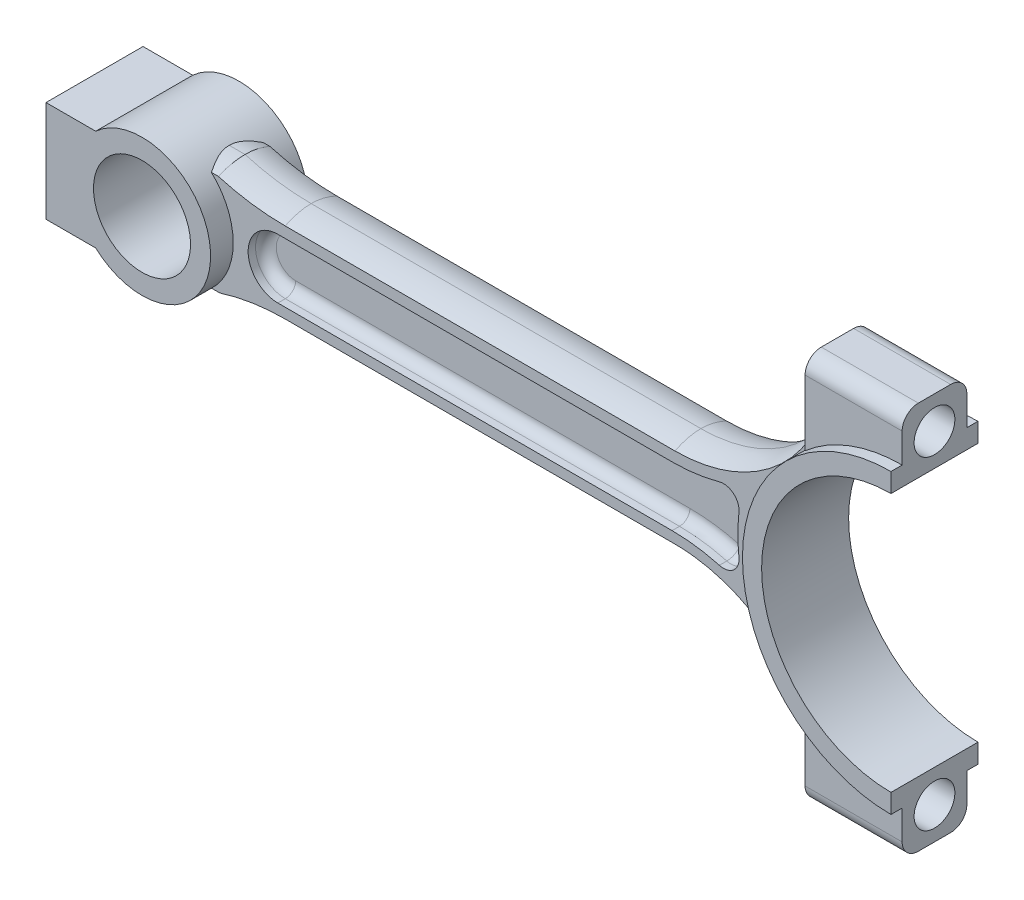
ISO-10303-21;
HEADER;
FILE_DESCRIPTION(('STEP AP214'),'2;1');
FILE_NAME('part.step','',(''),(''),'','','');
FILE_SCHEMA(('AUTOMOTIVE_DESIGN { 1 0 10303 214 1 1 1 1 }'));
ENDSEC;
DATA;
#1=APPLICATION_CONTEXT('core data for automotive mechanical design processes');
#2=APPLICATION_PROTOCOL_DEFINITION('international standard','automotive_design',2000,#1);
#3=PRODUCT_CONTEXT('',#1,'mechanical');
#4=PRODUCT('Part','Part','',(#3));
#5=PRODUCT_RELATED_PRODUCT_CATEGORY('part','',(#4));
#6=PRODUCT_DEFINITION_FORMATION('','',#4);
#7=PRODUCT_DEFINITION_CONTEXT('part definition',#1,'design');
#8=PRODUCT_DEFINITION('design','',#6,#7);
#9=PRODUCT_DEFINITION_SHAPE('','',#8);
#10=(LENGTH_UNIT() NAMED_UNIT(*) SI_UNIT(.MILLI.,.METRE.));
#11=(NAMED_UNIT(*) PLANE_ANGLE_UNIT() SI_UNIT($,.RADIAN.));
#12=(NAMED_UNIT(*) SI_UNIT($,.STERADIAN.) SOLID_ANGLE_UNIT());
#13=UNCERTAINTY_MEASURE_WITH_UNIT(LENGTH_MEASURE(1.E-05),#10,'distance_accuracy_value','');
#14=(GEOMETRIC_REPRESENTATION_CONTEXT(3) GLOBAL_UNCERTAINTY_ASSIGNED_CONTEXT((#13)) GLOBAL_UNIT_ASSIGNED_CONTEXT((#10,
#11,#12)) REPRESENTATION_CONTEXT('',''));
#15=CARTESIAN_POINT('',(0.,0.,0.));
#16=DIRECTION('',(0.,0.,1.));
#17=DIRECTION('',(1.,0.,0.));
#18=AXIS2_PLACEMENT_3D('',#15,#16,#17);
#19=CARTESIAN_POINT('',(-76.226829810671,-0.197736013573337,82.3316152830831));
#20=DIRECTION('',(0.,0.,-1.));
#21=DIRECTION('',(0.,1.,0.));
#22=AXIS2_PLACEMENT_3D('',#19,#20,#21);
#23=PLANE('',#22);
#24=CARTESIAN_POINT('',(-55.6523852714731,-4.35523283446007,82.3316152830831));
#25=DIRECTION('',(0.,0.,-1.));
#26=DIRECTION('',(1.,0.,0.));
#27=AXIS2_PLACEMENT_3D('',#24,#25,#26);
#28=CIRCLE('',#27,1.01600000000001);
#29=CARTESIAN_POINT('',(-54.6363852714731,-4.35523283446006,82.3316152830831));
#30=VERTEX_POINT('',#29);
#31=CARTESIAN_POINT('',(-55.9224625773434,-5.33467872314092,82.3316152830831));
#32=VERTEX_POINT('',#31);
#33=EDGE_CURVE('E585',#30,#32,#28,.T.);
#34=ORIENTED_EDGE('',*,*,#33,.F.);
#35=CARTESIAN_POINT('',(-55.6523852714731,-4.35523283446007,82.3316152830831));
#36=DIRECTION('',(0.,0.,-1.));
#37=DIRECTION('',(0.993510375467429,0.113741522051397,0.));
#38=AXIS2_PLACEMENT_3D('',#35,#36,#37);
#39=CIRCLE('',#38,1.016);
#40=CARTESIAN_POINT('',(-54.6429787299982,-4.23967144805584,82.3316152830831));
#41=VERTEX_POINT('',#40);
#42=EDGE_CURVE('E590',#41,#30,#39,.T.);
#43=ORIENTED_EDGE('',*,*,#42,.F.);
#44=CARTESIAN_POINT('',(-19.3137497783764,-0.195022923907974,82.3316152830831));
#45=DIRECTION('',(0.,0.,1.));
#46=DIRECTION('',(-1.,0.,0.));
#47=AXIS2_PLACEMENT_3D('',#44,#45,#46);
#48=CIRCLE('',#47,35.56);
#49=CARTESIAN_POINT('',(-54.8737497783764,-0.195022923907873,82.3316152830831));
#50=VERTEX_POINT('',#49);
#51=EDGE_CURVE('E572',#50,#41,#48,.T.);
#52=ORIENTED_EDGE('',*,*,#51,.F.);
#53=CARTESIAN_POINT('',(-19.3137497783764,-0.195022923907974,82.3316152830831));
#54=DIRECTION('',(0.,0.,1.));
#55=DIRECTION('',(-0.993543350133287,0.113453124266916,0.));
#56=AXIS2_PLACEMENT_3D('',#53,#54,#55);
#57=CIRCLE('',#56,35.56);
#58=CARTESIAN_POINT('',(-54.6441513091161,3.83937017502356,82.3316152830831));
#59=VERTEX_POINT('',#58);
#60=EDGE_CURVE('E584',#59,#50,#57,.T.);
#61=ORIENTED_EDGE('',*,*,#60,.F.);
#62=CARTESIAN_POINT('',(-55.6535913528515,3.95463854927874,82.3316152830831));
#63=DIRECTION('',(0.,0.,-1.));
#64=DIRECTION('',(1.,0.,0.));
#65=AXIS2_PLACEMENT_3D('',#62,#63,#64);
#66=CIRCLE('',#65,1.01599999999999);
#67=CARTESIAN_POINT('',(-54.6375913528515,3.95463854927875,82.3316152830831));
#68=VERTEX_POINT('',#67);
#69=EDGE_CURVE('E562',#68,#59,#66,.T.);
#70=ORIENTED_EDGE('',*,*,#69,.F.);
#71=CARTESIAN_POINT('',(-55.6535913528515,3.95463854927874,82.3316152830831));
#72=DIRECTION('',(0.,0.,-1.));
#73=DIRECTION('',(-0.264814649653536,0.964299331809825,0.));
#74=AXIS2_PLACEMENT_3D('',#71,#72,#73);
#75=CIRCLE('',#74,1.016);
#76=CARTESIAN_POINT('',(-55.9226430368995,4.93436667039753,82.3316152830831));
#77=VERTEX_POINT('',#76);
#78=EDGE_CURVE('E571',#77,#68,#75,.T.);
#79=ORIENTED_EDGE('',*,*,#78,.F.);
#80=CARTESIAN_POINT('',(-65.709398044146,40.571977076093,82.3316152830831));
#81=DIRECTION('',(0.,0.,1.));
#82=DIRECTION('',(0.,-1.,0.));
#83=AXIS2_PLACEMENT_3D('',#80,#81,#82);
#84=CIRCLE('',#83,36.957);
#85=CARTESIAN_POINT('',(-65.709398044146,3.61497707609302,82.3316152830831));
#86=VERTEX_POINT('',#85);
#87=EDGE_CURVE('E553',#86,#77,#84,.T.);
#88=ORIENTED_EDGE('',*,*,#87,.F.);
#89=DIRECTION('',(-1.,0.,0.));
#90=VECTOR('',#89,1.);
#91=CARTESIAN_POINT('',(-104.424073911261,3.61497707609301,82.3316152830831));
#92=LINE('',#91,#90);
#93=CARTESIAN_POINT('',(-143.138749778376,3.61497707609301,82.3316152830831));
#94=VERTEX_POINT('',#93);
#95=EDGE_CURVE('E594',#94,#86,#92,.F.);
#96=ORIENTED_EDGE('',*,*,#95,.F.);
#97=CARTESIAN_POINT('',(-143.138749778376,-0.195022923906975,82.3316152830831));
#98=DIRECTION('',(0.,0.,-1.));
#99=DIRECTION('',(-1.,0.,0.));
#100=AXIS2_PLACEMENT_3D('',#97,#98,#99);
#101=CIRCLE('',#100,3.80999999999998);
#102=CARTESIAN_POINT('',(-146.948749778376,-0.195022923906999,82.3316152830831));
#103=VERTEX_POINT('',#102);
#104=EDGE_CURVE('E534',#103,#94,#101,.T.);
#105=ORIENTED_EDGE('',*,*,#104,.F.);
#106=CARTESIAN_POINT('',(-143.138749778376,-0.195022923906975,82.3316152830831));
#107=DIRECTION('',(0.,0.,-1.));
#108=DIRECTION('',(0.,-1.,0.));
#109=AXIS2_PLACEMENT_3D('',#106,#107,#108);
#110=CIRCLE('',#109,3.81000000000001);
#111=CARTESIAN_POINT('',(-143.138749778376,-4.00502292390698,82.3316152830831));
#112=VERTEX_POINT('',#111);
#113=EDGE_CURVE('E270',#112,#103,#110,.T.);
#114=ORIENTED_EDGE('',*,*,#113,.F.);
#115=DIRECTION('',(1.,0.,0.));
#116=VECTOR('',#115,1.);
#117=CARTESIAN_POINT('',(-76.226829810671,-4.00502292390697,82.3316152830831));
#118=LINE('',#117,#116);
#119=CARTESIAN_POINT('',(-65.7465245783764,-4.00502292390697,82.3316152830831));
#120=VERTEX_POINT('',#119);
#121=EDGE_CURVE('E597',#120,#112,#118,.F.);
#122=ORIENTED_EDGE('',*,*,#121,.F.);
#123=CARTESIAN_POINT('',(-65.7465245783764,-40.962022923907,82.3316152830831));
#124=DIRECTION('',(0.,0.,1.));
#125=DIRECTION('',(0.265824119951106,0.964021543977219,0.));
#126=AXIS2_PLACEMENT_3D('',#123,#124,#125);
#127=CIRCLE('',#126,36.957);
#128=EDGE_CURVE('E591',#32,#120,#127,.T.);
#129=ORIENTED_EDGE('',*,*,#128,.F.);
#130=EDGE_LOOP('',(#34,#43,#52,#61,#70,#79,#88,#96,#105,#114,#122,#129));
#131=FACE_BOUND('',#130,.T.);
#132=ADVANCED_FACE('F31',(#131),#23,.F.);
#133=CARTESIAN_POINT('',(-143.138749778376,-4.00502292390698,84.3636152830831));
#134=DIRECTION('',(1.,0.,0.));
#135=DIRECTION('',(0.,0.,-1.));
#136=AXIS2_PLACEMENT_3D('',#133,#134,#135);
#137=CYLINDRICAL_SURFACE('',#136,2.032);
#138=DIRECTION('',(1.,0.,0.));
#139=VECTOR('',#138,1.);
#140=CARTESIAN_POINT('',(-143.138749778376,-6.03702292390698,84.3636152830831));
#141=LINE('',#140,#139);
#142=CARTESIAN_POINT('',(-143.138749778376,-6.03702292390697,84.3636152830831));
#143=VERTEX_POINT('',#142);
#144=CARTESIAN_POINT('',(-65.7465245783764,-6.03702292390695,84.3636152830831));
#145=VERTEX_POINT('',#144);
#146=EDGE_CURVE('E520',#143,#145,#141,.T.);
#147=ORIENTED_EDGE('',*,*,#146,.T.);
#148=CARTESIAN_POINT('',(-65.7465245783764,-4.00502292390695,84.3636152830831));
#149=DIRECTION('',(-1.,0.,0.));
#150=DIRECTION('',(0.,1.,0.));
#151=AXIS2_PLACEMENT_3D('',#148,#149,#150);
#152=CIRCLE('',#151,2.032);
#153=EDGE_CURVE('E588',#120,#145,#152,.T.);
#154=ORIENTED_EDGE('',*,*,#153,.F.);
#155=ORIENTED_EDGE('',*,*,#121,.T.);
#156=CARTESIAN_POINT('',(-143.138749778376,-4.00502292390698,84.3636152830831));
#157=DIRECTION('',(-1.,0.,0.));
#158=DIRECTION('',(0.,-1.,0.));
#159=AXIS2_PLACEMENT_3D('',#156,#157,#158);
#160=CIRCLE('',#159,2.032);
#161=EDGE_CURVE('E543',#143,#112,#160,.F.);
#162=ORIENTED_EDGE('',*,*,#161,.F.);
#163=EDGE_LOOP('',(#147,#154,#155,#162));
#164=FACE_BOUND('',#163,.T.);
#165=ADVANCED_FACE('F713',(#164),#137,.F.);
#166=CARTESIAN_POINT('',(-65.7465245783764,-40.962022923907,84.3636152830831));
#167=DIRECTION('',(0.,0.,-1.));
#168=DIRECTION('',(-1.,0.,0.));
#169=AXIS2_PLACEMENT_3D('',#166,#167,#168);
#170=TOROIDAL_SURFACE('',#169,36.957,2.032);
#171=CARTESIAN_POINT('',(-65.7465245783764,-40.962022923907,84.3636152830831));
#172=DIRECTION('',(0.,0.,1.));
#173=DIRECTION('',(0.265824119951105,0.964021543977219,0.));
#174=AXIS2_PLACEMENT_3D('',#171,#172,#173);
#175=CIRCLE('',#174,34.925);
#176=CARTESIAN_POINT('',(-56.462617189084,-7.29357050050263,84.3636152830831));
#177=VERTEX_POINT('',#176);
#178=EDGE_CURVE('E243',#145,#177,#175,.F.);
#179=ORIENTED_EDGE('',*,*,#178,.T.);
#180=CARTESIAN_POINT('',(-55.9224625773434,-5.33467872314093,84.3636152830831));
#181=DIRECTION('',(-0.964021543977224,0.265824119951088,0.));
#182=DIRECTION('',(-0.265824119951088,-0.964021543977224,0.));
#183=AXIS2_PLACEMENT_3D('',#180,#181,#182);
#184=CIRCLE('',#183,2.032);
#185=EDGE_CURVE('E582',#32,#177,#184,.T.);
#186=ORIENTED_EDGE('',*,*,#185,.F.);
#187=ORIENTED_EDGE('',*,*,#128,.T.);
#188=ORIENTED_EDGE('',*,*,#153,.T.);
#189=EDGE_LOOP('',(#179,#186,#187,#188));
#190=FACE_BOUND('',#189,.T.);
#191=ADVANCED_FACE('F650',(#190),#170,.F.);
#192=CARTESIAN_POINT('',(-54.6363852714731,-4.35523283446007,84.3636152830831));
#193=DIRECTION('',(0.,-1.,0.));
#194=DIRECTION('',(1.,0.,0.));
#195=AXIS2_PLACEMENT_3D('',#192,#193,#194);
#196=CIRCLE('',#195,2.032);
#197=TRIMMED_CURVE('',#196,(PARAMETER_VALUE(-2.0943951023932)),
(PARAMETER_VALUE(2.0943951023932)),.T.,.PARAMETER.);
#198=CARTESIAN_POINT('',(-55.6523852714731,-4.35523283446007,84.3636152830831));
#199=DIRECTION('',(0.,0.,1.));
#200=AXIS1_PLACEMENT('',#198,#199);
#201=SURFACE_OF_REVOLUTION('',#197,#200);
#202=ORIENTED_EDGE('',*,*,#185,.T.);
#203=CARTESIAN_POINT('',(-55.6523852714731,-4.35523283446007,84.3636152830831));
#204=DIRECTION('',(0.,0.,-1.));
#205=DIRECTION('',(0.993510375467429,0.113741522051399,0.));
#206=AXIS2_PLACEMENT_3D('',#203,#204,#205);
#207=CIRCLE('',#206,3.048);
#208=CARTESIAN_POINT('',(-52.6241656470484,-4.0085486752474,84.3636152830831));
#209=VERTEX_POINT('',#208);
#210=EDGE_CURVE('E239',#177,#209,#207,.F.);
#211=ORIENTED_EDGE('',*,*,#210,.T.);
#212=CARTESIAN_POINT('',(-54.6429787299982,-4.23967144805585,84.3636152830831));
#213=DIRECTION('',(0.113741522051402,-0.993510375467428,0.));
#214=DIRECTION('',(-0.993510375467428,-0.113741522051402,0.));
#215=AXIS2_PLACEMENT_3D('',#212,#213,#214);
#216=CIRCLE('',#215,2.032);
#217=EDGE_CURVE('E568',#41,#209,#216,.T.);
#218=ORIENTED_EDGE('',*,*,#217,.F.);
#219=ORIENTED_EDGE('',*,*,#42,.T.);
#220=ORIENTED_EDGE('',*,*,#33,.T.);
#221=EDGE_LOOP('',(#202,#211,#218,#219,#220));
#222=FACE_BOUND('',#221,.T.);
#223=ADVANCED_FACE('F646',(#222),#201,.F.);
#224=CARTESIAN_POINT('',(-19.3137497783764,-0.195022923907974,84.3636152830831));
#225=DIRECTION('',(0.,0.,-1.));
#226=DIRECTION('',(-1.,0.,0.));
#227=AXIS2_PLACEMENT_3D('',#224,#225,#226);
#228=TOROIDAL_SURFACE('',#227,35.56,2.032);
#229=ORIENTED_EDGE('',*,*,#217,.T.);
#230=CARTESIAN_POINT('',(-19.3137497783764,-0.195022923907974,84.3636152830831));
#231=DIRECTION('',(0.,0.,1.));
#232=DIRECTION('',(-0.993543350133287,0.113453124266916,0.));
#233=AXIS2_PLACEMENT_3D('',#230,#231,#232);
#234=CIRCLE('',#233,33.528);
#235=CARTESIAN_POINT('',(-52.6252712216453,3.60883342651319,84.3636152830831));
#236=VERTEX_POINT('',#235);
#237=EDGE_CURVE('E510',#209,#236,#234,.F.);
#238=ORIENTED_EDGE('',*,*,#237,.T.);
#239=CARTESIAN_POINT('',(-54.6441513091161,3.83937017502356,84.3636152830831));
#240=DIRECTION('',(-0.113453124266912,-0.993543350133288,0.));
#241=DIRECTION('',(0.993543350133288,-0.113453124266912,0.));
#242=AXIS2_PLACEMENT_3D('',#239,#240,#241);
#243=CIRCLE('',#242,2.032);
#244=EDGE_CURVE('E559',#59,#236,#243,.T.);
#245=ORIENTED_EDGE('',*,*,#244,.F.);
#246=ORIENTED_EDGE('',*,*,#60,.T.);
#247=ORIENTED_EDGE('',*,*,#51,.T.);
#248=EDGE_LOOP('',(#229,#238,#245,#246,#247));
#249=FACE_BOUND('',#248,.T.);
#250=ADVANCED_FACE('F633',(#249),#228,.F.);
#251=CARTESIAN_POINT('',(-54.6375913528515,3.95463854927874,84.3636152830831));
#252=DIRECTION('',(0.,-1.,0.));
#253=DIRECTION('',(1.,0.,0.));
#254=AXIS2_PLACEMENT_3D('',#251,#252,#253);
#255=CIRCLE('',#254,2.032);
#256=TRIMMED_CURVE('',#255,(PARAMETER_VALUE(-2.0943951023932)),
(PARAMETER_VALUE(2.0943951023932)),.T.,.PARAMETER.);
#257=CARTESIAN_POINT('',(-55.6535913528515,3.95463854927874,84.3636152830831));
#258=DIRECTION('',(0.,0.,1.));
#259=AXIS1_PLACEMENT('',#257,#258);
#260=SURFACE_OF_REVOLUTION('',#256,#259);
#261=ORIENTED_EDGE('',*,*,#244,.T.);
#262=CARTESIAN_POINT('',(-55.6535913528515,3.95463854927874,84.3636152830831));
#263=DIRECTION('',(0.,0.,-1.));
#264=DIRECTION('',(-0.264814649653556,0.96429933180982,0.));
#265=AXIS2_PLACEMENT_3D('',#262,#263,#264);
#266=CIRCLE('',#265,3.048);
#267=CARTESIAN_POINT('',(-56.4607464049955,6.89382291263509,84.3636152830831));
#268=VERTEX_POINT('',#267);
#269=EDGE_CURVE('E504',#236,#268,#266,.F.);
#270=ORIENTED_EDGE('',*,*,#269,.T.);
#271=CARTESIAN_POINT('',(-55.9226430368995,4.93436667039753,84.3636152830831));
#272=DIRECTION('',(0.964299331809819,0.264814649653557,0.));
#273=DIRECTION('',(0.264814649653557,-0.964299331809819,0.));
#274=AXIS2_PLACEMENT_3D('',#271,#272,#273);
#275=CIRCLE('',#274,2.032);
#276=EDGE_CURVE('E544',#77,#268,#275,.T.);
#277=ORIENTED_EDGE('',*,*,#276,.F.);
#278=ORIENTED_EDGE('',*,*,#78,.T.);
#279=ORIENTED_EDGE('',*,*,#69,.T.);
#280=EDGE_LOOP('',(#261,#270,#277,#278,#279));
#281=FACE_BOUND('',#280,.T.);
#282=ADVANCED_FACE('F629',(#281),#260,.F.);
#283=CARTESIAN_POINT('',(-65.709398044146,40.571977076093,84.3636152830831));
#284=DIRECTION('',(0.,0.,-1.));
#285=DIRECTION('',(-1.,0.,0.));
#286=AXIS2_PLACEMENT_3D('',#283,#284,#285);
#287=TOROIDAL_SURFACE('',#286,36.957,2.032);
#288=ORIENTED_EDGE('',*,*,#87,.T.);
#289=ORIENTED_EDGE('',*,*,#276,.T.);
#290=CARTESIAN_POINT('',(-65.709398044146,40.571977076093,84.3636152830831));
#291=DIRECTION('',(0.,0.,1.));
#292=DIRECTION('',(0.,-1.,0.));
#293=AXIS2_PLACEMENT_3D('',#290,#291,#292);
#294=CIRCLE('',#293,34.925);
#295=CARTESIAN_POINT('',(-65.709398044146,5.64697707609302,84.3636152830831));
#296=VERTEX_POINT('',#295);
#297=EDGE_CURVE('E498',#268,#296,#294,.F.);
#298=ORIENTED_EDGE('',*,*,#297,.T.);
#299=CARTESIAN_POINT('',(-65.709398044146,3.61497707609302,84.3636152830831));
#300=DIRECTION('',(1.,0.,0.));
#301=DIRECTION('',(0.,0.707106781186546,-0.70710678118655));
#302=AXIS2_PLACEMENT_3D('',#299,#300,#301);
#303=CIRCLE('',#302,2.03199999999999);
#304=EDGE_CURVE('E541',#86,#296,#303,.T.);
#305=ORIENTED_EDGE('',*,*,#304,.F.);
#306=EDGE_LOOP('',(#288,#289,#298,#305));
#307=FACE_BOUND('',#306,.T.);
#308=ADVANCED_FACE('F620',(#307),#287,.F.);
#309=CARTESIAN_POINT('',(-65.709398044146,3.61497707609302,84.3636152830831));
#310=DIRECTION('',(-1.,0.,0.));
#311=DIRECTION('',(0.,0.,1.));
#312=AXIS2_PLACEMENT_3D('',#309,#310,#311);
#313=CYLINDRICAL_SURFACE('',#312,2.03199999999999);
#314=DIRECTION('',(1.,0.,0.));
#315=VECTOR('',#314,1.);
#316=CARTESIAN_POINT('',(-65.709398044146,5.64697707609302,84.3636152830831));
#317=LINE('',#316,#315);
#318=CARTESIAN_POINT('',(-143.138749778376,5.64697707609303,84.3636152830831));
#319=VERTEX_POINT('',#318);
#320=EDGE_CURVE('E487',#296,#319,#317,.F.);
#321=ORIENTED_EDGE('',*,*,#320,.T.);
#322=CARTESIAN_POINT('',(-143.138749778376,3.61497707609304,84.3636152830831));
#323=DIRECTION('',(1.,0.,0.));
#324=DIRECTION('',(0.,1.,0.));
#325=AXIS2_PLACEMENT_3D('',#322,#323,#324);
#326=CIRCLE('',#325,2.032);
#327=EDGE_CURVE('E532',#94,#319,#326,.T.);
#328=ORIENTED_EDGE('',*,*,#327,.F.);
#329=ORIENTED_EDGE('',*,*,#95,.T.);
#330=ORIENTED_EDGE('',*,*,#304,.T.);
#331=EDGE_LOOP('',(#321,#328,#329,#330));
#332=FACE_BOUND('',#331,.T.);
#333=ADVANCED_FACE('F289',(#332),#313,.F.);
#334=CARTESIAN_POINT('',(-143.138749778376,-0.195022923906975,84.3636152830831));
#335=DIRECTION('',(0.,0.,1.));
#336=DIRECTION('',(1.,0.,0.));
#337=AXIS2_PLACEMENT_3D('',#334,#335,#336);
#338=TOROIDAL_SURFACE('',#337,3.81000000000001,2.032);
#339=ORIENTED_EDGE('',*,*,#327,.T.);
#340=CARTESIAN_POINT('',(-143.138749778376,-0.195022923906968,84.3636152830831));
#341=DIRECTION('',(0.,0.,-1.));
#342=DIRECTION('',(0.,-1.,0.));
#343=AXIS2_PLACEMENT_3D('',#340,#341,#342);
#344=CIRCLE('',#343,5.842);
#345=EDGE_CURVE('E492',#319,#143,#344,.F.);
#346=ORIENTED_EDGE('',*,*,#345,.T.);
#347=ORIENTED_EDGE('',*,*,#161,.T.);
#348=ORIENTED_EDGE('',*,*,#113,.T.);
#349=ORIENTED_EDGE('',*,*,#104,.T.);
#350=EDGE_LOOP('',(#339,#346,#347,#348,#349));
#351=FACE_BOUND('',#350,.T.);
#352=ADVANCED_FACE('F277',(#351),#338,.F.);
#353=CARTESIAN_POINT('',(-143.138749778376,-6.03702292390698,88.6816152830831));
#354=DIRECTION('',(0.,-1.,0.));
#355=DIRECTION('',(1.,0.,0.));
#356=AXIS2_PLACEMENT_3D('',#353,#354,#355);
#357=PLANE('',#356);
#358=DIRECTION('',(0.,0.,-1.));
#359=VECTOR('',#358,1.);
#360=CARTESIAN_POINT('',(-143.138749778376,-6.03702292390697,88.6816152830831));
#361=LINE('',#360,#359);
#362=CARTESIAN_POINT('',(-143.138749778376,-6.03702292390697,85.8241152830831));
#363=VERTEX_POINT('',#362);
#364=EDGE_CURVE('E483',#143,#363,#361,.F.);
#365=ORIENTED_EDGE('',*,*,#364,.T.);
#366=DIRECTION('',(-1.,0.,0.));
#367=VECTOR('',#366,1.);
#368=CARTESIAN_POINT('',(-165.910408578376,-6.03702292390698,85.8241152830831));
#369=LINE('',#368,#367);
#370=CARTESIAN_POINT('',(-65.7465245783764,-6.03702292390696,85.8241152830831));
#371=VERTEX_POINT('',#370);
#372=EDGE_CURVE('E260',#363,#371,#369,.F.);
#373=ORIENTED_EDGE('',*,*,#372,.T.);
#374=DIRECTION('',(0.,0.,-1.));
#375=VECTOR('',#374,1.);
#376=CARTESIAN_POINT('',(-65.7465245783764,-6.03702292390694,88.6816152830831));
#377=LINE('',#376,#375);
#378=EDGE_CURVE('E259',#371,#145,#377,.T.);
#379=ORIENTED_EDGE('',*,*,#378,.T.);
#380=ORIENTED_EDGE('',*,*,#146,.F.);
#381=EDGE_LOOP('',(#365,#373,#379,#380));
#382=FACE_BOUND('',#381,.T.);
#383=ADVANCED_FACE('F288',(#382),#357,.F.);
#384=CARTESIAN_POINT('',(-65.7465245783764,-40.962022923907,85.8241152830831));
#385=DIRECTION('',(0.,0.,-1.));
#386=DIRECTION('',(-1.,0.,0.));
#387=AXIS2_PLACEMENT_3D('',#384,#385,#386);
#388=CYLINDRICAL_SURFACE('',#387,34.925);
#389=ORIENTED_EDGE('',*,*,#378,.F.);
#390=CARTESIAN_POINT('',(-65.7465245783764,-40.962022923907,85.8241152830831));
#391=DIRECTION('',(0.,0.,-1.));
#392=DIRECTION('',(-1.,0.,0.));
#393=AXIS2_PLACEMENT_3D('',#390,#391,#392);
#394=CIRCLE('',#393,34.925);
#395=CARTESIAN_POINT('',(-56.4626171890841,-7.29357050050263,85.8241152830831));
#396=VERTEX_POINT('',#395);
#397=EDGE_CURVE('E251',#371,#396,#394,.T.);
#398=ORIENTED_EDGE('',*,*,#397,.T.);
#399=DIRECTION('',(0.,0.,-1.));
#400=VECTOR('',#399,1.);
#401=CARTESIAN_POINT('',(-56.462617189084,-7.29357050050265,88.6816152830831));
#402=LINE('',#401,#400);
#403=EDGE_CURVE('E234',#396,#177,#402,.T.);
#404=ORIENTED_EDGE('',*,*,#403,.T.);
#405=ORIENTED_EDGE('',*,*,#178,.F.);
#406=EDGE_LOOP('',(#389,#398,#404,#405));
#407=FACE_BOUND('',#406,.T.);
#408=ADVANCED_FACE('F257',(#407),#388,.T.);
#409=CARTESIAN_POINT('',(-55.6523852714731,-4.35523283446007,85.8241152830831));
#410=DIRECTION('',(0.,0.,-1.));
#411=DIRECTION('',(-1.,0.,0.));
#412=AXIS2_PLACEMENT_3D('',#409,#410,#411);
#413=CYLINDRICAL_SURFACE('',#412,3.048);
#414=ORIENTED_EDGE('',*,*,#403,.F.);
#415=CARTESIAN_POINT('',(-55.6523852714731,-4.35523283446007,85.8241152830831));
#416=DIRECTION('',(0.,0.,-1.));
#417=DIRECTION('',(-1.,0.,0.));
#418=AXIS2_PLACEMENT_3D('',#415,#416,#417);
#419=CIRCLE('',#418,3.048);
#420=CARTESIAN_POINT('',(-52.6241656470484,-4.0085486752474,85.8241152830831));
#421=VERTEX_POINT('',#420);
#422=EDGE_CURVE('E238',#396,#421,#419,.F.);
#423=ORIENTED_EDGE('',*,*,#422,.T.);
#424=DIRECTION('',(0.,0.,-1.));
#425=VECTOR('',#424,1.);
#426=CARTESIAN_POINT('',(-52.6241656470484,-4.0085486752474,88.6816152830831));
#427=LINE('',#426,#425);
#428=EDGE_CURVE('E513',#421,#209,#427,.T.);
#429=ORIENTED_EDGE('',*,*,#428,.T.);
#430=ORIENTED_EDGE('',*,*,#210,.F.);
#431=EDGE_LOOP('',(#414,#423,#429,#430));
#432=FACE_BOUND('',#431,.T.);
#433=ADVANCED_FACE('F236',(#432),#413,.F.);
#434=CARTESIAN_POINT('',(-19.3137497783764,-0.195022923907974,85.8241152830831));
#435=DIRECTION('',(0.,0.,-1.));
#436=DIRECTION('',(-1.,0.,0.));
#437=AXIS2_PLACEMENT_3D('',#434,#435,#436);
#438=CYLINDRICAL_SURFACE('',#437,33.528);
#439=ORIENTED_EDGE('',*,*,#428,.F.);
#440=CARTESIAN_POINT('',(-19.3137497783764,-0.195022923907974,85.8241152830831));
#441=DIRECTION('',(0.,0.,-1.));
#442=DIRECTION('',(-1.,0.,0.));
#443=AXIS2_PLACEMENT_3D('',#440,#441,#442);
#444=CIRCLE('',#443,33.528);
#445=CARTESIAN_POINT('',(-52.6252712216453,3.60883342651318,85.8241152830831));
#446=VERTEX_POINT('',#445);
#447=EDGE_CURVE('E255',#421,#446,#444,.T.);
#448=ORIENTED_EDGE('',*,*,#447,.T.);
#449=DIRECTION('',(0.,0.,-1.));
#450=VECTOR('',#449,1.);
#451=CARTESIAN_POINT('',(-52.6252712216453,3.60883342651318,88.6816152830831));
#452=LINE('',#451,#450);
#453=EDGE_CURVE('E507',#446,#236,#452,.T.);
#454=ORIENTED_EDGE('',*,*,#453,.T.);
#455=ORIENTED_EDGE('',*,*,#237,.F.);
#456=EDGE_LOOP('',(#439,#448,#454,#455));
#457=FACE_BOUND('',#456,.T.);
#458=ADVANCED_FACE('F793',(#457),#438,.T.);
#459=CARTESIAN_POINT('',(-55.6535913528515,3.95463854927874,85.8241152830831));
#460=DIRECTION('',(0.,0.,-1.));
#461=DIRECTION('',(-1.,0.,0.));
#462=AXIS2_PLACEMENT_3D('',#459,#460,#461);
#463=CYLINDRICAL_SURFACE('',#462,3.048);
#464=ORIENTED_EDGE('',*,*,#453,.F.);
#465=CARTESIAN_POINT('',(-55.6535913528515,3.95463854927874,85.8241152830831));
#466=DIRECTION('',(0.,0.,-1.));
#467=DIRECTION('',(-1.,0.,0.));
#468=AXIS2_PLACEMENT_3D('',#465,#466,#467);
#469=CIRCLE('',#468,3.048);
#470=CARTESIAN_POINT('',(-56.4607464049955,6.89382291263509,85.8241152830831));
#471=VERTEX_POINT('',#470);
#472=EDGE_CURVE('E798',#446,#471,#469,.F.);
#473=ORIENTED_EDGE('',*,*,#472,.T.);
#474=DIRECTION('',(0.,0.,-1.));
#475=VECTOR('',#474,1.);
#476=CARTESIAN_POINT('',(-56.4607464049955,6.89382291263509,88.6816152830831));
#477=LINE('',#476,#475);
#478=EDGE_CURVE('E501',#471,#268,#477,.T.);
#479=ORIENTED_EDGE('',*,*,#478,.T.);
#480=ORIENTED_EDGE('',*,*,#269,.F.);
#481=EDGE_LOOP('',(#464,#473,#479,#480));
#482=FACE_BOUND('',#481,.T.);
#483=ADVANCED_FACE('F797',(#482),#463,.F.);
#484=CARTESIAN_POINT('',(-65.709398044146,40.571977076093,85.8241152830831));
#485=DIRECTION('',(0.,0.,-1.));
#486=DIRECTION('',(-1.,0.,0.));
#487=AXIS2_PLACEMENT_3D('',#484,#485,#486);
#488=CYLINDRICAL_SURFACE('',#487,34.925);
#489=ORIENTED_EDGE('',*,*,#478,.F.);
#490=CARTESIAN_POINT('',(-65.709398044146,40.571977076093,85.8241152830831));
#491=DIRECTION('',(0.,0.,-1.));
#492=DIRECTION('',(-1.,0.,0.));
#493=AXIS2_PLACEMENT_3D('',#490,#491,#492);
#494=CIRCLE('',#493,34.925);
#495=CARTESIAN_POINT('',(-65.709398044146,5.64697707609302,85.8241152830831));
#496=VERTEX_POINT('',#495);
#497=EDGE_CURVE('E302',#471,#496,#494,.T.);
#498=ORIENTED_EDGE('',*,*,#497,.T.);
#499=DIRECTION('',(0.,0.,1.));
#500=VECTOR('',#499,1.);
#501=CARTESIAN_POINT('',(-65.709398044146,5.64697707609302,88.6816152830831));
#502=LINE('',#501,#500);
#503=EDGE_CURVE('E495',#496,#296,#502,.F.);
#504=ORIENTED_EDGE('',*,*,#503,.T.);
#505=ORIENTED_EDGE('',*,*,#297,.F.);
#506=EDGE_LOOP('',(#489,#498,#504,#505));
#507=FACE_BOUND('',#506,.T.);
#508=ADVANCED_FACE('F1627',(#507),#488,.T.);
#509=CARTESIAN_POINT('',(-65.709398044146,5.64697707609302,88.6816152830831));
#510=DIRECTION('',(0.,1.,0.));
#511=DIRECTION('',(0.,0.,1.));
#512=AXIS2_PLACEMENT_3D('',#509,#510,#511);
#513=PLANE('',#512);
#514=ORIENTED_EDGE('',*,*,#503,.F.);
#515=DIRECTION('',(-1.,0.,0.));
#516=VECTOR('',#515,1.);
#517=CARTESIAN_POINT('',(-165.910408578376,5.64697707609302,85.8241152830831));
#518=LINE('',#517,#516);
#519=CARTESIAN_POINT('',(-143.138749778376,5.64697707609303,85.8241152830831));
#520=VERTEX_POINT('',#519);
#521=EDGE_CURVE('E299',#496,#520,#518,.T.);
#522=ORIENTED_EDGE('',*,*,#521,.T.);
#523=DIRECTION('',(0.,0.,-1.));
#524=VECTOR('',#523,1.);
#525=CARTESIAN_POINT('',(-143.138749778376,5.64697707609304,88.6816152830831));
#526=LINE('',#525,#524);
#527=EDGE_CURVE('E486',#520,#319,#526,.T.);
#528=ORIENTED_EDGE('',*,*,#527,.T.);
#529=ORIENTED_EDGE('',*,*,#320,.F.);
#530=EDGE_LOOP('',(#514,#522,#528,#529));
#531=FACE_BOUND('',#530,.T.);
#532=ADVANCED_FACE('F1624',(#531),#513,.F.);
#533=CARTESIAN_POINT('',(-143.138749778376,-0.195022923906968,85.8241152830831));
#534=DIRECTION('',(0.,0.,-1.));
#535=DIRECTION('',(-1.,0.,0.));
#536=AXIS2_PLACEMENT_3D('',#533,#534,#535);
#537=CYLINDRICAL_SURFACE('',#536,5.842);
#538=ORIENTED_EDGE('',*,*,#527,.F.);
#539=CARTESIAN_POINT('',(-143.138749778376,-0.195022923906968,85.8241152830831));
#540=DIRECTION('',(0.,0.,-1.));
#541=DIRECTION('',(-1.,0.,0.));
#542=AXIS2_PLACEMENT_3D('',#539,#540,#541);
#543=CIRCLE('',#542,5.842);
#544=EDGE_CURVE('E301',#520,#363,#543,.F.);
#545=ORIENTED_EDGE('',*,*,#544,.T.);
#546=ORIENTED_EDGE('',*,*,#364,.F.);
#547=ORIENTED_EDGE('',*,*,#345,.F.);
#548=EDGE_LOOP('',(#538,#545,#546,#547));
#549=FACE_BOUND('',#548,.T.);
#550=ADVANCED_FACE('F1621',(#549),#537,.F.);
#551=CARTESIAN_POINT('',(-19.3137497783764,37.904977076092,77.5691152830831));
#552=DIRECTION('',(0.,1.,0.));
#553=DIRECTION('',(0.,0.,1.));
#554=AXIS2_PLACEMENT_3D('',#551,#552,#553);
#555=PLANE('',#554);
#556=DIRECTION('',(-1.,0.,0.));
#557=VECTOR('',#556,1.);
#558=CARTESIAN_POINT('',(-19.3137497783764,37.904977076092,83.9191152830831));
#559=LINE('',#558,#557);
#560=CARTESIAN_POINT('',(-19.3137497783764,37.904977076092,83.9191152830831));
#561=VERTEX_POINT('',#560);
#562=CARTESIAN_POINT('',(-38.3637497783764,37.904977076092,83.9191152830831));
#563=VERTEX_POINT('',#562);
#564=EDGE_CURVE('E529',#561,#563,#559,.T.);
#565=ORIENTED_EDGE('',*,*,#564,.F.);
#566=DIRECTION('',(0.,0.,1.));
#567=VECTOR('',#566,1.);
#568=CARTESIAN_POINT('',(-19.3137497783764,37.904977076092,80.7441152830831));
#569=LINE('',#568,#567);
#570=CARTESIAN_POINT('',(-19.3137497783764,37.904977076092,77.5691152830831));
#571=VERTEX_POINT('',#570);
#572=EDGE_CURVE('E315',#561,#571,#569,.F.);
#573=ORIENTED_EDGE('',*,*,#572,.T.);
#574=DIRECTION('',(-1.,0.,0.));
#575=VECTOR('',#574,1.);
#576=CARTESIAN_POINT('',(-19.3137497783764,37.904977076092,77.5691152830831));
#577=LINE('',#576,#575);
#578=CARTESIAN_POINT('',(-38.3637497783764,37.904977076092,77.5691152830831));
#579=VERTEX_POINT('',#578);
#580=EDGE_CURVE('E1004',#571,#579,#577,.T.);
#581=ORIENTED_EDGE('',*,*,#580,.T.);
#582=DIRECTION('',(0.,0.,-1.));
#583=VECTOR('',#582,1.);
#584=CARTESIAN_POINT('',(-38.3637497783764,37.904977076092,80.7441152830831));
#585=LINE('',#584,#583);
#586=EDGE_CURVE('E318',#579,#563,#585,.F.);
#587=ORIENTED_EDGE('',*,*,#586,.T.);
#588=EDGE_LOOP('',(#565,#573,#581,#587));
#589=FACE_BOUND('',#588,.T.);
#590=ADVANCED_FACE('F1351',(#589),#555,.T.);
#591=CARTESIAN_POINT('',(-19.3137497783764,34.729977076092,83.9191152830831));
#592=DIRECTION('',(-1.,0.,0.));
#593=DIRECTION('',(0.,0.,1.));
#594=AXIS2_PLACEMENT_3D('',#591,#592,#593);
#595=CYLINDRICAL_SURFACE('',#594,3.175);
#596=CARTESIAN_POINT('',(-19.3137497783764,34.729977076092,83.9191152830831));
#597=DIRECTION('',(-1.,0.,0.));
#598=DIRECTION('',(0.,0.,1.));
#599=AXIS2_PLACEMENT_3D('',#596,#597,#598);
#600=CIRCLE('',#599,3.175);
#601=CARTESIAN_POINT('',(-19.3137497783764,34.729977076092,87.0941152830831));
#602=VERTEX_POINT('',#601);
#603=EDGE_CURVE('E319',#602,#561,#600,.T.);
#604=ORIENTED_EDGE('',*,*,#603,.T.);
#605=ORIENTED_EDGE('',*,*,#564,.T.);
#606=CARTESIAN_POINT('',(-38.3637497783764,34.729977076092,83.9191152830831));
#607=DIRECTION('',(-1.,0.,0.));
#608=DIRECTION('',(0.,0.,1.));
#609=AXIS2_PLACEMENT_3D('',#606,#607,#608);
#610=CIRCLE('',#609,3.175);
#611=CARTESIAN_POINT('',(-38.3637497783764,34.729977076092,87.0941152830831));
#612=VERTEX_POINT('',#611);
#613=EDGE_CURVE('E334',#563,#612,#610,.F.);
#614=ORIENTED_EDGE('',*,*,#613,.T.);
#615=DIRECTION('',(1.,0.,0.));
#616=VECTOR('',#615,1.);
#617=CARTESIAN_POINT('',(-19.3137497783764,34.729977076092,87.0941152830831));
#618=LINE('',#617,#616);
#619=EDGE_CURVE('E262',#602,#612,#618,.F.);
#620=ORIENTED_EDGE('',*,*,#619,.F.);
#621=EDGE_LOOP('',(#604,#605,#614,#620));
#622=FACE_BOUND('',#621,.T.);
#623=ADVANCED_FACE('F1736',(#622),#595,.T.);
#624=CARTESIAN_POINT('',(-19.3137497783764,34.729977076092,87.0941152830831));
#625=DIRECTION('',(0.,0.,1.));
#626=DIRECTION('',(1.,0.,0.));
#627=AXIS2_PLACEMENT_3D('',#624,#625,#626);
#628=PLANE('',#627);
#629=ORIENTED_EDGE('',*,*,#619,.T.);
#630=DIRECTION('',(0.,1.,0.));
#631=VECTOR('',#630,1.);
#632=CARTESIAN_POINT('',(-38.3637497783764,-0.195022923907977,87.0941152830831));
#633=LINE('',#632,#631);
#634=CARTESIAN_POINT('',(-38.3637497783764,21.8811281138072,87.0941152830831));
#635=VERTEX_POINT('',#634);
#636=EDGE_CURVE('E331',#612,#635,#633,.F.);
#637=ORIENTED_EDGE('',*,*,#636,.T.);
#638=CARTESIAN_POINT('',(-19.3137497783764,-0.195022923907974,87.0941152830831));
#639=DIRECTION('',(0.,0.,-1.));
#640=DIRECTION('',(-1.,0.,0.));
#641=AXIS2_PLACEMENT_3D('',#638,#639,#640);
#642=CIRCLE('',#641,29.1592000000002);
#643=CARTESIAN_POINT('',(-19.3137497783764,28.9641770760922,87.0941152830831));
#644=VERTEX_POINT('',#643);
#645=EDGE_CURVE('E806',#644,#635,#642,.F.);
#646=ORIENTED_EDGE('',*,*,#645,.F.);
#647=DIRECTION('',(0.,1.,0.));
#648=VECTOR('',#647,1.);
#649=CARTESIAN_POINT('',(-19.3137497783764,-0.195022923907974,87.0941152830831));
#650=LINE('',#649,#648);
#651=EDGE_CURVE('E322',#644,#602,#650,.T.);
#652=ORIENTED_EDGE('',*,*,#651,.T.);
#653=EDGE_LOOP('',(#629,#637,#646,#652));
#654=FACE_BOUND('',#653,.T.);
#655=ADVANCED_FACE('F883',(#654),#628,.T.);
#656=CARTESIAN_POINT('',(-165.910408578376,-10.037535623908,85.8241152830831));
#657=DIRECTION('',(0.,0.,-1.));
#658=DIRECTION('',(-1.,0.,0.));
#659=AXIS2_PLACEMENT_3D('',#656,#657,#658);
#660=PLANE('',#659);
#661=ORIENTED_EDGE('',*,*,#521,.F.);
#662=ORIENTED_EDGE('',*,*,#497,.F.);
#663=ORIENTED_EDGE('',*,*,#472,.F.);
#664=ORIENTED_EDGE('',*,*,#447,.F.);
#665=ORIENTED_EDGE('',*,*,#422,.F.);
#666=ORIENTED_EDGE('',*,*,#397,.F.);
#667=ORIENTED_EDGE('',*,*,#372,.F.);
#668=ORIENTED_EDGE('',*,*,#544,.F.);
#669=EDGE_LOOP('',(#661,#662,#663,#664,#665,#666,#667,#668));
#670=FACE_BOUND('',#669,.T.);
#671=DIRECTION('',(0.,1.,0.));
#672=VECTOR('',#671,1.);
#673=CARTESIAN_POINT('',(-38.3637497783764,-0.195022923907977,85.8241152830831));
#674=LINE('',#673,#672);
#675=CARTESIAN_POINT('',(-38.3637497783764,21.8811281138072,85.8241152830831));
#676=VERTEX_POINT('',#675);
#677=CARTESIAN_POINT('',(-38.3637497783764,23.617464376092,85.8241152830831));
#678=VERTEX_POINT('',#677);
#679=EDGE_CURVE('E326',#676,#678,#674,.T.);
#680=ORIENTED_EDGE('',*,*,#679,.T.);
#681=DIRECTION('',(1.,0.,0.));
#682=VECTOR('',#681,1.);
#683=CARTESIAN_POINT('',(-38.0570064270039,23.617464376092,85.8241152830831));
#684=LINE('',#683,#682);
#685=CARTESIAN_POINT('',(-38.4487033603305,23.617464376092,85.8241152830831));
#686=VERTEX_POINT('',#685);
#687=EDGE_CURVE('E329',#686,#678,#684,.T.);
#688=ORIENTED_EDGE('',*,*,#687,.F.);
#689=CARTESIAN_POINT('',(-65.180034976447,7.78224073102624,85.8241152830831));
#690=CARTESIAN_POINT('',(-64.6084059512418,7.78222269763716,85.8241152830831));
#691=CARTESIAN_POINT('',(-64.0367797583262,7.79832073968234,85.8241152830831));
#692=CARTESIAN_POINT('',(-62.8953615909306,7.86261708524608,85.8241152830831));
#693=CARTESIAN_POINT('',(-62.325569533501,7.91081391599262,85.8241152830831));
#694=CARTESIAN_POINT('',(-61.1896044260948,8.03917495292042,85.8241152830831));
#695=CARTESIAN_POINT('',(-60.6234313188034,8.11933865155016,85.8241152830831));
#696=CARTESIAN_POINT('',(-59.4971198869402,8.31126456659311,85.8241152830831));
#697=CARTESIAN_POINT('',(-58.9369755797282,8.42299173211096,85.8241152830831));
#698=CARTESIAN_POINT('',(-57.8238231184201,8.67773997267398,85.8241152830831));
#699=CARTESIAN_POINT('',(-57.2708148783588,8.82076067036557,85.8241152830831));
#700=CARTESIAN_POINT('',(-56.4480714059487,9.05838869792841,85.8241152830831));
#701=CARTESIAN_POINT('',(-56.1749541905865,9.14144667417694,85.8241152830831));
#702=CARTESIAN_POINT('',(-55.6311077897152,9.31521629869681,85.8241152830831));
#703=CARTESIAN_POINT('',(-55.3603791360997,9.40592960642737,85.8241152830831));
#704=CARTESIAN_POINT('',(-54.2827224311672,9.78395530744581,85.8241152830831));
#705=CARTESIAN_POINT('',(-53.4862008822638,10.1016458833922,85.8241152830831));
#706=CARTESIAN_POINT('',(-51.9226687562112,10.8030429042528,85.8241152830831));
#707=CARTESIAN_POINT('',(-51.1556626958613,11.1867594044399,85.8241152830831));
#708=CARTESIAN_POINT('',(-50.0313980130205,11.8097571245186,85.8241152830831));
#709=CARTESIAN_POINT('',(-49.6608841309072,12.0254159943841,85.8241152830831));
#710=CARTESIAN_POINT('',(-48.9293899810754,12.4720989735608,85.8241152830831));
#711=CARTESIAN_POINT('',(-48.5684063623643,12.7031175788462,85.8241152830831));
#712=CARTESIAN_POINT('',(-47.8565131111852,13.1801624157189,85.8241152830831));
#713=CARTESIAN_POINT('',(-47.5056031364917,13.4261881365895,85.8241152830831));
#714=CARTESIAN_POINT('',(-46.8143674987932,13.9328831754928,85.8241152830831));
#715=CARTESIAN_POINT('',(-46.4740454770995,14.1935574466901,85.8241152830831));
#716=CARTESIAN_POINT('',(-45.4696195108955,14.9971027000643,85.8241152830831));
#717=CARTESIAN_POINT('',(-44.8223719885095,15.5612841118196,85.8241152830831));
#718=CARTESIAN_POINT('',(-43.5777985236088,16.7422167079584,85.8241152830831));
#719=CARTESIAN_POINT('',(-42.9804708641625,17.358966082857,85.8241152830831));
#720=CARTESIAN_POINT('',(-42.1256430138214,18.3195464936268,85.8241152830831));
#721=CARTESIAN_POINT('',(-41.8477344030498,18.645417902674,85.8241152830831));
#722=CARTESIAN_POINT('',(-41.3059335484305,19.3085287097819,85.8241152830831));
#723=CARTESIAN_POINT('',(-41.0420382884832,19.6457656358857,85.8241152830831));
#724=CARTESIAN_POINT('',(-40.5288135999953,20.3308902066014,85.8241152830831));
#725=CARTESIAN_POINT('',(-40.2794774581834,20.6787728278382,85.8241152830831));
#726=CARTESIAN_POINT('',(-39.7956828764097,21.3847153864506,85.8241152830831));
#727=CARTESIAN_POINT('',(-39.5612235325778,21.7427747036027,85.8241152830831));
#728=CARTESIAN_POINT('',(-39.1794999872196,22.3534094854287,85.8241152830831));
#729=CARTESIAN_POINT('',(-39.0281545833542,22.6034441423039,85.8241152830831));
#730=CARTESIAN_POINT('',(-38.7328877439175,23.1074698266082,85.8241152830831));
#731=CARTESIAN_POINT('',(-38.5889579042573,23.3614559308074,85.8241152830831));
#732=CARTESIAN_POINT('',(-38.4487033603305,23.617464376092,85.8241152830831));
#733=B_SPLINE_CURVE_WITH_KNOTS('',3,(#689,#690,#691,#692,#693,#694,#695,#696,#697,#698,#699,
#700,#701,#702,#703,#704,#705,#706,#707,#708,#709,#710,#711,#712,#713,#714,#715,#716,#717,#718,
#719,#720,#721,#722,#723,#724,#725,#726,#727,#728,#729,#730,#731,#732),.UNSPECIFIED.,.F.,.F.,(4,
2,2,2,2,2,2,2,2,2,2,2,2,2,2,2,2,2,2,2,2,4),(0.,1.71465580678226,3.42923294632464,
5.14378286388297,6.85643622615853,8.56906893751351,9.4253696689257,10.2818565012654,
12.8511457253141,15.4208265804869,16.7066248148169,17.9919647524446,19.277260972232,
20.5629944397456,23.1356000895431,25.7081172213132,26.9926461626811,28.2768975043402,
29.5605519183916,30.8441282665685,31.7208302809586,32.5965158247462),.UNSPECIFIED.);
#734=CARTESIAN_POINT('',(-65.180034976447,7.78224073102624,85.8241152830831));
#735=VERTEX_POINT('',#734);
#736=EDGE_CURVE('E454',#735,#686,#733,.T.);
#737=ORIENTED_EDGE('',*,*,#736,.F.);
#738=DIRECTION('',(1.,0.,0.));
#739=VECTOR('',#738,1.);
#740=CARTESIAN_POINT('',(-103.434482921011,7.78224073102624,85.8241152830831));
#741=LINE('',#740,#739);
#742=CARTESIAN_POINT('',(-141.688930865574,7.78224073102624,85.8241152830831));
#743=VERTEX_POINT('',#742);
#744=EDGE_CURVE('E445',#743,#735,#741,.T.);
#745=ORIENTED_EDGE('',*,*,#744,.F.);
#746=CARTESIAN_POINT('',(-154.845576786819,9.64746437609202,85.8241152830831));
#747=CARTESIAN_POINT('',(-154.387000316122,9.51477324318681,85.8241152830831));
#748=CARTESIAN_POINT('',(-153.926452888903,9.38902898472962,85.8241152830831));
#749=CARTESIAN_POINT('',(-153.001747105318,9.15152331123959,85.8241152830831));
#750=CARTESIAN_POINT('',(-152.537588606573,9.0397624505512,85.8241152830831));
#751=CARTESIAN_POINT('',(-151.140673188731,8.72569921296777,85.8241152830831));
#752=CARTESIAN_POINT('',(-150.203056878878,8.54449482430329,85.8241152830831));
#753=CARTESIAN_POINT('',(-148.637355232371,8.29075523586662,85.8241152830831));
#754=CARTESIAN_POINT('',(-148.011795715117,8.20219265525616,85.8241152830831));
#755=CARTESIAN_POINT('',(-146.757640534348,8.0501748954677,85.8241152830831));
#756=CARTESIAN_POINT('',(-146.129045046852,7.98671827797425,85.8241152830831));
#757=CARTESIAN_POINT('',(-144.865745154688,7.88468835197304,85.8241152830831));
#758=CARTESIAN_POINT('',(-144.231027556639,7.84627891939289,85.8241152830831));
#759=CARTESIAN_POINT('',(-142.960518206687,7.79505079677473,85.8241152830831));
#760=CARTESIAN_POINT('',(-142.324726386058,7.78223381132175,85.8241152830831));
#761=CARTESIAN_POINT('',(-141.688930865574,7.78224073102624,85.8241152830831));
#762=B_SPLINE_CURVE_WITH_KNOTS('',3,(#746,#747,#748,#749,#750,#751,#752,#753,#754,#755,#756,
#757,#758,#759,#760,#761),.UNSPECIFIED.,.F.,.F.,(4,2,2,2,2,2,2,4),(0.,1.43203421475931,
2.86412518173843,5.72699920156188,7.62195482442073,9.51680186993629,11.4239251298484,
13.3311754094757),.UNSPECIFIED.);
#763=CARTESIAN_POINT('',(-154.845576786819,9.64746437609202,85.8241152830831));
#764=VERTEX_POINT('',#763);
#765=EDGE_CURVE('E436',#764,#743,#762,.T.);
#766=ORIENTED_EDGE('',*,*,#765,.F.);
#767=DIRECTION('',(1.,0.,0.));
#768=VECTOR('',#767,1.);
#769=CARTESIAN_POINT('',(-156.38281961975,9.64746437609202,85.8241152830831));
#770=LINE('',#769,#768);
#771=CARTESIAN_POINT('',(-156.181072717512,9.64746437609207,85.8241152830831));
#772=VERTEX_POINT('',#771);
#773=EDGE_CURVE('E341',#772,#764,#770,.T.);
#774=ORIENTED_EDGE('',*,*,#773,.F.);
#775=CARTESIAN_POINT('',(-165.365027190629,-0.19532101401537,85.8241152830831));
#776=DIRECTION('',(0.,0.,-1.));
#777=DIRECTION('',(-1.,0.,0.));
#778=AXIS2_PLACEMENT_3D('',#775,#776,#777);
#779=CIRCLE('',#778,13.462);
#780=CARTESIAN_POINT('',(-156.180461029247,-10.0375356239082,85.8241152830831));
#781=VERTEX_POINT('',#780);
#782=EDGE_CURVE('E428',#781,#772,#779,.F.);
#783=ORIENTED_EDGE('',*,*,#782,.F.);
#784=DIRECTION('',(-1.,0.,0.));
#785=VECTOR('',#784,1.);
#786=CARTESIAN_POINT('',(-156.23970894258,-10.037535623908,85.8241152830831));
#787=LINE('',#786,#785);
#788=CARTESIAN_POINT('',(-154.551254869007,-10.037535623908,85.8241152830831));
#789=VERTEX_POINT('',#788);
#790=EDGE_CURVE('E411',#789,#781,#787,.T.);
#791=ORIENTED_EDGE('',*,*,#790,.F.);
#792=CARTESIAN_POINT('',(-141.685209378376,-8.04419710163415,85.8241152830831));
#793=CARTESIAN_POINT('',(-142.163098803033,-8.04419852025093,85.8241152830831));
#794=CARTESIAN_POINT('',(-142.640940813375,-8.05225512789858,85.8241152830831));
#795=CARTESIAN_POINT('',(-143.596106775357,-8.08447008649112,85.8241152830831));
#796=CARTESIAN_POINT('',(-144.073430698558,-8.10862928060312,85.8241152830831));
#797=CARTESIAN_POINT('',(-145.503344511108,-8.20520796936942,85.8241152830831));
#798=CARTESIAN_POINT('',(-146.454449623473,-8.3017286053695,85.8241152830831));
#799=CARTESIAN_POINT('',(-148.004790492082,-8.51204385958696,85.8241152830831));
#800=CARTESIAN_POINT('',(-148.606691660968,-8.60691752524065,85.8241152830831));
#801=CARTESIAN_POINT('',(-149.805853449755,-8.82243647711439,85.8241152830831));
#802=CARTESIAN_POINT('',(-150.403114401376,-8.94307990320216,85.8241152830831));
#803=CARTESIAN_POINT('',(-151.596338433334,-9.21091835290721,85.8241152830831));
#804=CARTESIAN_POINT('',(-152.192258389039,-9.35830523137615,85.8241152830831));
#805=CARTESIAN_POINT('',(-153.377211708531,-9.67874364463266,85.8241152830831));
#806=CARTESIAN_POINT('',(-153.966244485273,-9.85179735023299,85.8241152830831));
#807=CARTESIAN_POINT('',(-154.551254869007,-10.037535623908,85.8241152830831));
#808=B_SPLINE_CURVE_WITH_KNOTS('',3,(#792,#793,#794,#795,#796,#797,#798,#799,#800,#801,#802,
#803,#804,#805,#806,#807),.UNSPECIFIED.,.F.,.F.,(4,2,2,2,2,2,2,4),(0.,1.43350560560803,
2.86708627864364,5.73253149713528,7.56005048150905,9.38743759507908,11.2284934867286,
13.0697051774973),.UNSPECIFIED.);
#809=CARTESIAN_POINT('',(-141.685209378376,-8.04419710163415,85.8241152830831));
#810=VERTEX_POINT('',#809);
#811=EDGE_CURVE('E404',#810,#789,#808,.T.);
#812=ORIENTED_EDGE('',*,*,#811,.F.);
#813=DIRECTION('',(-1.,0.,0.));
#814=VECTOR('',#813,1.);
#815=CARTESIAN_POINT('',(-103.465364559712,-8.0441971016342,85.8241152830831));
#816=LINE('',#815,#814);
#817=CARTESIAN_POINT('',(-65.2455197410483,-8.04419710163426,85.8241152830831));
#818=VERTEX_POINT('',#817);
#819=EDGE_CURVE('E395',#818,#810,#816,.T.);
#820=ORIENTED_EDGE('',*,*,#819,.F.);
#821=CARTESIAN_POINT('',(-38.4444589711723,-24.007535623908,85.8241152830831));
#822=CARTESIAN_POINT('',(-38.7166885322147,-23.5048999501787,85.8241152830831));
#823=CARTESIAN_POINT('',(-39.0030873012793,-23.0099421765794,85.8241152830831));
#824=CARTESIAN_POINT('',(-39.6032364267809,-22.0369274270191,85.8241152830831));
#825=CARTESIAN_POINT('',(-39.916985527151,-21.5588696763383,85.8241152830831));
#826=CARTESIAN_POINT('',(-40.5708684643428,-20.6211609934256,85.8241152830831));
#827=CARTESIAN_POINT('',(-40.9110018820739,-20.1615097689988,85.8241152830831));
#828=CARTESIAN_POINT('',(-41.6161850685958,-19.2625543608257,85.8241152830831));
#829=CARTESIAN_POINT('',(-41.9812073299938,-18.8232285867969,85.8241152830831));
#830=CARTESIAN_POINT('',(-42.7353702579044,-17.9657564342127,85.8241152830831));
#831=CARTESIAN_POINT('',(-43.1245106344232,-17.5476098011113,85.8241152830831));
#832=CARTESIAN_POINT('',(-43.7253068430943,-16.9373423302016,85.8241152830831));
#833=CARTESIAN_POINT('',(-43.9284179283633,-16.7367470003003,85.8241152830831));
#834=CARTESIAN_POINT('',(-44.3402327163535,-16.3413014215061,85.8241152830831));
#835=CARTESIAN_POINT('',(-44.5489376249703,-16.1464524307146,85.8241152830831));
#836=CARTESIAN_POINT('',(-45.3945951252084,-15.3789054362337,85.8241152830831));
#837=CARTESIAN_POINT('',(-46.0533033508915,-14.8298264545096,85.8241152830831));
#838=CARTESIAN_POINT('',(-47.4147131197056,-13.7890598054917,85.8241152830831));
#839=CARTESIAN_POINT('',(-48.1174213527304,-13.2973808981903,85.8241152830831));
#840=CARTESIAN_POINT('',(-49.2006761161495,-12.6055310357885,85.8241152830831));
#841=CARTESIAN_POINT('',(-49.5667641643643,-12.3824534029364,85.8241152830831));
#842=CARTESIAN_POINT('',(-50.3079101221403,-11.9519986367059,85.8241152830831));
#843=CARTESIAN_POINT('',(-50.6829647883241,-11.7446159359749,85.8241152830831));
#844=CARTESIAN_POINT('',(-51.4414724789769,-11.3458557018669,85.8241152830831));
#845=CARTESIAN_POINT('',(-51.8249252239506,-11.15447763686,85.8241152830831));
#846=CARTESIAN_POINT('',(-52.5996656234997,-10.7880022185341,85.8241152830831));
#847=CARTESIAN_POINT('',(-52.9909558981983,-10.612910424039,85.8241152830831));
#848=CARTESIAN_POINT('',(-54.1758567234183,-10.1124357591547,85.8241152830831));
#849=CARTESIAN_POINT('',(-54.9801764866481,-9.81202221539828,85.8241152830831));
#850=CARTESIAN_POINT('',(-56.6112636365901,-9.28012371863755,85.8241152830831));
#851=CARTESIAN_POINT('',(-57.4380302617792,-9.04863643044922,85.8241152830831));
#852=CARTESIAN_POINT('',(-58.689775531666,-8.7544782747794,85.8241152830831));
#853=CARTESIAN_POINT('',(-59.108682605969,-8.66531145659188,85.8241152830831));
#854=CARTESIAN_POINT('',(-59.9498164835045,-8.5047176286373,85.8241152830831));
#855=CARTESIAN_POINT('',(-60.3720425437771,-8.43328675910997,85.8241152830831));
#856=CARTESIAN_POINT('',(-61.2189271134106,-8.30830558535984,85.8241152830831));
#857=CARTESIAN_POINT('',(-61.6435844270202,-8.25474715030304,85.8241152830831));
#858=CARTESIAN_POINT('',(-62.4947632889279,-8.16556029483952,85.8241152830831));
#859=CARTESIAN_POINT('',(-62.9212847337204,-8.12993089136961,85.8241152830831));
#860=CARTESIAN_POINT('',(-63.6643386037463,-8.08359086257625,85.8241152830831));
#861=CARTESIAN_POINT('',(-63.9806233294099,-8.06880921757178,85.8241152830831));
#862=CARTESIAN_POINT('',(-64.6131097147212,-8.04911782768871,85.8241152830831));
#863=CARTESIAN_POINT('',(-64.9293109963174,-8.04419593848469,85.8241152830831));
#864=CARTESIAN_POINT('',(-65.2455197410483,-8.04419710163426,85.8241152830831));
#865=B_SPLINE_CURVE_WITH_KNOTS('',3,(#821,#822,#823,#824,#825,#826,#827,#828,#829,#830,#831,
#832,#833,#834,#835,#836,#837,#838,#839,#840,#841,#842,#843,#844,#845,#846,#847,#848,#849,#850,
#851,#852,#853,#854,#855,#856,#857,#858,#859,#860,#861,#862,#863,#864),.UNSPECIFIED.,.F.,.F.,(4,
2,2,2,2,2,2,2,2,2,2,2,2,2,2,2,2,2,2,2,2,4),(0.,1.71463432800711,3.4291899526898,
5.14371834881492,6.85638162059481,8.56902430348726,9.4253300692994,10.2818219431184,
12.8511292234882,15.4208281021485,16.7066081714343,17.9919299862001,19.2772090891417,
20.5629252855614,23.1354413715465,25.7078702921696,26.9924288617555,28.2767076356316,
29.5604013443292,30.8440246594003,31.7937682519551,32.7423413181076),.UNSPECIFIED.);
#866=CARTESIAN_POINT('',(-38.4444589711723,-24.007535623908,85.8241152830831));
#867=VERTEX_POINT('',#866);
#868=EDGE_CURVE('E386',#867,#818,#865,.T.);
#869=ORIENTED_EDGE('',*,*,#868,.F.);
#870=DIRECTION('',(-1.,0.,0.));
#871=VECTOR('',#870,1.);
#872=CARTESIAN_POINT('',(-38.0533800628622,-24.007535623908,85.8241152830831));
#873=LINE('',#872,#871);
#874=CARTESIAN_POINT('',(-38.3637497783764,-24.007535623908,85.8241152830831));
#875=VERTEX_POINT('',#874);
#876=EDGE_CURVE('E345',#875,#867,#873,.T.);
#877=ORIENTED_EDGE('',*,*,#876,.F.);
#878=DIRECTION('',(0.,1.,0.));
#879=VECTOR('',#878,1.);
#880=CARTESIAN_POINT('',(-38.3637497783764,-0.195022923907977,85.8241152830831));
#881=LINE('',#880,#879);
#882=CARTESIAN_POINT('',(-38.3637497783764,-22.2711739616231,85.8241152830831));
#883=VERTEX_POINT('',#882);
#884=EDGE_CURVE('E360',#875,#883,#881,.T.);
#885=ORIENTED_EDGE('',*,*,#884,.T.);
#886=CARTESIAN_POINT('',(-19.3137497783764,-0.195022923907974,85.8241152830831));
#887=DIRECTION('',(0.,0.,-1.));
#888=DIRECTION('',(-1.,0.,0.));
#889=AXIS2_PLACEMENT_3D('',#886,#887,#888);
#890=CIRCLE('',#889,29.1592000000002);
#891=EDGE_CURVE('E808',#676,#883,#890,.F.);
#892=ORIENTED_EDGE('',*,*,#891,.F.);
#893=EDGE_LOOP('',(#680,#688,#737,#745,#766,#774,#783,#791,#812,#820,#869,#877,#885,#892));
#894=FACE_BOUND('',#893,.T.);
#895=ADVANCED_FACE('F249',(#670,#894),#660,.F.);
#896=CARTESIAN_POINT('',(-19.3137497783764,-0.195022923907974,90.2691152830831));
#897=DIRECTION('',(0.,0.,-1.));
#898=DIRECTION('',(-1.,0.,0.));
#899=AXIS2_PLACEMENT_3D('',#896,#897,#898);
#900=CYLINDRICAL_SURFACE('',#899,29.1592000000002);
#901=CARTESIAN_POINT('',(-19.3137497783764,-0.195022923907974,89.284865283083));
#902=DIRECTION('',(0.,0.,-1.));
#903=DIRECTION('',(-1.,0.,0.));
#904=AXIS2_PLACEMENT_3D('',#901,#902,#903);
#905=CIRCLE('',#904,29.1592000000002);
#906=CARTESIAN_POINT('',(-19.3137497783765,28.9641770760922,89.284865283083));
#907=VERTEX_POINT('',#906);
#908=CARTESIAN_POINT('',(-19.3137497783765,-29.3542229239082,89.284865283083));
#909=VERTEX_POINT('',#908);
#910=EDGE_CURVE('E989',#907,#909,#905,.F.);
#911=ORIENTED_EDGE('',*,*,#910,.F.);
#912=DIRECTION('',(0.,0.,1.));
#913=VECTOR('',#912,1.);
#914=CARTESIAN_POINT('',(-19.3137497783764,28.9641770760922,80.7441152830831));
#915=LINE('',#914,#913);
#916=EDGE_CURVE('E325',#907,#644,#915,.F.);
#917=ORIENTED_EDGE('',*,*,#916,.T.);
#918=ORIENTED_EDGE('',*,*,#645,.T.);
#919=DIRECTION('',(0.,0.,-1.));
#920=VECTOR('',#919,1.);
#921=CARTESIAN_POINT('',(-38.3637497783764,21.8811281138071,80.7441152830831));
#922=LINE('',#921,#920);
#923=EDGE_CURVE('E330',#635,#676,#922,.T.);
#924=ORIENTED_EDGE('',*,*,#923,.T.);
#925=ORIENTED_EDGE('',*,*,#891,.T.);
#926=DIRECTION('',(0.,0.,-1.));
#927=VECTOR('',#926,1.);
#928=CARTESIAN_POINT('',(-38.3637497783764,-22.2711739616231,80.7441152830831));
#929=LINE('',#928,#927);
#930=CARTESIAN_POINT('',(-38.3637497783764,-22.2711739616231,87.0941152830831));
#931=VERTEX_POINT('',#930);
#932=EDGE_CURVE('E359',#883,#931,#929,.F.);
#933=ORIENTED_EDGE('',*,*,#932,.T.);
#934=CARTESIAN_POINT('',(-19.3137497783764,-0.195022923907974,87.0941152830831));
#935=DIRECTION('',(0.,0.,-1.));
#936=DIRECTION('',(-1.,0.,0.));
#937=AXIS2_PLACEMENT_3D('',#934,#935,#936);
#938=CIRCLE('',#937,29.1592000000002);
#939=CARTESIAN_POINT('',(-19.3137497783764,-29.3542229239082,87.0941152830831));
#940=VERTEX_POINT('',#939);
#941=EDGE_CURVE('E810',#940,#931,#938,.T.);
#942=ORIENTED_EDGE('',*,*,#941,.F.);
#943=DIRECTION('',(0.,0.,1.));
#944=VECTOR('',#943,1.);
#945=CARTESIAN_POINT('',(-19.3137497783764,-29.3542229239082,80.7441152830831));
#946=LINE('',#945,#944);
#947=EDGE_CURVE('E307',#940,#909,#946,.T.);
#948=ORIENTED_EDGE('',*,*,#947,.T.);
#949=EDGE_LOOP('',(#911,#917,#918,#924,#925,#933,#942,#948));
#950=FACE_BOUND('',#949,.T.);
#951=ADVANCED_FACE('F882',(#950),#900,.T.);
#952=CARTESIAN_POINT('',(-19.3137497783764,34.729977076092,87.0941152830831));
#953=DIRECTION('',(0.,0.,1.));
#954=DIRECTION('',(1.,0.,0.));
#955=AXIS2_PLACEMENT_3D('',#952,#953,#954);
#956=PLANE('',#955);
#957=DIRECTION('',(-1.,0.,0.));
#958=VECTOR('',#957,1.);
#959=CARTESIAN_POINT('',(-19.3137497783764,-35.120022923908,87.0941152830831));
#960=LINE('',#959,#958);
#961=CARTESIAN_POINT('',(-19.3137497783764,-35.120022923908,87.0941152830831));
#962=VERTEX_POINT('',#961);
#963=CARTESIAN_POINT('',(-38.3637497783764,-35.120022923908,87.0941152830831));
#964=VERTEX_POINT('',#963);
#965=EDGE_CURVE('E812',#962,#964,#960,.T.);
#966=ORIENTED_EDGE('',*,*,#965,.F.);
#967=DIRECTION('',(0.,1.,0.));
#968=VECTOR('',#967,1.);
#969=CARTESIAN_POINT('',(-19.3137497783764,-0.195022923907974,87.0941152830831));
#970=LINE('',#969,#968);
#971=EDGE_CURVE('E304',#962,#940,#970,.T.);
#972=ORIENTED_EDGE('',*,*,#971,.T.);
#973=ORIENTED_EDGE('',*,*,#941,.T.);
#974=DIRECTION('',(0.,1.,0.));
#975=VECTOR('',#974,1.);
#976=CARTESIAN_POINT('',(-38.3637497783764,-0.195022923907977,87.0941152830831));
#977=LINE('',#976,#975);
#978=EDGE_CURVE('E356',#931,#964,#977,.F.);
#979=ORIENTED_EDGE('',*,*,#978,.T.);
#980=EDGE_LOOP('',(#966,#972,#973,#979));
#981=FACE_BOUND('',#980,.T.);
#982=ADVANCED_FACE('F1882',(#981),#956,.T.);
#983=CARTESIAN_POINT('',(-19.3137497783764,-35.120022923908,83.9191152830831));
#984=DIRECTION('',(-1.,0.,0.));
#985=DIRECTION('',(0.,0.,1.));
#986=AXIS2_PLACEMENT_3D('',#983,#984,#985);
#987=CYLINDRICAL_SURFACE('',#986,3.175);
#988=CARTESIAN_POINT('',(-19.3137497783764,-35.120022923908,83.9191152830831));
#989=DIRECTION('',(-1.,0.,0.));
#990=DIRECTION('',(0.,0.,1.));
#991=AXIS2_PLACEMENT_3D('',#988,#989,#990);
#992=CIRCLE('',#991,3.175);
#993=CARTESIAN_POINT('',(-19.3137497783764,-38.295022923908,83.9191152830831));
#994=VERTEX_POINT('',#993);
#995=EDGE_CURVE('E308',#994,#962,#992,.T.);
#996=ORIENTED_EDGE('',*,*,#995,.T.);
#997=ORIENTED_EDGE('',*,*,#965,.T.);
#998=CARTESIAN_POINT('',(-38.3637497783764,-35.120022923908,83.9191152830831));
#999=DIRECTION('',(-1.,0.,0.));
#1000=DIRECTION('',(0.,0.,1.));
#1001=AXIS2_PLACEMENT_3D('',#998,#999,#1000);
#1002=CIRCLE('',#1001,3.175);
#1003=CARTESIAN_POINT('',(-38.3637497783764,-38.295022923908,83.9191152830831));
#1004=VERTEX_POINT('',#1003);
#1005=EDGE_CURVE('E353',#964,#1004,#1002,.F.);
#1006=ORIENTED_EDGE('',*,*,#1005,.T.);
#1007=DIRECTION('',(1.,0.,0.));
#1008=VECTOR('',#1007,1.);
#1009=CARTESIAN_POINT('',(-19.3137497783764,-38.295022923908,83.9191152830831));
#1010=LINE('',#1009,#1008);
#1011=EDGE_CURVE('E312',#994,#1004,#1010,.F.);
#1012=ORIENTED_EDGE('',*,*,#1011,.F.);
#1013=EDGE_LOOP('',(#996,#997,#1006,#1012));
#1014=FACE_BOUND('',#1013,.T.);
#1015=ADVANCED_FACE('F1875',(#1014),#987,.T.);
#1016=CARTESIAN_POINT('',(-19.3137497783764,-38.295022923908,83.9191152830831));
#1017=DIRECTION('',(0.,-1.,0.));
#1018=DIRECTION('',(0.,0.,-1.));
#1019=AXIS2_PLACEMENT_3D('',#1016,#1017,#1018);
#1020=PLANE('',#1019);
#1021=ORIENTED_EDGE('',*,*,#1011,.T.);
#1022=DIRECTION('',(0.,0.,-1.));
#1023=VECTOR('',#1022,1.);
#1024=CARTESIAN_POINT('',(-38.3637497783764,-38.295022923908,80.7441152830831));
#1025=LINE('',#1024,#1023);
#1026=CARTESIAN_POINT('',(-38.3637497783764,-38.295022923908,77.5691152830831));
#1027=VERTEX_POINT('',#1026);
#1028=EDGE_CURVE('E349',#1004,#1027,#1025,.T.);
#1029=ORIENTED_EDGE('',*,*,#1028,.T.);
#1030=DIRECTION('',(1.,0.,0.));
#1031=VECTOR('',#1030,1.);
#1032=CARTESIAN_POINT('',(-19.3137497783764,-38.295022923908,77.5691152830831));
#1033=LINE('',#1032,#1031);
#1034=CARTESIAN_POINT('',(-19.3137497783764,-38.295022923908,77.5691152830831));
#1035=VERTEX_POINT('',#1034);
#1036=EDGE_CURVE('E1322',#1035,#1027,#1033,.F.);
#1037=ORIENTED_EDGE('',*,*,#1036,.F.);
#1038=DIRECTION('',(0.,0.,1.));
#1039=VECTOR('',#1038,1.);
#1040=CARTESIAN_POINT('',(-19.3137497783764,-38.295022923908,80.7441152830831));
#1041=LINE('',#1040,#1039);
#1042=EDGE_CURVE('E309',#1035,#994,#1041,.T.);
#1043=ORIENTED_EDGE('',*,*,#1042,.T.);
#1044=EDGE_LOOP('',(#1021,#1029,#1037,#1043));
#1045=FACE_BOUND('',#1044,.T.);
#1046=ADVANCED_FACE('F1867',(#1045),#1020,.T.);
#1047=CARTESIAN_POINT('',(-19.3137497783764,-0.195022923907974,80.7441152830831));
#1048=DIRECTION('',(-1.,0.,0.));
#1049=DIRECTION('',(0.,0.,1.));
#1050=AXIS2_PLACEMENT_3D('',#1047,#1048,#1049);
#1051=PLANE('',#1050);
#1052=CARTESIAN_POINT('',(-19.3137497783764,-31.945022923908,80.7441152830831));
#1053=DIRECTION('',(-1.,0.,0.));
#1054=DIRECTION('',(0.,0.,1.));
#1055=AXIS2_PLACEMENT_3D('',#1052,#1053,#1054);
#1056=CIRCLE('',#1055,4.);
#1057=CARTESIAN_POINT('',(-19.3137497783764,-31.945022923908,84.7441152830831));
#1058=VERTEX_POINT('',#1057);
#1059=EDGE_CURVE('E2361',#1058,#1058,#1056,.T.);
#1060=ORIENTED_EDGE('',*,*,#1059,.T.);
#1061=EDGE_LOOP('',(#1060));
#1062=FACE_BOUND('',#1061,.T.);
#1063=DIRECTION('',(0.,0.,-1.));
#1064=VECTOR('',#1063,1.);
#1065=CARTESIAN_POINT('',(-19.3137497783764,-25.595022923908,80.4310896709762));
#1066=LINE('',#1065,#1064);
#1067=CARTESIAN_POINT('',(-19.3137497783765,-25.595022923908,72.203365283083));
#1068=VERTEX_POINT('',#1067);
#1069=CARTESIAN_POINT('',(-19.3137497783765,-25.595022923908,89.284865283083));
#1070=VERTEX_POINT('',#1069);
#1071=EDGE_CURVE('E466',#1068,#1070,#1066,.F.);
#1072=ORIENTED_EDGE('',*,*,#1071,.T.);
#1073=DIRECTION('',(0.,1.,0.));
#1074=VECTOR('',#1073,1.);
#1075=CARTESIAN_POINT('',(-19.3137497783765,-58.293,89.284865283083));
#1076=LINE('',#1075,#1074);
#1077=EDGE_CURVE('E2342',#909,#1070,#1076,.T.);
#1078=ORIENTED_EDGE('',*,*,#1077,.F.);
#1079=ORIENTED_EDGE('',*,*,#947,.F.);
#1080=ORIENTED_EDGE('',*,*,#971,.F.);
#1081=ORIENTED_EDGE('',*,*,#995,.F.);
#1082=ORIENTED_EDGE('',*,*,#1042,.F.);
#1083=CARTESIAN_POINT('',(-19.3137497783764,-35.120022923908,77.5691152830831));
#1084=DIRECTION('',(1.,0.,0.));
#1085=DIRECTION('',(0.,0.,-1.));
#1086=AXIS2_PLACEMENT_3D('',#1083,#1084,#1085);
#1087=CIRCLE('',#1086,3.175);
#1088=CARTESIAN_POINT('',(-19.3137497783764,-35.120022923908,74.3941152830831));
#1089=VERTEX_POINT('',#1088);
#1090=EDGE_CURVE('E1183',#1035,#1089,#1087,.T.);
#1091=ORIENTED_EDGE('',*,*,#1090,.T.);
#1092=DIRECTION('',(0.,1.,0.));
#1093=VECTOR('',#1092,1.);
#1094=CARTESIAN_POINT('',(-19.3137497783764,-0.195022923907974,74.3941152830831));
#1095=LINE('',#1094,#1093);
#1096=CARTESIAN_POINT('',(-19.3137497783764,-29.3542229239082,74.3941152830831));
#1097=VERTEX_POINT('',#1096);
#1098=EDGE_CURVE('E1001',#1089,#1097,#1095,.T.);
#1099=ORIENTED_EDGE('',*,*,#1098,.T.);
#1100=DIRECTION('',(0.,0.,-1.));
#1101=VECTOR('',#1100,1.);
#1102=CARTESIAN_POINT('',(-19.3137497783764,-29.3542229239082,80.7441152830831));
#1103=LINE('',#1102,#1101);
#1104=CARTESIAN_POINT('',(-19.3137497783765,-29.3542229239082,72.203365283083));
#1105=VERTEX_POINT('',#1104);
#1106=EDGE_CURVE('E997',#1097,#1105,#1103,.T.);
#1107=ORIENTED_EDGE('',*,*,#1106,.T.);
#1108=DIRECTION('',(0.,1.,0.));
#1109=VECTOR('',#1108,1.);
#1110=CARTESIAN_POINT('',(-19.3137497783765,-58.293,72.203365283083));
#1111=LINE('',#1110,#1109);
#1112=EDGE_CURVE('E974',#1105,#1068,#1111,.T.);
#1113=ORIENTED_EDGE('',*,*,#1112,.T.);
#1114=EDGE_LOOP('',(#1072,#1078,#1079,#1080,#1081,#1082,#1091,#1099,#1107,#1113));
#1115=FACE_BOUND('',#1114,.T.);
#1116=ADVANCED_FACE('F1860',(#1062,#1115),#1051,.F.);
#1117=CARTESIAN_POINT('',(-19.3137497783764,-0.195022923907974,89.7430640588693));
#1118=DIRECTION('',(0.,0.,-1.));
#1119=DIRECTION('',(-1.,0.,0.));
#1120=AXIS2_PLACEMENT_3D('',#1117,#1118,#1119);
#1121=CYLINDRICAL_SURFACE('',#1120,25.4);
#1122=DIRECTION('',(0.,0.,1.));
#1123=VECTOR('',#1122,1.);
#1124=CARTESIAN_POINT('',(-19.3137497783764,25.204977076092,80.7441152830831));
#1125=LINE('',#1124,#1123);
#1126=CARTESIAN_POINT('',(-19.3137497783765,25.204977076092,72.203365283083));
#1127=VERTEX_POINT('',#1126);
#1128=CARTESIAN_POINT('',(-19.3137497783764,25.204977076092,89.284865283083));
#1129=VERTEX_POINT('',#1128);
#1130=EDGE_CURVE('E463',#1127,#1129,#1125,.T.);
#1131=ORIENTED_EDGE('',*,*,#1130,.T.);
#1132=CARTESIAN_POINT('',(-19.3137497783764,-0.195022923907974,89.284865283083));
#1133=DIRECTION('',(0.,0.,-1.));
#1134=DIRECTION('',(-1.,0.,0.));
#1135=AXIS2_PLACEMENT_3D('',#1132,#1133,#1134);
#1136=CIRCLE('',#1135,25.4);
#1137=EDGE_CURVE('E49',#1129,#1070,#1136,.F.);
#1138=ORIENTED_EDGE('',*,*,#1137,.T.);
#1139=ORIENTED_EDGE('',*,*,#1071,.F.);
#1140=CARTESIAN_POINT('',(-19.3137497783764,-0.195022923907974,72.203365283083));
#1141=DIRECTION('',(0.,0.,1.));
#1142=DIRECTION('',(1.,0.,0.));
#1143=AXIS2_PLACEMENT_3D('',#1140,#1141,#1142);
#1144=CIRCLE('',#1143,25.4);
#1145=EDGE_CURVE('E2350',#1068,#1127,#1144,.F.);
#1146=ORIENTED_EDGE('',*,*,#1145,.T.);
#1147=EDGE_LOOP('',(#1131,#1138,#1139,#1146));
#1148=FACE_BOUND('',#1147,.T.);
#1149=ADVANCED_FACE('F1852',(#1148),#1121,.F.);
#1150=CARTESIAN_POINT('',(-19.3137497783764,-0.195022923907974,80.7441152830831));
#1151=DIRECTION('',(-1.,0.,0.));
#1152=DIRECTION('',(0.,0.,1.));
#1153=AXIS2_PLACEMENT_3D('',#1150,#1151,#1152);
#1154=PLANE('',#1153);
#1155=CARTESIAN_POINT('',(-19.3137497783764,31.554977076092,80.7441152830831));
#1156=DIRECTION('',(-1.,0.,0.));
#1157=DIRECTION('',(0.,0.,1.));
#1158=AXIS2_PLACEMENT_3D('',#1155,#1156,#1157);
#1159=CIRCLE('',#1158,4.);
#1160=CARTESIAN_POINT('',(-19.3137497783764,31.554977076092,84.7441152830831));
#1161=VERTEX_POINT('',#1160);
#1162=EDGE_CURVE('E2355',#1161,#1161,#1159,.T.);
#1163=ORIENTED_EDGE('',*,*,#1162,.T.);
#1164=EDGE_LOOP('',(#1163));
#1165=FACE_BOUND('',#1164,.T.);
#1166=ORIENTED_EDGE('',*,*,#916,.F.);
#1167=DIRECTION('',(0.,-1.,0.));
#1168=VECTOR('',#1167,1.);
#1169=CARTESIAN_POINT('',(-19.3137497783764,-0.195022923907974,89.284865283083));
#1170=LINE('',#1169,#1168);
#1171=EDGE_CURVE('E11',#907,#1129,#1170,.T.);
#1172=ORIENTED_EDGE('',*,*,#1171,.T.);
#1173=ORIENTED_EDGE('',*,*,#1130,.F.);
#1174=CARTESIAN_POINT('',(-19.3137497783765,28.9641770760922,72.203365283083));
#1175=VERTEX_POINT('',#1174);
#1176=EDGE_CURVE('E971',#1127,#1175,#1111,.T.);
#1177=ORIENTED_EDGE('',*,*,#1176,.T.);
#1178=DIRECTION('',(0.,0.,-1.));
#1179=VECTOR('',#1178,1.);
#1180=CARTESIAN_POINT('',(-19.3137497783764,28.9641770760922,80.7441152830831));
#1181=LINE('',#1180,#1179);
#1182=CARTESIAN_POINT('',(-19.3137497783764,28.9641770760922,74.3941152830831));
#1183=VERTEX_POINT('',#1182);
#1184=EDGE_CURVE('E987',#1175,#1183,#1181,.F.);
#1185=ORIENTED_EDGE('',*,*,#1184,.T.);
#1186=DIRECTION('',(0.,1.,0.));
#1187=VECTOR('',#1186,1.);
#1188=CARTESIAN_POINT('',(-19.3137497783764,-0.195022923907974,74.3941152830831));
#1189=LINE('',#1188,#1187);
#1190=CARTESIAN_POINT('',(-19.3137497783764,34.729977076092,74.3941152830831));
#1191=VERTEX_POINT('',#1190);
#1192=EDGE_CURVE('E996',#1183,#1191,#1189,.T.);
#1193=ORIENTED_EDGE('',*,*,#1192,.T.);
#1194=CARTESIAN_POINT('',(-19.3137497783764,34.729977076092,77.5691152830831));
#1195=DIRECTION('',(1.,0.,0.));
#1196=DIRECTION('',(0.,0.,-1.));
#1197=AXIS2_PLACEMENT_3D('',#1194,#1195,#1196);
#1198=CIRCLE('',#1197,3.175);
#1199=EDGE_CURVE('E999',#1191,#571,#1198,.T.);
#1200=ORIENTED_EDGE('',*,*,#1199,.T.);
#1201=ORIENTED_EDGE('',*,*,#572,.F.);
#1202=ORIENTED_EDGE('',*,*,#603,.F.);
#1203=ORIENTED_EDGE('',*,*,#651,.F.);
#1204=EDGE_LOOP('',(#1166,#1172,#1173,#1177,#1185,#1193,#1200,#1201,#1202,#1203));
#1205=FACE_BOUND('',#1204,.T.);
#1206=ADVANCED_FACE('F842',(#1165,#1205),#1154,.F.);
#1207=CARTESIAN_POINT('',(-38.3637497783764,-0.195022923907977,80.7441152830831));
#1208=DIRECTION('',(1.,0.,0.));
#1209=DIRECTION('',(0.,0.,-1.));
#1210=AXIS2_PLACEMENT_3D('',#1207,#1208,#1209);
#1211=PLANE('',#1210);
#1212=CARTESIAN_POINT('',(-38.3637497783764,31.554977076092,80.7441152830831));
#1213=DIRECTION('',(-1.,0.,0.));
#1214=DIRECTION('',(0.,0.,1.));
#1215=AXIS2_PLACEMENT_3D('',#1212,#1213,#1214);
#1216=CIRCLE('',#1215,4.);
#1217=CARTESIAN_POINT('',(-38.3637497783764,31.554977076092,84.7441152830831));
#1218=VERTEX_POINT('',#1217);
#1219=EDGE_CURVE('E2352',#1218,#1218,#1216,.T.);
#1220=ORIENTED_EDGE('',*,*,#1219,.F.);
#1221=EDGE_LOOP('',(#1220));
#1222=FACE_BOUND('',#1221,.T.);
#1223=ORIENTED_EDGE('',*,*,#586,.F.);
#1224=CARTESIAN_POINT('',(-38.3637497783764,34.729977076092,77.5691152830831));
#1225=DIRECTION('',(1.,0.,0.));
#1226=DIRECTION('',(0.,0.,-1.));
#1227=AXIS2_PLACEMENT_3D('',#1224,#1225,#1226);
#1228=CIRCLE('',#1227,3.175);
#1229=CARTESIAN_POINT('',(-38.3637497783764,34.729977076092,74.3941152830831));
#1230=VERTEX_POINT('',#1229);
#1231=EDGE_CURVE('E1193',#579,#1230,#1228,.F.);
#1232=ORIENTED_EDGE('',*,*,#1231,.T.);
#1233=DIRECTION('',(0.,1.,0.));
#1234=VECTOR('',#1233,1.);
#1235=CARTESIAN_POINT('',(-38.3637497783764,-0.195022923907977,74.3941152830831));
#1236=LINE('',#1235,#1234);
#1237=CARTESIAN_POINT('',(-38.3637497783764,21.8811281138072,74.3941152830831));
#1238=VERTEX_POINT('',#1237);
#1239=EDGE_CURVE('E1190',#1230,#1238,#1236,.F.);
#1240=ORIENTED_EDGE('',*,*,#1239,.T.);
#1241=DIRECTION('',(0.,0.,1.));
#1242=VECTOR('',#1241,1.);
#1243=CARTESIAN_POINT('',(-38.3637497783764,21.8811281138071,80.7441152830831));
#1244=LINE('',#1243,#1242);
#1245=CARTESIAN_POINT('',(-38.3637497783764,21.8811281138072,75.6641152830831));
#1246=VERTEX_POINT('',#1245);
#1247=EDGE_CURVE('E1189',#1238,#1246,#1244,.T.);
#1248=ORIENTED_EDGE('',*,*,#1247,.T.);
#1249=DIRECTION('',(0.,1.,0.));
#1250=VECTOR('',#1249,1.);
#1251=CARTESIAN_POINT('',(-38.3637497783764,-0.195022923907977,75.6641152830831));
#1252=LINE('',#1251,#1250);
#1253=CARTESIAN_POINT('',(-38.3637497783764,23.617464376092,75.6641152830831));
#1254=VERTEX_POINT('',#1253);
#1255=EDGE_CURVE('E1185',#1246,#1254,#1252,.T.);
#1256=ORIENTED_EDGE('',*,*,#1255,.T.);
#1257=CARTESIAN_POINT('',(-38.3637497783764,23.617464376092,75.6641152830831));
#1258=CARTESIAN_POINT('',(-38.3637497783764,23.7475100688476,75.9241496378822));
#1259=CARTESIAN_POINT('',(-38.3637497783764,23.8695798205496,76.1883098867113));
#1260=CARTESIAN_POINT('',(-38.3637497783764,24.0958725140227,76.7245418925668));
#1261=CARTESIAN_POINT('',(-38.3637497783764,24.2000726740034,76.996623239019));
#1262=CARTESIAN_POINT('',(-38.3637497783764,24.3883302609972,77.5475156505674));
#1263=CARTESIAN_POINT('',(-38.3637497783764,24.4724007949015,77.8263222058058));
#1264=CARTESIAN_POINT('',(-38.3637497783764,24.6185187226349,78.3895146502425));
#1265=CARTESIAN_POINT('',(-38.3637497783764,24.6805811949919,78.6738965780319));
#1266=CARTESIAN_POINT('',(-38.3637497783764,24.7566884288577,79.1073400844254));
#1267=CARTESIAN_POINT('',(-38.3637497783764,24.7794042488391,79.2549214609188));
#1268=CARTESIAN_POINT('',(-38.3637497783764,24.8184786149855,79.5509323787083));
#1269=CARTESIAN_POINT('',(-38.3637497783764,24.8348372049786,79.6993619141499));
#1270=CARTESIAN_POINT('',(-38.3637497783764,24.8610882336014,79.9970275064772));
#1271=CARTESIAN_POINT('',(-38.3637497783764,24.870970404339,80.1462644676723));
#1272=CARTESIAN_POINT('',(-38.3637497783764,24.8841630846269,80.4450382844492));
#1273=CARTESIAN_POINT('',(-38.3637497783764,24.8874731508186,80.5945751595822));
#1274=CARTESIAN_POINT('',(-38.3637497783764,24.887464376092,80.7441152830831));
#1275=B_SPLINE_CURVE_WITH_KNOTS('',3,(#1257,#1258,#1259,#1260,#1261,#1262,#1263,#1264,#1265,
#1266,#1267,#1268,#1269,#1270,#1271,#1272,#1273,#1274),.UNSPECIFIED.,.F.,.F.,(4,2,2,2,2,2,2,2,
4),(0.,0.872267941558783,1.74563979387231,2.61844141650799,3.49064389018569,3.93848656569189,
4.38632615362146,4.83487405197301,5.28345220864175),.UNSPECIFIED.);
#1276=CARTESIAN_POINT('',(-38.3637497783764,24.887464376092,80.7441152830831));
#1277=VERTEX_POINT('',#1276);
#1278=EDGE_CURVE('E1196',#1254,#1277,#1275,.T.);
#1279=ORIENTED_EDGE('',*,*,#1278,.T.);
#1280=CARTESIAN_POINT('',(-38.3637497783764,23.617464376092,85.8241152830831));
#1281=CARTESIAN_POINT('',(-38.3637497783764,23.7475100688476,85.564080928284));
#1282=CARTESIAN_POINT('',(-38.3637497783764,23.8695798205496,85.2999206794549));
#1283=CARTESIAN_POINT('',(-38.3637497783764,24.0958725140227,84.7636886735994));
#1284=CARTESIAN_POINT('',(-38.3637497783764,24.2000726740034,84.4916073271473));
#1285=CARTESIAN_POINT('',(-38.3637497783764,24.3883302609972,83.9407149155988));
#1286=CARTESIAN_POINT('',(-38.3637497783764,24.4724007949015,83.6619083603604));
#1287=CARTESIAN_POINT('',(-38.3637497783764,24.6185187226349,83.0987159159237));
#1288=CARTESIAN_POINT('',(-38.3637497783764,24.6805811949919,82.8143339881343));
#1289=CARTESIAN_POINT('',(-38.3637497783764,24.7566884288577,82.3808904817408));
#1290=CARTESIAN_POINT('',(-38.3637497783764,24.7794042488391,82.2333091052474));
#1291=CARTESIAN_POINT('',(-38.3637497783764,24.8184786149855,81.9372981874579));
#1292=CARTESIAN_POINT('',(-38.3637497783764,24.8348372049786,81.7888686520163));
#1293=CARTESIAN_POINT('',(-38.3637497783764,24.8610882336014,81.491203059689));
#1294=CARTESIAN_POINT('',(-38.3637497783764,24.870970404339,81.3419660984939));
#1295=CARTESIAN_POINT('',(-38.3637497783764,24.8841630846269,81.043192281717));
#1296=CARTESIAN_POINT('',(-38.3637497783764,24.8874731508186,80.893655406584));
#1297=CARTESIAN_POINT('',(-38.3637497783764,24.887464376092,80.7441152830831));
#1298=B_SPLINE_CURVE_WITH_KNOTS('',3,(#1280,#1281,#1282,#1283,#1284,#1285,#1286,#1287,#1288,
#1289,#1290,#1291,#1292,#1293,#1294,#1295,#1296,#1297),.UNSPECIFIED.,.F.,.F.,(4,2,2,2,2,2,2,2,
4),(0.,0.872267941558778,1.74563979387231,2.61844141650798,3.49064389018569,3.93848656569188,
4.38632615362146,4.83487405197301,5.28345220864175),.UNSPECIFIED.);
#1299=EDGE_CURVE('E340',#678,#1277,#1298,.T.);
#1300=ORIENTED_EDGE('',*,*,#1299,.F.);
#1301=ORIENTED_EDGE('',*,*,#679,.F.);
#1302=ORIENTED_EDGE('',*,*,#923,.F.);
#1303=ORIENTED_EDGE('',*,*,#636,.F.);
#1304=ORIENTED_EDGE('',*,*,#613,.F.);
#1305=EDGE_LOOP('',(#1223,#1232,#1240,#1248,#1256,#1279,#1300,#1301,#1302,#1303,#1304));
#1306=FACE_BOUND('',#1305,.T.);
#1307=ADVANCED_FACE('F838',(#1222,#1306),#1211,.F.);
#1308=CARTESIAN_POINT('',(-38.341902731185,24.8874279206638,80.7168981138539));
#1309=CARTESIAN_POINT('',(-38.3455472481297,24.8942686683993,83.2705066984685));
#1310=CARTESIAN_POINT('',(-37.6653094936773,23.617464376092,85.8241152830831));
#1311=CARTESIAN_POINT('',(-38.7769040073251,24.8874279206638,80.7168981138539));
#1312=CARTESIAN_POINT('',(-38.7807817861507,24.8942686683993,83.2705066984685));
#1313=CARTESIAN_POINT('',(-38.0570064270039,23.617464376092,85.8241152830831));
#1314=CARTESIAN_POINT('',(-39.2119052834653,24.8874279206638,80.7168981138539));
#1315=CARTESIAN_POINT('',(-39.2160163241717,24.8942686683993,83.2705066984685));
#1316=CARTESIAN_POINT('',(-38.4487033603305,23.617464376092,85.8241152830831));
#1317=B_SPLINE_SURFACE_WITH_KNOTS('',2,2,((#1308,#1309,#1310),(#1311,#1312,#1313),(#1314,#1315,
#1316)),.UNSPECIFIED.,.F.,.F.,.F.,(3,3),(3,3),(0.886519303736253,1.),(0.497321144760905,1.),.UNSPECIFIED.);
#1318=DIRECTION('',(1.,0.,0.));
#1319=VECTOR('',#1318,1.);
#1320=CARTESIAN_POINT('',(-146.313749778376,24.887464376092,80.7441152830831));
#1321=LINE('',#1320,#1319);
#1322=CARTESIAN_POINT('',(-39.2119271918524,24.887464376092,80.7441152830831));
#1323=VERTEX_POINT('',#1322);
#1324=EDGE_CURVE('E1219',#1277,#1323,#1321,.F.);
#1325=CARTESIAN_POINT('',(-39.2119154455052,24.8874448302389,80.7241861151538));
#1326=CARTESIAN_POINT('',(-39.2149213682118,24.8924466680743,83.2741506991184));
#1327=CARTESIAN_POINT('',(-38.4487033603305,23.617464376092,85.8241152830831));
#1328=B_SPLINE_CURVE_WITH_KNOTS('',2,(#1325,#1326,#1327),.UNSPECIFIED.,.F.,.F.,(3,3),
(0.498038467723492,1.),.UNSPECIFIED.);
#1329=EDGE_CURVE('E446',#686,#1323,#1328,.F.);
#1330=ORIENTED_EDGE('',*,*,#687,.T.);
#1331=ORIENTED_EDGE('',*,*,#1299,.T.);
#1332=ORIENTED_EDGE('',*,*,#1324,.T.);
#1333=ORIENTED_EDGE('',*,*,#1329,.F.);
#1334=EDGE_LOOP('',(#1330,#1331,#1332,#1333));
#1335=FACE_BOUND('',#1334,.T.);
#1336=ADVANCED_FACE('F832',(#1335),#1317,.T.);
#1337=CARTESIAN_POINT('',(-39.2119154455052,24.8874448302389,80.7241861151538));
#1338=CARTESIAN_POINT('',(-39.2149213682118,24.8924466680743,83.2741506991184));
#1339=CARTESIAN_POINT('',(-38.4487033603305,23.617464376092,85.8241152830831));
#1340=CARTESIAN_POINT('',(-47.3678567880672,9.05222103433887,80.7240323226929));
#1341=CARTESIAN_POINT('',(-47.3688242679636,9.05726162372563,83.2937523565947));
#1342=CARTESIAN_POINT('',(-47.1240994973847,7.78224073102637,85.8241152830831));
#1343=CARTESIAN_POINT('',(-65.180034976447,9.05222118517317,80.7241861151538));
#1344=CARTESIAN_POINT('',(-65.180034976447,9.05722302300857,83.2741506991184));
#1345=CARTESIAN_POINT('',(-65.180034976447,7.78224073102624,85.8241152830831));
#1346=(BOUNDED_SURFACE() B_SPLINE_SURFACE(2,2,((#1337,#1338,#1339),(#1340,#1341,#1342),(#1343,
#1344,#1345)),.UNSPECIFIED.,.F.,.F.,.F.) B_SPLINE_SURFACE_WITH_KNOTS((3,3),(3,3),(0.,1.),
(0.498038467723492,1.),
.UNSPECIFIED.) GEOMETRIC_REPRESENTATION_ITEM() RATIONAL_B_SPLINE_SURFACE(((1.,1.,1.),
(0.853781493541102,0.853755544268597,0.860370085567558),(1.,1.,1.))) REPRESENTATION_ITEM('') SURFACE());
#1347=CARTESIAN_POINT('',(-39.2119271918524,24.887464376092,80.7441152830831));
#1348=CARTESIAN_POINT('',(-39.4627343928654,24.4004694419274,80.7441152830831));
#1349=CARTESIAN_POINT('',(-39.7272699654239,23.9205475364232,80.7441152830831));
#1350=CARTESIAN_POINT('',(-40.2828821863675,22.9763507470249,80.7441152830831));
#1351=CARTESIAN_POINT('',(-40.5739576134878,22.5120751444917,80.7441152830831));
#1352=CARTESIAN_POINT('',(-41.1817522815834,21.6006341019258,80.7441152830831));
#1353=CARTESIAN_POINT('',(-41.4984711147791,21.1534683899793,80.7441152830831));
#1354=CARTESIAN_POINT('',(-42.1562145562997,20.278096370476,80.7441152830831));
#1355=CARTESIAN_POINT('',(-42.4972142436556,19.8498713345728,80.7441152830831));
#1356=CARTESIAN_POINT('',(-43.2027308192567,19.0132513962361,80.7441152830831));
#1357=CARTESIAN_POINT('',(-43.5672474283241,18.6048562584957,80.7441152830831));
#1358=CARTESIAN_POINT('',(-44.3186181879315,17.8092065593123,80.7441152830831));
#1359=CARTESIAN_POINT('',(-44.7054721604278,17.421951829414,80.7441152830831));
#1360=CARTESIAN_POINT('',(-45.6992281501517,16.481573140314,80.744115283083));
#1361=CARTESIAN_POINT('',(-46.3194040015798,15.9423769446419,80.7441152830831));
#1362=CARTESIAN_POINT('',(-47.6031058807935,14.9180517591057,80.7441152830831));
#1363=CARTESIAN_POINT('',(-48.2666384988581,14.4329310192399,80.7441152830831));
#1364=CARTESIAN_POINT('',(-49.2907760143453,13.7484615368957,80.7441152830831));
#1365=CARTESIAN_POINT('',(-49.637076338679,13.5274435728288,80.7441152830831));
#1366=CARTESIAN_POINT('',(-50.3385844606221,13.1002695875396,80.7441152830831));
#1367=CARTESIAN_POINT('',(-50.6937890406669,12.8941082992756,80.7441152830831));
#1368=CARTESIAN_POINT('',(-51.4125638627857,12.4969517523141,80.7441152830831));
#1369=CARTESIAN_POINT('',(-51.776133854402,12.3059560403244,80.7441152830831));
#1370=CARTESIAN_POINT('',(-52.5111043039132,11.9394062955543,80.7441152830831));
#1371=CARTESIAN_POINT('',(-52.882507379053,11.7638575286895,80.7441152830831));
#1372=CARTESIAN_POINT('',(-54.0077114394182,11.2607815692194,80.7441152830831));
#1373=CARTESIAN_POINT('',(-54.7722672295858,10.9569573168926,80.7441152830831));
#1374=CARTESIAN_POINT('',(-56.3242561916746,10.4148861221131,80.7441152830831));
#1375=CARTESIAN_POINT('',(-57.1116886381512,10.1766371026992,80.7441152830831));
#1376=CARTESIAN_POINT('',(-58.3050969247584,9.86984570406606,80.7441152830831));
#1377=CARTESIAN_POINT('',(-58.7047294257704,9.77604833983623,80.7441152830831));
#1378=CARTESIAN_POINT('',(-59.5075263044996,9.60538875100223,80.7441152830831));
#1379=CARTESIAN_POINT('',(-59.9106898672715,9.52852272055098,80.7441152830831));
#1380=CARTESIAN_POINT('',(-60.7197224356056,9.39187478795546,80.7441152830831));
#1381=CARTESIAN_POINT('',(-61.1255902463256,9.33208579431,80.7441152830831));
#1382=CARTESIAN_POINT('',(-61.9394737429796,9.2296535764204,80.7441152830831));
#1383=CARTESIAN_POINT('',(-62.347489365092,9.18700984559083,80.7441152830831));
#1384=CARTESIAN_POINT('',(-63.1595651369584,9.11939236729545,80.7441152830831));
#1385=CARTESIAN_POINT('',(-63.5636065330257,9.09419311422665,80.7441152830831));
#1386=CARTESIAN_POINT('',(-64.3717772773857,9.06062741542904,80.7441152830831));
#1387=CARTESIAN_POINT('',(-64.7759055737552,9.05223563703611,80.7441152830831));
#1388=CARTESIAN_POINT('',(-65.180034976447,9.05224073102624,80.7441152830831));
#1389=B_SPLINE_CURVE_WITH_KNOTS('',3,(#1347,#1348,#1349,#1350,#1351,#1352,#1353,#1354,#1355,
#1356,#1357,#1358,#1359,#1360,#1361,#1362,#1363,#1364,#1365,#1366,#1367,#1368,#1369,#1370,#1371,
#1372,#1373,#1374,#1375,#1376,#1377,#1378,#1379,#1380,#1381,#1382,#1383,#1384,#1385,#1386,#1387,
#1388),.UNSPECIFIED.,.F.,.F.,(4,2,2,2,2,2,2,2,2,2,2,2,2,2,2,2,2,2,2,2,4),(0.,1.64313461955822,
3.28619366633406,4.92922659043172,6.57059682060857,8.21194756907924,9.85328523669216,
12.3156526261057,14.7783951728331,16.0105503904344,17.242266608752,18.4739459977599,
19.7060436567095,22.1710589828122,24.6359962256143,25.8671696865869,27.0980661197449,
28.3284506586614,29.5587988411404,30.7729293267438,31.9852284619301),.UNSPECIFIED.);
#1390=CARTESIAN_POINT('',(-65.180034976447,9.05224073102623,80.7441152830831));
#1391=VERTEX_POINT('',#1390);
#1392=EDGE_CURVE('E1248',#1323,#1391,#1389,.T.);
#1393=CARTESIAN_POINT('',(-65.180034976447,9.05222104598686,80.7241152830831));
#1394=CARTESIAN_POINT('',(-65.180034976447,9.05724073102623,83.2741152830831));
#1395=CARTESIAN_POINT('',(-65.180034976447,7.78224073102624,85.8241152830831));
#1396=B_SPLINE_CURVE_WITH_KNOTS('',2,(#1393,#1394,#1395),.UNSPECIFIED.,.F.,.F.,(3,3),
(0.498031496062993,1.),.UNSPECIFIED.);
#1397=EDGE_CURVE('E437',#735,#1391,#1396,.F.);
#1398=ORIENTED_EDGE('',*,*,#736,.T.);
#1399=ORIENTED_EDGE('',*,*,#1329,.T.);
#1400=ORIENTED_EDGE('',*,*,#1392,.T.);
#1401=ORIENTED_EDGE('',*,*,#1397,.F.);
#1402=EDGE_LOOP('',(#1398,#1399,#1400,#1401));
#1403=FACE_BOUND('',#1402,.T.);
#1404=ADVANCED_FACE('F845',(#1403),#1346,.T.);
#1405=CARTESIAN_POINT('',(-65.180034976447,9.05222104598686,80.7241152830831));
#1406=CARTESIAN_POINT('',(-65.180034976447,9.05724073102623,83.2741152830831));
#1407=CARTESIAN_POINT('',(-65.180034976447,7.78224073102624,85.8241152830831));
#1408=CARTESIAN_POINT('',(-103.434482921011,9.05222104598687,80.7241152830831));
#1409=CARTESIAN_POINT('',(-103.434482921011,9.05724073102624,83.2741152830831));
#1410=CARTESIAN_POINT('',(-103.434482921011,7.78224073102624,85.8241152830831));
#1411=CARTESIAN_POINT('',(-141.688930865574,9.05222104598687,80.7241152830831));
#1412=CARTESIAN_POINT('',(-141.688930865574,9.05724073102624,83.2741152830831));
#1413=CARTESIAN_POINT('',(-141.688930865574,7.78224073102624,85.8241152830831));
#1414=B_SPLINE_SURFACE_WITH_KNOTS('',2,2,((#1405,#1406,#1407),(#1408,#1409,#1410),(#1411,#1412,
#1413)),.UNSPECIFIED.,.F.,.F.,.F.,(3,3),(3,3),(0.,1.),(0.498031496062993,1.),.UNSPECIFIED.);
#1415=DIRECTION('',(1.,0.,0.));
#1416=VECTOR('',#1415,1.);
#1417=CARTESIAN_POINT('',(-146.313749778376,9.05224073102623,80.7441152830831));
#1418=LINE('',#1417,#1416);
#1419=CARTESIAN_POINT('',(-141.688930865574,9.05224073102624,80.7441152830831));
#1420=VERTEX_POINT('',#1419);
#1421=EDGE_CURVE('E1245',#1391,#1420,#1418,.F.);
#1422=CARTESIAN_POINT('',(-141.688930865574,9.05222105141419,80.724118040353));
#1423=CARTESIAN_POINT('',(-141.688930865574,9.05724004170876,83.2741166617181));
#1424=CARTESIAN_POINT('',(-141.688930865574,7.78224073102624,85.8241152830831));
#1425=B_SPLINE_CURVE_WITH_KNOTS('',2,(#1422,#1423,#1424),.UNSPECIFIED.,.F.,.F.,(3,3),
(0.498031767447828,1.),.UNSPECIFIED.);
#1426=EDGE_CURVE('E344',#743,#1420,#1425,.F.);
#1427=ORIENTED_EDGE('',*,*,#744,.T.);
#1428=ORIENTED_EDGE('',*,*,#1397,.T.);
#1429=ORIENTED_EDGE('',*,*,#1421,.T.);
#1430=ORIENTED_EDGE('',*,*,#1426,.F.);
#1431=EDGE_LOOP('',(#1427,#1428,#1429,#1430));
#1432=FACE_BOUND('',#1431,.T.);
#1433=ADVANCED_FACE('F851',(#1432),#1414,.T.);
#1434=CARTESIAN_POINT('',(-141.688930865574,9.05222105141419,80.724118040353));
#1435=CARTESIAN_POINT('',(-141.688930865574,9.05724004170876,83.2741166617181));
#1436=CARTESIAN_POINT('',(-141.688930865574,7.78224073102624,85.8241152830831));
#1437=CARTESIAN_POINT('',(-148.310670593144,9.05222104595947,80.724112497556));
#1438=CARTESIAN_POINT('',(-148.310319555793,9.05724143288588,83.2748206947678));
#1439=CARTESIAN_POINT('',(-148.399470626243,7.78224073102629,85.8241152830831));
#1440=CARTESIAN_POINT('',(-154.66428198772,10.91744469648,80.724118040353));
#1441=CARTESIAN_POINT('',(-154.663565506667,10.9224636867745,83.2741166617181));
#1442=CARTESIAN_POINT('',(-154.845576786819,9.64746437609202,85.8241152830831));
#1443=(BOUNDED_SURFACE() B_SPLINE_SURFACE(2,2,((#1434,#1435,#1436),(#1437,#1438,#1439),(#1440,
#1441,#1442)),.UNSPECIFIED.,.F.,.F.,.F.) B_SPLINE_SURFACE_WITH_KNOTS((3,3),(3,3),(0.,1.),
(0.498031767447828,1.),
.UNSPECIFIED.) GEOMETRIC_REPRESENTATION_ITEM() RATIONAL_B_SPLINE_SURFACE(((1.,1.,1.),
(0.989825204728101,0.989824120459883,0.990099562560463),(1.,1.,1.))) REPRESENTATION_ITEM('') SURFACE());
#1444=CARTESIAN_POINT('',(-141.688930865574,9.05224073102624,80.7441152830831));
#1445=CARTESIAN_POINT('',(-142.166393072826,9.05224182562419,80.7441152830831));
#1446=CARTESIAN_POINT('',(-142.643815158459,9.05966515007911,80.7441152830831));
#1447=CARTESIAN_POINT('',(-143.59821871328,9.08934942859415,80.7441152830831));
#1448=CARTESIAN_POINT('',(-144.075200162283,9.11161103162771,80.7441152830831));
#1449=CARTESIAN_POINT('',(-145.50440510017,9.20061244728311,80.7441152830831));
#1450=CARTESIAN_POINT('',(-146.455366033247,9.28956888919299,80.7441152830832));
#1451=CARTESIAN_POINT('',(-148.014538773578,9.48446116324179,80.7441152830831));
#1452=CARTESIAN_POINT('',(-148.624974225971,9.57325340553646,80.7441152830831));
#1453=CARTESIAN_POINT('',(-149.841780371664,9.77527515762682,80.7441152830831));
#1454=CARTESIAN_POINT('',(-150.448151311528,9.88850317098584,80.7441152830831));
#1455=CARTESIAN_POINT('',(-151.659788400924,10.1400352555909,80.7441152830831));
#1456=CARTESIAN_POINT('',(-152.265021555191,10.2784980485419,80.7441152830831));
#1457=CARTESIAN_POINT('',(-153.469441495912,10.5797757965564,80.7441152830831));
#1458=CARTESIAN_POINT('',(-154.068627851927,10.7425924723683,80.7441152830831));
#1459=CARTESIAN_POINT('',(-154.664279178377,10.9174643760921,80.7441152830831));
#1460=B_SPLINE_CURVE_WITH_KNOTS('',3,(#1444,#1445,#1446,#1447,#1448,#1449,#1450,#1451,#1452,
#1453,#1454,#1455,#1456,#1457,#1458,#1459),.UNSPECIFIED.,.F.,.F.,(4,2,2,2,2,2,2,4),(0.,
1.43224872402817,2.8645600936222,5.72775469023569,7.57790773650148,9.42794751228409,
11.2900526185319,13.1522893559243),.UNSPECIFIED.);
#1461=CARTESIAN_POINT('',(-154.664279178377,10.917464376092,80.7441152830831));
#1462=VERTEX_POINT('',#1461);
#1463=EDGE_CURVE('E1244',#1420,#1462,#1460,.T.);
#1464=CARTESIAN_POINT('',(-154.664281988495,10.9174446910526,80.7241152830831));
#1465=CARTESIAN_POINT('',(-154.663565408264,10.922464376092,83.2741152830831));
#1466=CARTESIAN_POINT('',(-154.845576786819,9.64746437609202,85.8241152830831));
#1467=B_SPLINE_CURVE_WITH_KNOTS('',2,(#1464,#1465,#1466),.UNSPECIFIED.,.F.,.F.,(3,3),
(0.498031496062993,1.),.UNSPECIFIED.);
#1468=EDGE_CURVE('E343',#764,#1462,#1467,.F.);
#1469=ORIENTED_EDGE('',*,*,#765,.T.);
#1470=ORIENTED_EDGE('',*,*,#1426,.T.);
#1471=ORIENTED_EDGE('',*,*,#1463,.T.);
#1472=ORIENTED_EDGE('',*,*,#1468,.F.);
#1473=EDGE_LOOP('',(#1469,#1470,#1471,#1472));
#1474=FACE_BOUND('',#1473,.T.);
#1475=ADVANCED_FACE('F853',(#1474),#1443,.T.);
#1476=CARTESIAN_POINT('',(-154.664281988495,10.9174446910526,80.7241152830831));
#1477=CARTESIAN_POINT('',(-154.663565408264,10.922464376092,83.2741152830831));
#1478=CARTESIAN_POINT('',(-154.845576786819,9.64746437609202,85.8241152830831));
#1479=CARTESIAN_POINT('',(-156.226712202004,10.9174446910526,80.7241152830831));
#1480=CARTESIAN_POINT('',(-156.226095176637,10.922464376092,83.2741152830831));
#1481=CARTESIAN_POINT('',(-156.382819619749,9.64746437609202,85.8241152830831));
#1482=CARTESIAN_POINT('',(-157.789142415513,10.9174446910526,80.7241152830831));
#1483=CARTESIAN_POINT('',(-157.788624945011,10.922464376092,83.2741152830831));
#1484=CARTESIAN_POINT('',(-157.92006245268,9.64746437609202,85.8241152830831));
#1485=B_SPLINE_SURFACE_WITH_KNOTS('',2,2,((#1476,#1477,#1478),(#1479,#1480,#1481),(#1482,#1483,
#1484)),.UNSPECIFIED.,.F.,.F.,.F.,(3,3),(3,3),(0.,0.277861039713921),(0.498031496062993,1.),.UNSPECIFIED.);
#1486=DIRECTION('',(1.,0.,0.));
#1487=VECTOR('',#1486,1.);
#1488=CARTESIAN_POINT('',(-146.313749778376,10.917464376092,80.7441152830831));
#1489=LINE('',#1488,#1487);
#1490=CARTESIAN_POINT('',(-157.766906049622,10.917464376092,80.7441152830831));
#1491=VERTEX_POINT('',#1490);
#1492=EDGE_CURVE('E1241',#1462,#1491,#1489,.F.);
#1493=CARTESIAN_POINT('',(-156.181072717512,9.64746437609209,85.824115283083));
#1494=CARTESIAN_POINT('',(-156.23730320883,9.69993466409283,85.7191686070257));
#1495=CARTESIAN_POINT('',(-156.293198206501,9.75118326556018,85.6134251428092));
#1496=CARTESIAN_POINT('',(-156.404012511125,9.85113160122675,85.4002150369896));
#1497=CARTESIAN_POINT('',(-156.458931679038,9.89983097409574,85.2927481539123));
#1498=CARTESIAN_POINT('',(-156.567738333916,9.99479155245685,85.075462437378));
#1499=CARTESIAN_POINT('',(-156.621619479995,10.0410397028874,84.9656346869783));
#1500=CARTESIAN_POINT('',(-156.727690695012,10.1306991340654,84.7440335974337));
#1501=CARTESIAN_POINT('',(-156.779880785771,10.1741104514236,84.6322602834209));
#1502=CARTESIAN_POINT('',(-156.933410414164,10.2999515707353,84.2936052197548));
#1503=CARTESIAN_POINT('',(-157.031620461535,10.3779116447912,84.0635628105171));
#1504=CARTESIAN_POINT('',(-157.169423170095,10.4846090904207,83.7121569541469));
#1505=CARTESIAN_POINT('',(-157.213711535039,10.5184238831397,83.5941498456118));
#1506=CARTESIAN_POINT('',(-157.298607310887,10.5824866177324,83.3558113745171));
#1507=CARTESIAN_POINT('',(-157.339213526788,10.6127334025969,83.2354792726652));
#1508=CARTESIAN_POINT('',(-157.43689559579,10.6847336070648,82.9268030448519));
#1509=CARTESIAN_POINT('',(-157.490998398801,10.7238606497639,82.7368798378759));
#1510=CARTESIAN_POINT('',(-157.586416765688,10.7920411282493,82.3520806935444));
#1511=CARTESIAN_POINT('',(-157.627738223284,10.8210992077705,82.1572070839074));
#1512=CARTESIAN_POINT('',(-157.678630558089,10.8566099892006,81.8606023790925));
#1513=CARTESIAN_POINT('',(-157.693813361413,10.8671459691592,81.7602935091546));
#1514=CARTESIAN_POINT('',(-157.720051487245,10.885294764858,81.5588693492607));
#1515=CARTESIAN_POINT('',(-157.731106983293,10.8929077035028,81.4577540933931));
#1516=CARTESIAN_POINT('',(-157.748907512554,10.9051424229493,81.2547098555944));
#1517=CARTESIAN_POINT('',(-157.755641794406,10.9097567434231,81.1527794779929));
#1518=CARTESIAN_POINT('',(-157.764648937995,10.9159210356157,80.9486065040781));
#1519=CARTESIAN_POINT('',(-157.76692076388,10.9174702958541,80.8463638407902));
#1520=CARTESIAN_POINT('',(-157.766906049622,10.917464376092,80.7441152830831));
#1521=B_SPLINE_CURVE_WITH_KNOTS('',3,(#1493,#1494,#1495,#1496,#1497,#1498,#1499,#1500,#1501,
#1502,#1503,#1504,#1505,#1506,#1507,#1508,#1509,#1510,#1511,#1512,#1513,#1514,#1515,#1516,#1517,
#1518,#1519,#1520),.UNSPECIFIED.,.F.,.F.,(4,2,2,2,2,2,2,2,2,2,2,2,2,4),(0.,0.390330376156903,
0.780715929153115,1.17300616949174,1.56529134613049,2.35049178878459,2.74189713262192,
3.13342905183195,3.73675772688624,4.3398077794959,4.64569036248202,4.95156008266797,
5.25818789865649,5.56488688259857),.UNSPECIFIED.);
#1522=EDGE_CURVE('E423',#772,#1491,#1521,.T.);
#1523=ORIENTED_EDGE('',*,*,#773,.T.);
#1524=ORIENTED_EDGE('',*,*,#1468,.T.);
#1525=ORIENTED_EDGE('',*,*,#1492,.T.);
#1526=ORIENTED_EDGE('',*,*,#1522,.F.);
#1527=EDGE_LOOP('',(#1523,#1524,#1525,#1526));
#1528=FACE_BOUND('',#1527,.T.);
#1529=ADVANCED_FACE('F864',(#1528),#1485,.T.);
#1530=CARTESIAN_POINT('',(-174.457330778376,9.73218922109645,90.2691152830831));
#1531=DIRECTION('',(0.,1.,0.));
#1532=DIRECTION('',(0.,0.,1.));
#1533=AXIS2_PLACEMENT_3D('',#1530,#1531,#1532);
#1534=PLANE('',#1533);
#1535=DIRECTION('',(-1.,0.,0.));
#1536=VECTOR('',#1535,1.);
#1537=CARTESIAN_POINT('',(-173.848267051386,9.73218922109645,90.2691152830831));
#1538=LINE('',#1537,#1536);
#1539=CARTESIAN_POINT('',(-184.211794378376,9.73218922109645,90.2691152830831));
#1540=VERTEX_POINT('',#1539);
#1541=CARTESIAN_POINT('',(-174.457330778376,9.73218922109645,90.2691152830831));
#1542=VERTEX_POINT('',#1541);
#1543=EDGE_CURVE('E364',#1540,#1542,#1538,.F.);
#1544=ORIENTED_EDGE('',*,*,#1543,.T.);
#1545=DIRECTION('',(0.,0.,1.));
#1546=VECTOR('',#1545,1.);
#1547=CARTESIAN_POINT('',(-174.457330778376,9.73218922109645,90.2691152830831));
#1548=LINE('',#1547,#1546);
#1549=CARTESIAN_POINT('',(-174.457330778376,9.73218922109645,71.2191152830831));
#1550=VERTEX_POINT('',#1549);
#1551=EDGE_CURVE('E418',#1542,#1550,#1548,.F.);
#1552=ORIENTED_EDGE('',*,*,#1551,.T.);
#1553=DIRECTION('',(-1.,0.,0.));
#1554=VECTOR('',#1553,1.);
#1555=CARTESIAN_POINT('',(-173.848267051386,9.73218922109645,71.2191152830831));
#1556=LINE('',#1555,#1554);
#1557=CARTESIAN_POINT('',(-184.211794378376,9.73218922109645,71.2191152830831));
#1558=VERTEX_POINT('',#1557);
#1559=EDGE_CURVE('E1216',#1558,#1550,#1556,.F.);
#1560=ORIENTED_EDGE('',*,*,#1559,.F.);
#1561=DIRECTION('',(0.,0.,1.));
#1562=VECTOR('',#1561,1.);
#1563=CARTESIAN_POINT('',(-184.211794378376,9.73218922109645,90.2691152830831));
#1564=LINE('',#1563,#1562);
#1565=EDGE_CURVE('E57',#1540,#1558,#1564,.F.);
#1566=ORIENTED_EDGE('',*,*,#1565,.F.);
#1567=EDGE_LOOP('',(#1544,#1552,#1560,#1566));
#1568=FACE_BOUND('',#1567,.T.);
#1569=ADVANCED_FACE('F866',(#1568),#1534,.T.);
#1570=CARTESIAN_POINT('',(-184.211794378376,9.73218922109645,90.2691152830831));
#1571=DIRECTION('',(-1.,0.,0.));
#1572=DIRECTION('',(0.,0.,1.));
#1573=AXIS2_PLACEMENT_3D('',#1570,#1571,#1572);
#1574=PLANE('',#1573);
#1575=DIRECTION('',(0.,1.,0.));
#1576=VECTOR('',#1575,1.);
#1577=CARTESIAN_POINT('',(-184.211794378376,-0.19530768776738,90.2691152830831));
#1578=LINE('',#1577,#1576);
#1579=CARTESIAN_POINT('',(-184.211794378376,-10.1227783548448,90.2691152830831));
#1580=VERTEX_POINT('',#1579);
#1581=EDGE_CURVE('E367',#1580,#1540,#1578,.T.);
#1582=ORIENTED_EDGE('',*,*,#1581,.T.);
#1583=ORIENTED_EDGE('',*,*,#1565,.T.);
#1584=DIRECTION('',(0.,1.,0.));
#1585=VECTOR('',#1584,1.);
#1586=CARTESIAN_POINT('',(-184.211794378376,-0.19530768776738,71.2191152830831));
#1587=LINE('',#1586,#1585);
#1588=CARTESIAN_POINT('',(-184.211794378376,-10.1227783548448,71.2191152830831));
#1589=VERTEX_POINT('',#1588);
#1590=EDGE_CURVE('E1220',#1589,#1558,#1587,.T.);
#1591=ORIENTED_EDGE('',*,*,#1590,.F.);
#1592=DIRECTION('',(0.,0.,-1.));
#1593=VECTOR('',#1592,1.);
#1594=CARTESIAN_POINT('',(-184.211794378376,-10.1227783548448,90.2691152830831));
#1595=LINE('',#1594,#1593);
#1596=EDGE_CURVE('E412',#1580,#1589,#1595,.T.);
#1597=ORIENTED_EDGE('',*,*,#1596,.F.);
#1598=EDGE_LOOP('',(#1582,#1583,#1591,#1597));
#1599=FACE_BOUND('',#1598,.T.);
#1600=ADVANCED_FACE('F1803',(#1599),#1574,.T.);
#1601=CARTESIAN_POINT('',(-184.211794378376,-10.1227783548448,90.2691152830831));
#1602=DIRECTION('',(0.,-1.,0.));
#1603=DIRECTION('',(0.,0.,-1.));
#1604=AXIS2_PLACEMENT_3D('',#1601,#1602,#1603);
#1605=PLANE('',#1604);
#1606=DIRECTION('',(-1.,0.,0.));
#1607=VECTOR('',#1606,1.);
#1608=CARTESIAN_POINT('',(-173.848267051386,-10.1227783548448,90.2691152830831));
#1609=LINE('',#1608,#1607);
#1610=CARTESIAN_POINT('',(-174.457388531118,-10.1227783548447,90.2691152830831));
#1611=VERTEX_POINT('',#1610);
#1612=EDGE_CURVE('E370',#1611,#1580,#1609,.T.);
#1613=ORIENTED_EDGE('',*,*,#1612,.T.);
#1614=ORIENTED_EDGE('',*,*,#1596,.T.);
#1615=DIRECTION('',(-1.,0.,0.));
#1616=VECTOR('',#1615,1.);
#1617=CARTESIAN_POINT('',(-173.848267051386,-10.1227783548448,71.2191152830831));
#1618=LINE('',#1617,#1616);
#1619=CARTESIAN_POINT('',(-174.457388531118,-10.1227783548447,71.2191152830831));
#1620=VERTEX_POINT('',#1619);
#1621=EDGE_CURVE('E1223',#1620,#1589,#1618,.T.);
#1622=ORIENTED_EDGE('',*,*,#1621,.F.);
#1623=DIRECTION('',(0.,0.,-1.));
#1624=VECTOR('',#1623,1.);
#1625=CARTESIAN_POINT('',(-174.457388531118,-10.1227783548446,90.2691152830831));
#1626=LINE('',#1625,#1624);
#1627=EDGE_CURVE('E405',#1611,#1620,#1626,.T.);
#1628=ORIENTED_EDGE('',*,*,#1627,.F.);
#1629=EDGE_LOOP('',(#1613,#1614,#1622,#1628));
#1630=FACE_BOUND('',#1629,.T.);
#1631=ADVANCED_FACE('F1796',(#1630),#1605,.T.);
#1632=CARTESIAN_POINT('',(-165.365027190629,-0.19532101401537,90.2691152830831));
#1633=DIRECTION('',(0.,0.,-1.));
#1634=DIRECTION('',(-1.,0.,0.));
#1635=AXIS2_PLACEMENT_3D('',#1632,#1633,#1634);
#1636=CYLINDRICAL_SURFACE('',#1635,13.462);
#1637=CARTESIAN_POINT('',(-156.180461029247,-10.0375356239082,75.6641152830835));
#1638=CARTESIAN_POINT('',(-156.21132262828,-10.0663372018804,75.7217215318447));
#1639=CARTESIAN_POINT('',(-156.242085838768,-10.09477239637,75.7795705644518));
#1640=CARTESIAN_POINT('',(-156.395806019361,-10.2355532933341,76.0710817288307));
#1641=CARTESIAN_POINT('',(-156.516863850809,-10.3422015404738,76.3085538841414));
#1642=CARTESIAN_POINT('',(-156.751476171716,-10.5421055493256,76.7928861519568));
#1643=CARTESIAN_POINT('',(-156.865027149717,-10.6353550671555,77.0397505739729));
#1644=CARTESIAN_POINT('',(-157.06479338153,-10.7946379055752,77.5085339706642));
#1645=CARTESIAN_POINT('',(-157.152607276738,-10.8626544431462,77.7290797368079));
#1646=CARTESIAN_POINT('',(-157.274636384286,-10.9551367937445,78.0658110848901));
#1647=CARTESIAN_POINT('',(-157.313673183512,-10.9843564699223,78.1789579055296));
#1648=CARTESIAN_POINT('',(-157.388024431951,-11.0394442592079,78.4073104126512));
#1649=CARTESIAN_POINT('',(-157.423337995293,-11.0653115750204,78.5225165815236));
#1650=CARTESIAN_POINT('',(-157.504467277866,-11.1242073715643,78.8067326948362));
#1651=CARTESIAN_POINT('',(-157.547945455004,-11.1552865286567,78.9768296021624));
#1652=CARTESIAN_POINT('',(-157.624198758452,-11.2092765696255,79.3206876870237));
#1653=CARTESIAN_POINT('',(-157.656976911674,-11.2321897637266,79.4944478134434));
#1654=CARTESIAN_POINT('',(-157.697106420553,-11.2600712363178,79.7580528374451));
#1655=CARTESIAN_POINT('',(-157.709014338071,-11.2683091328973,79.846882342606));
#1656=CARTESIAN_POINT('',(-157.729557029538,-11.2824845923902,80.0251061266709));
#1657=CARTESIAN_POINT('',(-157.738191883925,-11.2884222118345,80.1145003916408));
#1658=CARTESIAN_POINT('',(-157.752072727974,-11.2979532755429,80.2938247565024));
#1659=CARTESIAN_POINT('',(-157.757313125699,-11.301542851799,80.383755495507));
#1660=CARTESIAN_POINT('',(-157.764317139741,-11.3063359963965,80.5638281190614));
#1661=CARTESIAN_POINT('',(-157.766080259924,-11.3075392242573,80.6539700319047));
#1662=CARTESIAN_POINT('',(-157.766071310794,-11.3075356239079,80.7441152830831));
#1663=B_SPLINE_CURVE_WITH_KNOTS('',3,(#1637,#1638,#1639,#1640,#1641,#1642,#1643,#1644,#1645,
#1646,#1647,#1648,#1649,#1650,#1651,#1652,#1653,#1654,#1655,#1656,#1657,#1658,#1659,#1660,#1661,
#1662),.UNSPECIFIED.,.F.,.F.,(4,2,2,2,2,2,2,2,2,2,2,2,4),(0.,0.21426480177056,1.07504006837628,
1.93621516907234,2.67630065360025,3.04581914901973,3.41542536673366,3.9498243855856,
4.48407209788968,4.75400153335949,5.02392433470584,5.29429067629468,5.56469559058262),.UNSPECIFIED.);
#1664=CARTESIAN_POINT('',(-156.180461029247,-10.0375356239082,75.6641152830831));
#1665=VERTEX_POINT('',#1664);
#1666=CARTESIAN_POINT('',(-157.766071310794,-11.307535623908,80.7441152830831));
#1667=VERTEX_POINT('',#1666);
#1668=EDGE_CURVE('E1336',#1665,#1667,#1663,.T.);
#1669=ORIENTED_EDGE('',*,*,#1668,.T.);
#1670=CARTESIAN_POINT('',(-156.180461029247,-10.0375356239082,85.8241152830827));
#1671=CARTESIAN_POINT('',(-156.21132262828,-10.0663372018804,85.7665090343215));
#1672=CARTESIAN_POINT('',(-156.242085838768,-10.09477239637,85.7086600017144));
#1673=CARTESIAN_POINT('',(-156.395806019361,-10.2355532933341,85.4171488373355));
#1674=CARTESIAN_POINT('',(-156.516863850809,-10.3422015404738,85.1796766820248));
#1675=CARTESIAN_POINT('',(-156.751476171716,-10.5421055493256,84.6953444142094));
#1676=CARTESIAN_POINT('',(-156.865027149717,-10.6353550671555,84.4484799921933));
#1677=CARTESIAN_POINT('',(-157.06479338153,-10.7946379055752,83.979696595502));
#1678=CARTESIAN_POINT('',(-157.152607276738,-10.8626544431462,83.7591508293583));
#1679=CARTESIAN_POINT('',(-157.274636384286,-10.9551367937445,83.4224194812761));
#1680=CARTESIAN_POINT('',(-157.313673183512,-10.9843564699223,83.3092726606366));
#1681=CARTESIAN_POINT('',(-157.388024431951,-11.0394442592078,83.0809201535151));
#1682=CARTESIAN_POINT('',(-157.423337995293,-11.0653115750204,82.9657139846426));
#1683=CARTESIAN_POINT('',(-157.504467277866,-11.1242073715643,82.68149787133));
#1684=CARTESIAN_POINT('',(-157.547945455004,-11.1552865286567,82.5114009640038));
#1685=CARTESIAN_POINT('',(-157.624198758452,-11.2092765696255,82.1675428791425));
#1686=CARTESIAN_POINT('',(-157.656976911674,-11.2321897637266,81.9937827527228));
#1687=CARTESIAN_POINT('',(-157.697106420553,-11.2600712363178,81.7301777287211));
#1688=CARTESIAN_POINT('',(-157.709014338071,-11.2683091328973,81.6413482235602));
#1689=CARTESIAN_POINT('',(-157.729557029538,-11.2824845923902,81.4631244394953));
#1690=CARTESIAN_POINT('',(-157.738191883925,-11.2884222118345,81.3737301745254));
#1691=CARTESIAN_POINT('',(-157.752072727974,-11.2979532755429,81.1944058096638));
#1692=CARTESIAN_POINT('',(-157.757313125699,-11.301542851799,81.1044750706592));
#1693=CARTESIAN_POINT('',(-157.764317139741,-11.3063359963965,80.9244024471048));
#1694=CARTESIAN_POINT('',(-157.766080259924,-11.3075392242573,80.8342605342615));
#1695=CARTESIAN_POINT('',(-157.766071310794,-11.3075356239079,80.7441152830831));
#1696=B_SPLINE_CURVE_WITH_KNOTS('',3,(#1670,#1671,#1672,#1673,#1674,#1675,#1676,#1677,#1678,
#1679,#1680,#1681,#1682,#1683,#1684,#1685,#1686,#1687,#1688,#1689,#1690,#1691,#1692,#1693,#1694,
#1695),.UNSPECIFIED.,.F.,.F.,(4,2,2,2,2,2,2,2,2,2,2,2,4),(0.,0.21426480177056,1.07504006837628,
1.93621516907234,2.67630065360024,3.04581914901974,3.41542536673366,3.9498243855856,
4.48407209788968,4.75400153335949,5.02392433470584,5.29429067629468,5.56469559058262),.UNSPECIFIED.);
#1697=EDGE_CURVE('E901',#781,#1667,#1696,.T.);
#1698=ORIENTED_EDGE('',*,*,#1697,.F.);
#1699=ORIENTED_EDGE('',*,*,#782,.T.);
#1700=ORIENTED_EDGE('',*,*,#1522,.T.);
#1701=CARTESIAN_POINT('',(-156.181072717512,9.64746437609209,75.6641152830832));
#1702=CARTESIAN_POINT('',(-156.23730320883,9.69993466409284,75.7690619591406));
#1703=CARTESIAN_POINT('',(-156.293198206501,9.75118326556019,75.874805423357));
#1704=CARTESIAN_POINT('',(-156.404012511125,9.85113160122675,76.0880155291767));
#1705=CARTESIAN_POINT('',(-156.458931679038,9.89983097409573,76.1954824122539));
#1706=CARTESIAN_POINT('',(-156.567738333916,9.99479155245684,76.4127681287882));
#1707=CARTESIAN_POINT('',(-156.621619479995,10.0410397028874,76.5225958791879));
#1708=CARTESIAN_POINT('',(-156.727690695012,10.1306991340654,76.7441969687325));
#1709=CARTESIAN_POINT('',(-156.779880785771,10.1741104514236,76.8559702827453));
#1710=CARTESIAN_POINT('',(-156.933410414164,10.2999515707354,77.1946253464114));
#1711=CARTESIAN_POINT('',(-157.031620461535,10.3779116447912,77.4246677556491));
#1712=CARTESIAN_POINT('',(-157.169423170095,10.4846090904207,77.7760736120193));
#1713=CARTESIAN_POINT('',(-157.213711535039,10.5184238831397,77.8940807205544));
#1714=CARTESIAN_POINT('',(-157.298607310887,10.5824866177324,78.1324191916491));
#1715=CARTESIAN_POINT('',(-157.339213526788,10.6127334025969,78.252751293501));
#1716=CARTESIAN_POINT('',(-157.43689559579,10.6847336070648,78.5614275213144));
#1717=CARTESIAN_POINT('',(-157.490998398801,10.7238606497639,78.7513507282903));
#1718=CARTESIAN_POINT('',(-157.586416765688,10.7920411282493,79.1361498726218));
#1719=CARTESIAN_POINT('',(-157.627738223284,10.8210992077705,79.3310234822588));
#1720=CARTESIAN_POINT('',(-157.678630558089,10.8566099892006,79.6276281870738));
#1721=CARTESIAN_POINT('',(-157.693813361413,10.8671459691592,79.7279370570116));
#1722=CARTESIAN_POINT('',(-157.720051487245,10.885294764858,79.9293612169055));
#1723=CARTESIAN_POINT('',(-157.731106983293,10.8929077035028,80.0304764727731));
#1724=CARTESIAN_POINT('',(-157.748907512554,10.9051424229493,80.2335207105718));
#1725=CARTESIAN_POINT('',(-157.755641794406,10.9097567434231,80.3354510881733));
#1726=CARTESIAN_POINT('',(-157.764648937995,10.9159210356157,80.5396240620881));
#1727=CARTESIAN_POINT('',(-157.76692076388,10.9174702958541,80.641866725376));
#1728=CARTESIAN_POINT('',(-157.766906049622,10.917464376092,80.7441152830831));
#1729=B_SPLINE_CURVE_WITH_KNOTS('',3,(#1701,#1702,#1703,#1704,#1705,#1706,#1707,#1708,#1709,
#1710,#1711,#1712,#1713,#1714,#1715,#1716,#1717,#1718,#1719,#1720,#1721,#1722,#1723,#1724,#1725,
#1726,#1727,#1728),.UNSPECIFIED.,.F.,.F.,(4,2,2,2,2,2,2,2,2,2,2,2,2,4),(0.,0.390330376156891,
0.780715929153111,1.17300616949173,1.56529134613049,2.35049178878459,2.74189713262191,
3.13342905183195,3.73675772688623,4.33980777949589,4.64569036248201,4.95156008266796,
5.2581878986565,5.56488688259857),.UNSPECIFIED.);
#1730=CARTESIAN_POINT('',(-156.181072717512,9.64746437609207,75.6641152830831));
#1731=VERTEX_POINT('',#1730);
#1732=EDGE_CURVE('E1337',#1731,#1491,#1729,.T.);
#1733=ORIENTED_EDGE('',*,*,#1732,.F.);
#1734=CARTESIAN_POINT('',(-165.365027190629,-0.19532101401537,75.6641152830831));
#1735=DIRECTION('',(0.,0.,-1.));
#1736=DIRECTION('',(-1.,0.,0.));
#1737=AXIS2_PLACEMENT_3D('',#1734,#1735,#1736);
#1738=CIRCLE('',#1737,13.462);
#1739=EDGE_CURVE('E1288',#1665,#1731,#1738,.F.);
#1740=ORIENTED_EDGE('',*,*,#1739,.F.);
#1741=EDGE_LOOP('',(#1669,#1698,#1699,#1700,#1733,#1740));
#1742=FACE_BOUND('',#1741,.T.);
#1743=ORIENTED_EDGE('',*,*,#1627,.T.);
#1744=CARTESIAN_POINT('',(-165.365027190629,-0.19532101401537,71.2191152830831));
#1745=DIRECTION('',(0.,0.,-1.));
#1746=DIRECTION('',(-1.,0.,0.));
#1747=AXIS2_PLACEMENT_3D('',#1744,#1745,#1746);
#1748=CIRCLE('',#1747,13.462);
#1749=EDGE_CURVE('E1226',#1550,#1620,#1748,.T.);
#1750=ORIENTED_EDGE('',*,*,#1749,.F.);
#1751=ORIENTED_EDGE('',*,*,#1551,.F.);
#1752=CARTESIAN_POINT('',(-165.365027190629,-0.19532101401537,90.2691152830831));
#1753=DIRECTION('',(0.,0.,-1.));
#1754=DIRECTION('',(-1.,0.,0.));
#1755=AXIS2_PLACEMENT_3D('',#1752,#1753,#1754);
#1756=CIRCLE('',#1755,13.462);
#1757=EDGE_CURVE('E352',#1542,#1611,#1756,.T.);
#1758=ORIENTED_EDGE('',*,*,#1757,.T.);
#1759=EDGE_LOOP('',(#1743,#1750,#1751,#1758));
#1760=FACE_BOUND('',#1759,.T.);
#1761=ADVANCED_FACE('F915',(#1742,#1760),#1636,.T.);
#1762=CARTESIAN_POINT('',(-157.788824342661,-11.3075159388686,80.7241152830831));
#1763=CARTESIAN_POINT('',(-157.788273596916,-11.312535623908,83.2741152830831));
#1764=CARTESIAN_POINT('',(-157.928163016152,-10.037535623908,85.8241152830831));
#1765=CARTESIAN_POINT('',(-156.070896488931,-11.3075159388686,80.7241152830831));
#1766=CARTESIAN_POINT('',(-156.070229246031,-11.312535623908,83.2741152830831));
#1767=CARTESIAN_POINT('',(-156.23970894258,-10.037535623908,85.8241152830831));
#1768=CARTESIAN_POINT('',(-154.352968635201,-11.3075159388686,80.7241152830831));
#1769=CARTESIAN_POINT('',(-154.352184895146,-11.312535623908,83.2741152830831));
#1770=CARTESIAN_POINT('',(-154.551254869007,-10.037535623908,85.8241152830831));
#1771=B_SPLINE_SURFACE_WITH_KNOTS('',2,2,((#1762,#1763,#1764),(#1765,#1766,#1767),(#1768,#1769,
#1770)),.UNSPECIFIED.,.F.,.F.,.F.,(3,3),(3,3),(0.702714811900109,1.),(0.498031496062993,1.),.UNSPECIFIED.);
#1772=DIRECTION('',(1.,0.,0.));
#1773=VECTOR('',#1772,1.);
#1774=CARTESIAN_POINT('',(-146.313749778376,-11.307535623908,80.7441152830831));
#1775=LINE('',#1774,#1773);
#1776=CARTESIAN_POINT('',(-154.352965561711,-11.3075356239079,80.7441152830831));
#1777=VERTEX_POINT('',#1776);
#1778=EDGE_CURVE('E1238',#1667,#1777,#1775,.T.);
#1779=CARTESIAN_POINT('',(-154.352968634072,-11.3075159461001,80.724118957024));
#1780=CARTESIAN_POINT('',(-154.352185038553,-11.3125347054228,83.2741171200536));
#1781=CARTESIAN_POINT('',(-154.551254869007,-10.037535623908,85.8241152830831));
#1782=B_SPLINE_CURVE_WITH_KNOTS('',2,(#1779,#1780,#1781),.UNSPECIFIED.,.F.,.F.,(3,3),
(0.49803185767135,1.),.UNSPECIFIED.);
#1783=EDGE_CURVE('E396',#789,#1777,#1782,.F.);
#1784=ORIENTED_EDGE('',*,*,#790,.T.);
#1785=ORIENTED_EDGE('',*,*,#1697,.T.);
#1786=ORIENTED_EDGE('',*,*,#1778,.T.);
#1787=ORIENTED_EDGE('',*,*,#1783,.F.);
#1788=EDGE_LOOP('',(#1784,#1785,#1786,#1787));
#1789=FACE_BOUND('',#1788,.T.);
#1790=ADVANCED_FACE('F913',(#1789),#1771,.T.);
#1791=CARTESIAN_POINT('',(-154.352968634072,-11.3075159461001,80.724118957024));
#1792=CARTESIAN_POINT('',(-154.352185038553,-11.3125347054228,83.2741171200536));
#1793=CARTESIAN_POINT('',(-154.551254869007,-10.037535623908,85.8241152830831));
#1794=CARTESIAN_POINT('',(-148.175920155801,-9.31417741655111,80.7241115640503));
#1795=CARTESIAN_POINT('',(-148.175537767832,-9.31919803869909,83.2750562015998));
#1796=CARTESIAN_POINT('',(-148.272646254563,-8.0441971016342,85.8241152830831));
#1797=CARTESIAN_POINT('',(-141.685209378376,-9.3141774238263,80.724118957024));
#1798=CARTESIAN_POINT('',(-141.685209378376,-9.31919618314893,83.2741171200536));
#1799=CARTESIAN_POINT('',(-141.685209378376,-8.04419710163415,85.8241152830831));
#1800=(BOUNDED_SURFACE() B_SPLINE_SURFACE(2,2,((#1791,#1792,#1793),(#1794,#1795,#1796),(#1797,
#1798,#1799)),.UNSPECIFIED.,.F.,.F.,.F.) B_SPLINE_SURFACE_WITH_KNOTS((3,3),(3,3),(0.,1.),
(0.49803185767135,1.),
.UNSPECIFIED.) GEOMETRIC_REPRESENTATION_ITEM() RATIONAL_B_SPLINE_SURFACE(((1.,1.,1.),
(0.987844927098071,0.987843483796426,0.98821014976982),(1.,1.,1.))) REPRESENTATION_ITEM('') SURFACE());
#1801=CARTESIAN_POINT('',(-154.352965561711,-11.3075356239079,80.7441152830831));
#1802=CARTESIAN_POINT('',(-153.848440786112,-11.1447280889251,80.7441152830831));
#1803=CARTESIAN_POINT('',(-153.340848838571,-10.9916661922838,80.7441152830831));
#1804=CARTESIAN_POINT('',(-152.320096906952,-10.7052036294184,80.7441152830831));
#1805=CARTESIAN_POINT('',(-151.806936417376,-10.5718047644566,80.7441152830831));
#1806=CARTESIAN_POINT('',(-150.261100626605,-10.2016414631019,80.7441152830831));
#1807=CARTESIAN_POINT('',(-149.221080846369,-9.99459089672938,80.7441152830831));
#1808=CARTESIAN_POINT('',(-147.640239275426,-9.74272530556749,80.7441152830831));
#1809=CARTESIAN_POINT('',(-147.103942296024,-9.66808273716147,80.7441152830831));
#1810=CARTESIAN_POINT('',(-146.028834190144,-9.5399631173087,80.7441152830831));
#1811=CARTESIAN_POINT('',(-145.490023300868,-9.48648410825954,80.7441152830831));
#1812=CARTESIAN_POINT('',(-144.407343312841,-9.40051133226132,80.7441152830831));
#1813=CARTESIAN_POINT('',(-143.863463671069,-9.36815111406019,80.7441152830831));
#1814=CARTESIAN_POINT('',(-142.774794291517,-9.32499029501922,80.7441152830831));
#1815=CARTESIAN_POINT('',(-142.230004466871,-9.31419188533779,80.7441152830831));
#1816=CARTESIAN_POINT('',(-141.685209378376,-9.31419710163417,80.7441152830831));
#1817=B_SPLINE_CURVE_WITH_KNOTS('',3,(#1801,#1802,#1803,#1804,#1805,#1806,#1807,#1808,#1809,
#1810,#1811,#1812,#1813,#1814,#1815,#1816),.UNSPECIFIED.,.F.,.F.,(4,2,2,2,2,2,2,4),(0.,
1.5901824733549,3.18051052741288,6.3580534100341,7.98213337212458,9.60606307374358,
11.2401649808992,12.8744329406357),.UNSPECIFIED.);
#1818=CARTESIAN_POINT('',(-141.685209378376,-9.31419710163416,80.7441152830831));
#1819=VERTEX_POINT('',#1818);
#1820=EDGE_CURVE('E1237',#1777,#1819,#1817,.T.);
#1821=CARTESIAN_POINT('',(-141.685209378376,-9.31417741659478,80.7241152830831));
#1822=CARTESIAN_POINT('',(-141.685209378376,-9.31919710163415,83.2741152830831));
#1823=CARTESIAN_POINT('',(-141.685209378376,-8.04419710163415,85.8241152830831));
#1824=B_SPLINE_CURVE_WITH_KNOTS('',2,(#1821,#1822,#1823),.UNSPECIFIED.,.F.,.F.,(3,3),
(0.498031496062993,1.),.UNSPECIFIED.);
#1825=EDGE_CURVE('E387',#810,#1819,#1824,.F.);
#1826=ORIENTED_EDGE('',*,*,#811,.T.);
#1827=ORIENTED_EDGE('',*,*,#1783,.T.);
#1828=ORIENTED_EDGE('',*,*,#1820,.T.);
#1829=ORIENTED_EDGE('',*,*,#1825,.F.);
#1830=EDGE_LOOP('',(#1826,#1827,#1828,#1829));
#1831=FACE_BOUND('',#1830,.T.);
#1832=ADVANCED_FACE('F907',(#1831),#1800,.T.);
#1833=CARTESIAN_POINT('',(-141.685209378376,-9.31417741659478,80.7241152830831));
#1834=CARTESIAN_POINT('',(-141.685209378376,-9.31919710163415,83.2741152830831));
#1835=CARTESIAN_POINT('',(-141.685209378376,-8.04419710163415,85.8241152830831));
#1836=CARTESIAN_POINT('',(-103.465364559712,-9.31417741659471,80.7241152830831));
#1837=CARTESIAN_POINT('',(-103.465364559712,-9.31919710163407,83.2741152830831));
#1838=CARTESIAN_POINT('',(-103.465364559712,-8.04419710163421,85.8241152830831));
#1839=CARTESIAN_POINT('',(-65.2455197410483,-9.31417741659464,80.7241152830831));
#1840=CARTESIAN_POINT('',(-65.2455197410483,-9.31919710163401,83.2741152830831));
#1841=CARTESIAN_POINT('',(-65.2455197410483,-8.04419710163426,85.8241152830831));
#1842=B_SPLINE_SURFACE_WITH_KNOTS('',2,2,((#1833,#1834,#1835),(#1836,#1837,#1838),(#1839,#1840,
#1841)),.UNSPECIFIED.,.F.,.F.,.F.,(3,3),(3,3),(0.,1.),(0.498031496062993,1.),.UNSPECIFIED.);
#1843=DIRECTION('',(1.,0.,0.));
#1844=VECTOR('',#1843,1.);
#1845=CARTESIAN_POINT('',(-146.313749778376,-9.31419710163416,80.7441152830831));
#1846=LINE('',#1845,#1844);
#1847=CARTESIAN_POINT('',(-65.2455197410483,-9.31419710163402,80.7441152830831));
#1848=VERTEX_POINT('',#1847);
#1849=EDGE_CURVE('E1234',#1819,#1848,#1846,.T.);
#1850=CARTESIAN_POINT('',(-65.2455197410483,-9.3141775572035,80.7241868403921));
#1851=CARTESIAN_POINT('',(-65.2455197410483,-9.31917921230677,83.2741510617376));
#1852=CARTESIAN_POINT('',(-65.2455197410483,-8.04419710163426,85.8241152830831));
#1853=B_SPLINE_CURVE_WITH_KNOTS('',2,(#1850,#1851,#1852),.UNSPECIFIED.,.F.,.F.,(3,3),
(0.498038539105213,1.),.UNSPECIFIED.);
#1854=EDGE_CURVE('E348',#818,#1848,#1853,.F.);
#1855=ORIENTED_EDGE('',*,*,#819,.T.);
#1856=ORIENTED_EDGE('',*,*,#1825,.T.);
#1857=ORIENTED_EDGE('',*,*,#1849,.T.);
#1858=ORIENTED_EDGE('',*,*,#1854,.F.);
#1859=EDGE_LOOP('',(#1855,#1856,#1857,#1858));
#1860=FACE_BOUND('',#1859,.T.);
#1861=ADVANCED_FACE('F912',(#1860),#1842,.T.);
#1862=CARTESIAN_POINT('',(-65.2455197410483,-9.3141775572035,80.7241868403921));
#1863=CARTESIAN_POINT('',(-65.2455197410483,-9.31917921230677,83.2741510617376));
#1864=CARTESIAN_POINT('',(-65.2455197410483,-8.04419710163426,85.8241152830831));
#1865=CARTESIAN_POINT('',(-47.3344890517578,-9.31417740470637,80.7240313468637));
#1866=CARTESIAN_POINT('',(-47.3354558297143,-9.31921823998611,83.2939702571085));
#1867=CARTESIAN_POINT('',(-47.0909204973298,-8.04419710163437,85.8241152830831));
#1868=CARTESIAN_POINT('',(-39.2118762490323,-25.2775160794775,80.7241868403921));
#1869=CARTESIAN_POINT('',(-39.2148986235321,-25.2825177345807,83.2741510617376));
#1870=CARTESIAN_POINT('',(-38.4444589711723,-24.007535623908,85.8241152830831));
#1871=(BOUNDED_SURFACE() B_SPLINE_SURFACE(2,2,((#1862,#1863,#1864),(#1865,#1866,#1867),(#1868,
#1869,#1870)),.UNSPECIFIED.,.F.,.F.,.F.) B_SPLINE_SURFACE_WITH_KNOTS((3,3),(3,3),(0.,1.),
(0.498038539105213,1.),
.UNSPECIFIED.) GEOMETRIC_REPRESENTATION_ITEM() RATIONAL_B_SPLINE_SURFACE(((1.,1.,1.),
(0.852495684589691,0.852469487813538,0.859147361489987),(1.,1.,1.))) REPRESENTATION_ITEM('') SURFACE());
#1872=CARTESIAN_POINT('',(-65.2455197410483,-9.31419710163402,80.7441152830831));
#1873=CARTESIAN_POINT('',(-64.6977414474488,-9.31417969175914,80.7441152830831));
#1874=CARTESIAN_POINT('',(-64.1499651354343,-9.32960527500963,80.7441152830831));
#1875=CARTESIAN_POINT('',(-63.0561700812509,-9.39121566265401,80.7441152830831));
#1876=CARTESIAN_POINT('',(-62.5101512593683,-9.43739905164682,80.7441152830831));
#1877=CARTESIAN_POINT('',(-61.4215827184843,-9.56039732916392,80.7441152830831));
#1878=CARTESIAN_POINT('',(-60.8790329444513,-9.63721173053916,80.7441152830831));
#1879=CARTESIAN_POINT('',(-59.799649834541,-9.82113083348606,80.7441152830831));
#1880=CARTESIAN_POINT('',(-59.2628113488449,-9.92820532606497,80.7441152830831));
#1881=CARTESIAN_POINT('',(-58.1959954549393,-10.1723417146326,80.7441152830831));
#1882=CARTESIAN_POINT('',(-57.6660179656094,-10.3094032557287,80.7441152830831));
#1883=CARTESIAN_POINT('',(-56.6146292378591,-10.6130650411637,80.7441152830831));
#1884=CARTESIAN_POINT('',(-56.093217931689,-10.7796650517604,80.7441152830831));
#1885=CARTESIAN_POINT('',(-54.8021769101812,-11.2325423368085,80.7441152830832));
#1886=CARTESIAN_POINT('',(-54.0388513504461,-11.536997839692,80.7441152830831));
#1887=CARTESIAN_POINT('',(-52.5404176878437,-12.2092052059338,80.7441152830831));
#1888=CARTESIAN_POINT('',(-51.8053139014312,-12.576966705,80.7441152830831));
#1889=CARTESIAN_POINT('',(-50.7278766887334,-13.174029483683,80.7441152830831));
#1890=CARTESIAN_POINT('',(-50.3728285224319,-13.3806911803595,80.7441152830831));
#1891=CARTESIAN_POINT('',(-49.6718658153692,-13.8087381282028,80.7441152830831));
#1892=CARTESIAN_POINT('',(-49.3259480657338,-14.03011810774,80.7441152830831));
#1893=CARTESIAN_POINT('',(-48.6437643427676,-14.4872593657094,80.7441152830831));
#1894=CARTESIAN_POINT('',(-48.3074980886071,-14.7230202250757,80.7441152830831));
#1895=CARTESIAN_POINT('',(-47.6451077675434,-15.2085734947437,80.7441152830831));
#1896=CARTESIAN_POINT('',(-47.3189871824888,-15.4583706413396,80.7441152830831));
#1897=CARTESIAN_POINT('',(-46.3565578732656,-16.2283183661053,80.7441152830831));
#1898=CARTESIAN_POINT('',(-45.7363956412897,-16.7688817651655,80.7441152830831));
#1899=CARTESIAN_POINT('',(-44.5438915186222,-17.9003709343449,80.7441152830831));
#1900=CARTESIAN_POINT('',(-43.9715481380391,-18.4912951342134,80.7441152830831));
#1901=CARTESIAN_POINT('',(-43.1523704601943,-19.4117557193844,80.7441152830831));
#1902=CARTESIAN_POINT('',(-42.8859907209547,-19.7240904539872,80.7441152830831));
#1903=CARTESIAN_POINT('',(-42.3666706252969,-20.3596540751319,80.7441152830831));
#1904=CARTESIAN_POINT('',(-42.113727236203,-20.6828804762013,80.7441152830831));
#1905=CARTESIAN_POINT('',(-41.6217877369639,-21.3395649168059,80.7441152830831));
#1906=CARTESIAN_POINT('',(-41.3827859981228,-21.6730187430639,80.7441152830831));
#1907=CARTESIAN_POINT('',(-40.9190420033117,-22.3496879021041,80.7441152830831));
#1908=CARTESIAN_POINT('',(-40.6942994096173,-22.6929030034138,80.744115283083));
#1909=CARTESIAN_POINT('',(-40.249606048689,-23.4042719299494,80.744115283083));
#1910=CARTESIAN_POINT('',(-40.0303349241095,-23.7728508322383,80.7441152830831));
#1911=CARTESIAN_POINT('',(-39.6085556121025,-24.5187172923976,80.7441152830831));
#1912=CARTESIAN_POINT('',(-39.4060217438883,-24.8959903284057,80.7441152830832));
#1913=CARTESIAN_POINT('',(-39.2118880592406,-25.277535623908,80.7441152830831));
#1914=B_SPLINE_CURVE_WITH_KNOTS('',3,(#1872,#1873,#1874,#1875,#1876,#1877,#1878,#1879,#1880,
#1881,#1882,#1883,#1884,#1885,#1886,#1887,#1888,#1889,#1890,#1891,#1892,#1893,#1894,#1895,#1896,
#1897,#1898,#1899,#1900,#1901,#1902,#1903,#1904,#1905,#1906,#1907,#1908,#1909,#1910,#1911,#1912,
#1913),.UNSPECIFIED.,.F.,.F.,(4,2,2,2,2,2,2,2,2,2,2,2,2,2,2,2,2,2,2,2,4),(0.,1.6431147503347,
3.2861538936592,4.92916690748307,6.57054544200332,8.2119045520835,9.853250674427,
12.3156333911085,14.7783912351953,16.0105296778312,17.2422291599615,18.4738927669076,
19.70597450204,22.1709085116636,24.6357656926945,25.8669649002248,27.0978850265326,
28.328304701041,29.5586952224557,30.8448899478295,32.1290730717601),.UNSPECIFIED.);
#1915=CARTESIAN_POINT('',(-39.2118880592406,-25.277535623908,80.7441152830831));
#1916=VERTEX_POINT('',#1915);
#1917=EDGE_CURVE('E1233',#1848,#1916,#1914,.T.);
#1918=CARTESIAN_POINT('',(-39.2118660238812,-25.2774991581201,80.7168942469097));
#1919=CARTESIAN_POINT('',(-39.2160003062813,-25.2843408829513,83.2705047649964));
#1920=CARTESIAN_POINT('',(-38.4444589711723,-24.007535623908,85.8241152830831));
#1921=B_SPLINE_CURVE_WITH_KNOTS('',2,(#1918,#1919,#1920),.UNSPECIFIED.,.F.,.F.,(3,3),
(0.497320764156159,1.),.UNSPECIFIED.);
#1922=EDGE_CURVE('E347',#867,#1916,#1921,.F.);
#1923=ORIENTED_EDGE('',*,*,#868,.T.);
#1924=ORIENTED_EDGE('',*,*,#1854,.T.);
#1925=ORIENTED_EDGE('',*,*,#1917,.T.);
#1926=ORIENTED_EDGE('',*,*,#1922,.F.);
#1927=EDGE_LOOP('',(#1923,#1924,#1925,#1926));
#1928=FACE_BOUND('',#1927,.T.);
#1929=ADVANCED_FACE('F918',(#1928),#1871,.T.);
#1930=CARTESIAN_POINT('',(-39.2118660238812,-25.2774991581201,80.7168942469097));
#1931=CARTESIAN_POINT('',(-39.2160003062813,-25.2843408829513,83.2705047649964));
#1932=CARTESIAN_POINT('',(-38.4444589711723,-24.007535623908,85.8241152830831));
#1933=CARTESIAN_POINT('',(-38.7772861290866,-25.2774991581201,80.7168942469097));
#1934=CARTESIAN_POINT('',(-38.7811860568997,-25.2843408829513,83.2705047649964));
#1935=CARTESIAN_POINT('',(-38.0533800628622,-24.007535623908,85.8241152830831));
#1936=CARTESIAN_POINT('',(-38.3427062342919,-25.2774991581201,80.7168942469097));
#1937=CARTESIAN_POINT('',(-38.3463718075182,-25.2843408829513,83.2705047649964));
#1938=CARTESIAN_POINT('',(-37.662301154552,-24.007535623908,85.8241152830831));
#1939=B_SPLINE_SURFACE_WITH_KNOTS('',2,2,((#1930,#1931,#1932),(#1933,#1934,#1935),(#1936,#1937,
#1938)),.UNSPECIFIED.,.F.,.F.,.F.,(3,3),(3,3),(0.,0.113371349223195),(0.497320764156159,1.),.UNSPECIFIED.);
#1940=DIRECTION('',(1.,0.,0.));
#1941=VECTOR('',#1940,1.);
#1942=CARTESIAN_POINT('',(-146.313749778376,-25.277535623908,80.7441152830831));
#1943=LINE('',#1942,#1941);
#1944=CARTESIAN_POINT('',(-38.3637497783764,-25.277535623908,80.7441152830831));
#1945=VERTEX_POINT('',#1944);
#1946=EDGE_CURVE('E1229',#1916,#1945,#1943,.T.);
#1947=CARTESIAN_POINT('',(-38.3637497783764,-25.277535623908,80.7441152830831));
#1948=CARTESIAN_POINT('',(-38.3637497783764,-25.2775435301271,80.8898757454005));
#1949=CARTESIAN_POINT('',(-38.3637497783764,-25.2743990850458,81.0356332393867));
#1950=CARTESIAN_POINT('',(-38.3637497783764,-25.2618642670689,81.3268701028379));
#1951=CARTESIAN_POINT('',(-38.3637497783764,-25.2524743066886,81.4723494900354));
#1952=CARTESIAN_POINT('',(-38.3637497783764,-25.2275258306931,81.7625607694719));
#1953=CARTESIAN_POINT('',(-38.3637497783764,-25.2119765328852,81.907293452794));
#1954=CARTESIAN_POINT('',(-38.3637497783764,-25.174826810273,82.1959720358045));
#1955=CARTESIAN_POINT('',(-38.3637497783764,-25.1532263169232,82.3399179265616));
#1956=CARTESIAN_POINT('',(-38.3637497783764,-25.0795197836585,82.7704440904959));
#1957=CARTESIAN_POINT('',(-38.3637497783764,-25.0185231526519,83.0555475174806));
#1958=CARTESIAN_POINT('',(-38.3637497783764,-24.874374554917,83.6202386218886));
#1959=CARTESIAN_POINT('',(-38.3637497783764,-24.7912068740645,83.8998222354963));
#1960=CARTESIAN_POINT('',(-38.3637497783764,-24.6024834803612,84.458529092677));
#1961=CARTESIAN_POINT('',(-38.3637497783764,-24.4964526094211,84.7374907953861));
#1962=CARTESIAN_POINT('',(-38.3637497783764,-24.2655658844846,85.2871127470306));
#1963=CARTESIAN_POINT('',(-38.3637497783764,-24.1407343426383,85.5577831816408));
#1964=CARTESIAN_POINT('',(-38.3637497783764,-24.007535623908,85.8241152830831));
#1965=B_SPLINE_CURVE_WITH_KNOTS('',3,(#1947,#1948,#1949,#1950,#1951,#1952,#1953,#1954,#1955,
#1956,#1957,#1958,#1959,#1960,#1961,#1962,#1963,#1964),.UNSPECIFIED.,.F.,.F.,(4,2,2,2,2,2,2,2,
4),(0.,0.437242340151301,0.8744558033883,1.31101740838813,1.74758395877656,2.62121341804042,
3.4954637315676,4.39002118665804,5.28343161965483),.UNSPECIFIED.);
#1966=EDGE_CURVE('E363',#1945,#875,#1965,.T.);
#1967=ORIENTED_EDGE('',*,*,#876,.T.);
#1968=ORIENTED_EDGE('',*,*,#1922,.T.);
#1969=ORIENTED_EDGE('',*,*,#1946,.T.);
#1970=ORIENTED_EDGE('',*,*,#1966,.T.);
#1971=EDGE_LOOP('',(#1967,#1968,#1969,#1970));
#1972=FACE_BOUND('',#1971,.T.);
#1973=ADVANCED_FACE('F33',(#1972),#1939,.T.);
#1974=CARTESIAN_POINT('',(-38.3637497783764,-0.195022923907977,80.7441152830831));
#1975=DIRECTION('',(1.,0.,0.));
#1976=DIRECTION('',(0.,0.,-1.));
#1977=AXIS2_PLACEMENT_3D('',#1974,#1975,#1976);
#1978=PLANE('',#1977);
#1979=CARTESIAN_POINT('',(-38.3637497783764,-31.945022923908,80.7441152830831));
#1980=DIRECTION('',(-1.,0.,0.));
#1981=DIRECTION('',(0.,0.,1.));
#1982=AXIS2_PLACEMENT_3D('',#1979,#1980,#1981);
#1983=CIRCLE('',#1982,4.);
#1984=CARTESIAN_POINT('',(-38.3637497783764,-31.945022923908,84.7441152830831));
#1985=VERTEX_POINT('',#1984);
#1986=EDGE_CURVE('E2358',#1985,#1985,#1983,.T.);
#1987=ORIENTED_EDGE('',*,*,#1986,.F.);
#1988=EDGE_LOOP('',(#1987));
#1989=FACE_BOUND('',#1988,.T.);
#1990=ORIENTED_EDGE('',*,*,#1028,.F.);
#1991=ORIENTED_EDGE('',*,*,#1005,.F.);
#1992=ORIENTED_EDGE('',*,*,#978,.F.);
#1993=ORIENTED_EDGE('',*,*,#932,.F.);
#1994=ORIENTED_EDGE('',*,*,#884,.F.);
#1995=ORIENTED_EDGE('',*,*,#1966,.F.);
#1996=CARTESIAN_POINT('',(-38.3637497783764,-25.277535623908,80.7441152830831));
#1997=CARTESIAN_POINT('',(-38.3637497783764,-25.2775435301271,80.5983548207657));
#1998=CARTESIAN_POINT('',(-38.3637497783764,-25.2743990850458,80.4525973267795));
#1999=CARTESIAN_POINT('',(-38.3637497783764,-25.2618642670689,80.1613604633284));
#2000=CARTESIAN_POINT('',(-38.3637497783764,-25.2524743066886,80.0158810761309));
#2001=CARTESIAN_POINT('',(-38.3637497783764,-25.2275258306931,79.7256697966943));
#2002=CARTESIAN_POINT('',(-38.3637497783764,-25.2119765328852,79.5809371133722));
#2003=CARTESIAN_POINT('',(-38.3637497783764,-25.174826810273,79.2922585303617));
#2004=CARTESIAN_POINT('',(-38.3637497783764,-25.1532263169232,79.1483126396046));
#2005=CARTESIAN_POINT('',(-38.3637497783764,-25.0795197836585,78.7177864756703));
#2006=CARTESIAN_POINT('',(-38.3637497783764,-25.0185231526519,78.4326830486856));
#2007=CARTESIAN_POINT('',(-38.3637497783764,-24.874374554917,77.8679919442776));
#2008=CARTESIAN_POINT('',(-38.3637497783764,-24.7912068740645,77.5884083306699));
#2009=CARTESIAN_POINT('',(-38.3637497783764,-24.6024834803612,77.0297014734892));
#2010=CARTESIAN_POINT('',(-38.3637497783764,-24.4964526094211,76.7507397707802));
#2011=CARTESIAN_POINT('',(-38.3637497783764,-24.2655658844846,76.2011178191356));
#2012=CARTESIAN_POINT('',(-38.3637497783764,-24.1407343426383,75.9304473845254));
#2013=CARTESIAN_POINT('',(-38.3637497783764,-24.007535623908,75.6641152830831));
#2014=B_SPLINE_CURVE_WITH_KNOTS('',3,(#1996,#1997,#1998,#1999,#2000,#2001,#2002,#2003,#2004,
#2005,#2006,#2007,#2008,#2009,#2010,#2011,#2012,#2013),.UNSPECIFIED.,.F.,.F.,(4,2,2,2,2,2,2,2,
4),(0.,0.437242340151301,0.8744558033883,1.31101740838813,1.74758395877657,2.62121341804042,
3.4954637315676,4.39002118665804,5.28343161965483),.UNSPECIFIED.);
#2015=CARTESIAN_POINT('',(-38.3637497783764,-24.007535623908,75.6641152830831));
#2016=VERTEX_POINT('',#2015);
#2017=EDGE_CURVE('E1215',#1945,#2016,#2014,.T.);
#2018=ORIENTED_EDGE('',*,*,#2017,.T.);
#2019=DIRECTION('',(0.,1.,0.));
#2020=VECTOR('',#2019,1.);
#2021=CARTESIAN_POINT('',(-38.3637497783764,-0.195022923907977,75.6641152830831));
#2022=LINE('',#2021,#2020);
#2023=CARTESIAN_POINT('',(-38.3637497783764,-22.2711739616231,75.6641152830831));
#2024=VERTEX_POINT('',#2023);
#2025=EDGE_CURVE('E1212',#2016,#2024,#2022,.T.);
#2026=ORIENTED_EDGE('',*,*,#2025,.T.);
#2027=DIRECTION('',(0.,0.,1.));
#2028=VECTOR('',#2027,1.);
#2029=CARTESIAN_POINT('',(-38.3637497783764,-22.2711739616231,80.7441152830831));
#2030=LINE('',#2029,#2028);
#2031=CARTESIAN_POINT('',(-38.3637497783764,-22.2711739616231,74.3941152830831));
#2032=VERTEX_POINT('',#2031);
#2033=EDGE_CURVE('E1211',#2024,#2032,#2030,.F.);
#2034=ORIENTED_EDGE('',*,*,#2033,.T.);
#2035=DIRECTION('',(0.,1.,0.));
#2036=VECTOR('',#2035,1.);
#2037=CARTESIAN_POINT('',(-38.3637497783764,-0.195022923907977,74.3941152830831));
#2038=LINE('',#2037,#2036);
#2039=CARTESIAN_POINT('',(-38.3637497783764,-35.120022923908,74.3941152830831));
#2040=VERTEX_POINT('',#2039);
#2041=EDGE_CURVE('E1207',#2032,#2040,#2038,.F.);
#2042=ORIENTED_EDGE('',*,*,#2041,.T.);
#2043=CARTESIAN_POINT('',(-38.3637497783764,-35.120022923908,77.5691152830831));
#2044=DIRECTION('',(1.,0.,0.));
#2045=DIRECTION('',(0.,0.,-1.));
#2046=AXIS2_PLACEMENT_3D('',#2043,#2044,#2045);
#2047=CIRCLE('',#2046,3.175);
#2048=EDGE_CURVE('E1210',#2040,#1027,#2047,.F.);
#2049=ORIENTED_EDGE('',*,*,#2048,.T.);
#2050=EDGE_LOOP('',(#1990,#1991,#1992,#1993,#1994,#1995,#2018,#2026,#2034,#2042,#2049));
#2051=FACE_BOUND('',#2050,.T.);
#2052=ADVANCED_FACE('F930',(#1989,#2051),#1978,.F.);
#2053=CARTESIAN_POINT('',(-173.848267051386,-0.195307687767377,90.2691152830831));
#2054=DIRECTION('',(0.,0.,-1.));
#2055=DIRECTION('',(-1.,0.,0.));
#2056=AXIS2_PLACEMENT_3D('',#2053,#2054,#2055);
#2057=PLANE('',#2056);
#2058=CARTESIAN_POINT('',(-165.365027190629,-0.19532101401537,90.2691152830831));
#2059=DIRECTION('',(0.,0.,-1.));
#2060=DIRECTION('',(-1.,0.,0.));
#2061=AXIS2_PLACEMENT_3D('',#2058,#2059,#2060);
#2062=CIRCLE('',#2061,9.525);
#2063=CARTESIAN_POINT('',(-174.890027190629,-0.19532101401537,90.2691152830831));
#2064=VERTEX_POINT('',#2063);
#2065=EDGE_CURVE('E366',#2064,#2064,#2062,.T.);
#2066=ORIENTED_EDGE('',*,*,#2065,.T.);
#2067=EDGE_LOOP('',(#2066));
#2068=FACE_BOUND('',#2067,.T.);
#2069=ORIENTED_EDGE('',*,*,#1581,.F.);
#2070=ORIENTED_EDGE('',*,*,#1612,.F.);
#2071=ORIENTED_EDGE('',*,*,#1757,.F.);
#2072=ORIENTED_EDGE('',*,*,#1543,.F.);
#2073=EDGE_LOOP('',(#2069,#2070,#2071,#2072));
#2074=FACE_BOUND('',#2073,.T.);
#2075=ADVANCED_FACE('F939',(#2068,#2074),#2057,.F.);
#2076=CARTESIAN_POINT('',(-165.365027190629,-0.19532101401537,90.2691152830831));
#2077=DIRECTION('',(0.,0.,-1.));
#2078=DIRECTION('',(-1.,0.,0.));
#2079=AXIS2_PLACEMENT_3D('',#2076,#2077,#2078);
#2080=CYLINDRICAL_SURFACE('',#2079,9.525);
#2081=ORIENTED_EDGE('',*,*,#2065,.F.);
#2082=EDGE_LOOP('',(#2081));
#2083=FACE_BOUND('',#2082,.T.);
#2084=CARTESIAN_POINT('',(-165.365027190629,-0.19532101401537,71.2191152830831));
#2085=DIRECTION('',(0.,0.,-1.));
#2086=DIRECTION('',(-1.,0.,0.));
#2087=AXIS2_PLACEMENT_3D('',#2084,#2085,#2086);
#2088=CIRCLE('',#2087,9.525);
#2089=CARTESIAN_POINT('',(-174.890027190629,-0.19532101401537,71.2191152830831));
#2090=VERTEX_POINT('',#2089);
#2091=EDGE_CURVE('E1232',#2090,#2090,#2088,.T.);
#2092=ORIENTED_EDGE('',*,*,#2091,.T.);
#2093=EDGE_LOOP('',(#2092));
#2094=FACE_BOUND('',#2093,.T.);
#2095=ADVANCED_FACE('F1486',(#2083,#2094),#2080,.F.);
#2096=CARTESIAN_POINT('',(-76.226829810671,-0.197736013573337,79.1566152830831));
#2097=DIRECTION('',(0.,0.,1.));
#2098=DIRECTION('',(0.,1.,0.));
#2099=AXIS2_PLACEMENT_3D('',#2096,#2097,#2098);
#2100=PLANE('',#2099);
#2101=CARTESIAN_POINT('',(-55.6523852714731,-4.35523283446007,79.1566152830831));
#2102=DIRECTION('',(0.,0.,1.));
#2103=DIRECTION('',(-0.265824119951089,-0.964021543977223,0.));
#2104=AXIS2_PLACEMENT_3D('',#2101,#2102,#2103);
#2105=CIRCLE('',#2104,1.01600000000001);
#2106=CARTESIAN_POINT('',(-54.6363852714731,-4.35523283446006,79.1566152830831));
#2107=VERTEX_POINT('',#2106);
#2108=CARTESIAN_POINT('',(-55.9224625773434,-5.33467872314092,79.1566152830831));
#2109=VERTEX_POINT('',#2108);
#2110=EDGE_CURVE('E1122',#2107,#2109,#2105,.F.);
#2111=ORIENTED_EDGE('',*,*,#2110,.T.);
#2112=CARTESIAN_POINT('',(-65.7465245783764,-40.962022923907,79.1566152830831));
#2113=DIRECTION('',(0.,0.,-1.));
#2114=DIRECTION('',(0.,1.,0.));
#2115=AXIS2_PLACEMENT_3D('',#2112,#2113,#2114);
#2116=CIRCLE('',#2115,36.957);
#2117=CARTESIAN_POINT('',(-65.7465245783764,-4.00502292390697,79.1566152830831));
#2118=VERTEX_POINT('',#2117);
#2119=EDGE_CURVE('E1129',#2109,#2118,#2116,.F.);
#2120=ORIENTED_EDGE('',*,*,#2119,.T.);
#2121=DIRECTION('',(1.,0.,0.));
#2122=VECTOR('',#2121,1.);
#2123=CARTESIAN_POINT('',(-76.226829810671,-4.00502292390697,79.1566152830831));
#2124=LINE('',#2123,#2122);
#2125=CARTESIAN_POINT('',(-143.138749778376,-4.00502292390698,79.1566152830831));
#2126=VERTEX_POINT('',#2125);
#2127=EDGE_CURVE('E1135',#2118,#2126,#2124,.F.);
#2128=ORIENTED_EDGE('',*,*,#2127,.T.);
#2129=CARTESIAN_POINT('',(-143.138749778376,-0.195022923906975,79.1566152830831));
#2130=DIRECTION('',(0.,0.,1.));
#2131=DIRECTION('',(-1.,0.,0.));
#2132=AXIS2_PLACEMENT_3D('',#2129,#2130,#2131);
#2133=CIRCLE('',#2132,3.81000000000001);
#2134=CARTESIAN_POINT('',(-146.948749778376,-0.195022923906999,79.1566152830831));
#2135=VERTEX_POINT('',#2134);
#2136=EDGE_CURVE('E1458',#2126,#2135,#2133,.F.);
#2137=ORIENTED_EDGE('',*,*,#2136,.T.);
#2138=CARTESIAN_POINT('',(-143.138749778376,-0.195022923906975,79.1566152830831));
#2139=DIRECTION('',(0.,0.,1.));
#2140=DIRECTION('',(0.,1.,0.));
#2141=AXIS2_PLACEMENT_3D('',#2138,#2139,#2140);
#2142=CIRCLE('',#2141,3.80999999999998);
#2143=CARTESIAN_POINT('',(-143.138749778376,3.61497707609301,79.1566152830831));
#2144=VERTEX_POINT('',#2143);
#2145=EDGE_CURVE('E1066',#2135,#2144,#2142,.F.);
#2146=ORIENTED_EDGE('',*,*,#2145,.T.);
#2147=DIRECTION('',(-1.,0.,0.));
#2148=VECTOR('',#2147,1.);
#2149=CARTESIAN_POINT('',(-104.424073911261,3.61497707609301,79.1566152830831));
#2150=LINE('',#2149,#2148);
#2151=CARTESIAN_POINT('',(-65.709398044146,3.61497707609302,79.1566152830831));
#2152=VERTEX_POINT('',#2151);
#2153=EDGE_CURVE('E1132',#2144,#2152,#2150,.F.);
#2154=ORIENTED_EDGE('',*,*,#2153,.T.);
#2155=CARTESIAN_POINT('',(-65.709398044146,40.571977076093,79.1566152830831));
#2156=DIRECTION('',(0.,0.,-1.));
#2157=DIRECTION('',(0.264814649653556,-0.964299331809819,0.));
#2158=AXIS2_PLACEMENT_3D('',#2155,#2156,#2157);
#2159=CIRCLE('',#2158,36.957);
#2160=CARTESIAN_POINT('',(-55.9226430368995,4.93436667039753,79.1566152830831));
#2161=VERTEX_POINT('',#2160);
#2162=EDGE_CURVE('E1086',#2152,#2161,#2159,.F.);
#2163=ORIENTED_EDGE('',*,*,#2162,.T.);
#2164=CARTESIAN_POINT('',(-55.6535913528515,3.95463854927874,79.1566152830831));
#2165=DIRECTION('',(0.,0.,1.));
#2166=DIRECTION('',(1.,0.,0.));
#2167=AXIS2_PLACEMENT_3D('',#2164,#2165,#2166);
#2168=CIRCLE('',#2167,1.016);
#2169=CARTESIAN_POINT('',(-54.6375913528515,3.95463854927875,79.1566152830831));
#2170=VERTEX_POINT('',#2169);
#2171=EDGE_CURVE('E1106',#2161,#2170,#2168,.F.);
#2172=ORIENTED_EDGE('',*,*,#2171,.T.);
#2173=CARTESIAN_POINT('',(-55.6535913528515,3.95463854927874,79.1566152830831));
#2174=DIRECTION('',(0.,0.,1.));
#2175=DIRECTION('',(0.993543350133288,-0.113453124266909,0.));
#2176=AXIS2_PLACEMENT_3D('',#2173,#2174,#2175);
#2177=CIRCLE('',#2176,1.01599999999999);
#2178=CARTESIAN_POINT('',(-54.6441513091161,3.83937017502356,79.1566152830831));
#2179=VERTEX_POINT('',#2178);
#2180=EDGE_CURVE('E1096',#2170,#2179,#2177,.F.);
#2181=ORIENTED_EDGE('',*,*,#2180,.T.);
#2182=CARTESIAN_POINT('',(-19.3137497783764,-0.195022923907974,79.1566152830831));
#2183=DIRECTION('',(0.,0.,-1.));
#2184=DIRECTION('',(-1.,0.,0.));
#2185=AXIS2_PLACEMENT_3D('',#2182,#2183,#2184);
#2186=CIRCLE('',#2185,35.56);
#2187=CARTESIAN_POINT('',(-54.8737497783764,-0.195022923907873,79.1566152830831));
#2188=VERTEX_POINT('',#2187);
#2189=EDGE_CURVE('E1121',#2179,#2188,#2186,.F.);
#2190=ORIENTED_EDGE('',*,*,#2189,.T.);
#2191=CARTESIAN_POINT('',(-19.3137497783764,-0.195022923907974,79.1566152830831));
#2192=DIRECTION('',(0.,0.,-1.));
#2193=DIRECTION('',(-0.993510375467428,-0.113741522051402,0.));
#2194=AXIS2_PLACEMENT_3D('',#2191,#2192,#2193);
#2195=CIRCLE('',#2194,35.56);
#2196=CARTESIAN_POINT('',(-54.6429787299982,-4.23967144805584,79.1566152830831));
#2197=VERTEX_POINT('',#2196);
#2198=EDGE_CURVE('E1107',#2188,#2197,#2195,.F.);
#2199=ORIENTED_EDGE('',*,*,#2198,.T.);
#2200=CARTESIAN_POINT('',(-55.6523852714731,-4.35523283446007,79.1566152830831));
#2201=DIRECTION('',(0.,0.,1.));
#2202=DIRECTION('',(1.,0.,0.));
#2203=AXIS2_PLACEMENT_3D('',#2200,#2201,#2202);
#2204=CIRCLE('',#2203,1.016);
#2205=EDGE_CURVE('E1128',#2197,#2107,#2204,.F.);
#2206=ORIENTED_EDGE('',*,*,#2205,.T.);
#2207=EDGE_LOOP('',(#2111,#2120,#2128,#2137,#2146,#2154,#2163,#2172,#2181,#2190,#2199,#2206));
#2208=FACE_BOUND('',#2207,.T.);
#2209=ADVANCED_FACE('F714',(#2208),#2100,.F.);
#2210=CARTESIAN_POINT('',(-143.138749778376,-4.00502292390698,77.1246152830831));
#2211=DIRECTION('',(1.,0.,0.));
#2212=DIRECTION('',(0.,0.,1.));
#2213=AXIS2_PLACEMENT_3D('',#2210,#2211,#2212);
#2214=CYLINDRICAL_SURFACE('',#2213,2.032);
#2215=DIRECTION('',(1.,0.,0.));
#2216=VECTOR('',#2215,1.);
#2217=CARTESIAN_POINT('',(-143.138749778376,-6.03702292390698,77.1246152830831));
#2218=LINE('',#2217,#2216);
#2219=CARTESIAN_POINT('',(-143.138749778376,-6.03702292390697,77.1246152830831));
#2220=VERTEX_POINT('',#2219);
#2221=CARTESIAN_POINT('',(-65.7465245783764,-6.03702292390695,77.1246152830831));
#2222=VERTEX_POINT('',#2221);
#2223=EDGE_CURVE('E1052',#2220,#2222,#2218,.T.);
#2224=ORIENTED_EDGE('',*,*,#2223,.F.);
#2225=CARTESIAN_POINT('',(-143.138749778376,-4.00502292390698,77.1246152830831));
#2226=DIRECTION('',(1.,0.,0.));
#2227=DIRECTION('',(0.,-1.,0.));
#2228=AXIS2_PLACEMENT_3D('',#2225,#2226,#2227);
#2229=CIRCLE('',#2228,2.032);
#2230=EDGE_CURVE('E1076',#2220,#2126,#2229,.F.);
#2231=ORIENTED_EDGE('',*,*,#2230,.T.);
#2232=ORIENTED_EDGE('',*,*,#2127,.F.);
#2233=CARTESIAN_POINT('',(-65.7465245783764,-4.00502292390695,77.1246152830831));
#2234=DIRECTION('',(1.,0.,0.));
#2235=DIRECTION('',(0.,1.,0.));
#2236=AXIS2_PLACEMENT_3D('',#2233,#2234,#2235);
#2237=CIRCLE('',#2236,2.032);
#2238=EDGE_CURVE('E1125',#2118,#2222,#2237,.T.);
#2239=ORIENTED_EDGE('',*,*,#2238,.T.);
#2240=EDGE_LOOP('',(#2224,#2231,#2232,#2239));
#2241=FACE_BOUND('',#2240,.T.);
#2242=ADVANCED_FACE('F1443',(#2241),#2214,.F.);
#2243=CARTESIAN_POINT('',(-65.7465245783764,-40.962022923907,77.1246152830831));
#2244=DIRECTION('',(0.,0.,1.));
#2245=DIRECTION('',(-1.,0.,0.));
#2246=AXIS2_PLACEMENT_3D('',#2243,#2244,#2245);
#2247=TOROIDAL_SURFACE('',#2246,36.957,2.032);
#2248=CARTESIAN_POINT('',(-65.7465245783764,-40.962022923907,77.1246152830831));
#2249=DIRECTION('',(0.,0.,1.));
#2250=DIRECTION('',(0.265824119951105,0.964021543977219,0.));
#2251=AXIS2_PLACEMENT_3D('',#2248,#2249,#2250);
#2252=CIRCLE('',#2251,34.925);
#2253=CARTESIAN_POINT('',(-56.462617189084,-7.29357050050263,77.1246152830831));
#2254=VERTEX_POINT('',#2253);
#2255=EDGE_CURVE('E1046',#2222,#2254,#2252,.F.);
#2256=ORIENTED_EDGE('',*,*,#2255,.F.);
#2257=ORIENTED_EDGE('',*,*,#2238,.F.);
#2258=ORIENTED_EDGE('',*,*,#2119,.F.);
#2259=CARTESIAN_POINT('',(-55.9224625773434,-5.33467872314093,77.1246152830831));
#2260=DIRECTION('',(0.964021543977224,-0.265824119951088,0.));
#2261=DIRECTION('',(-0.265824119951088,-0.964021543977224,0.));
#2262=AXIS2_PLACEMENT_3D('',#2259,#2260,#2261);
#2263=CIRCLE('',#2262,2.032);
#2264=EDGE_CURVE('E1118',#2109,#2254,#2263,.T.);
#2265=ORIENTED_EDGE('',*,*,#2264,.T.);
#2266=EDGE_LOOP('',(#2256,#2257,#2258,#2265));
#2267=FACE_BOUND('',#2266,.T.);
#2268=ADVANCED_FACE('F1435',(#2267),#2247,.F.);
#2269=CARTESIAN_POINT('',(-54.6363852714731,-4.35523283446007,77.1246152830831));
#2270=DIRECTION('',(0.,1.,0.));
#2271=DIRECTION('',(1.,0.,0.));
#2272=AXIS2_PLACEMENT_3D('',#2269,#2270,#2271);
#2273=CIRCLE('',#2272,2.032);
#2274=TRIMMED_CURVE('',#2273,(PARAMETER_VALUE(-2.0943951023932)),
(PARAMETER_VALUE(2.0943951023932)),.T.,.PARAMETER.);
#2275=CARTESIAN_POINT('',(-55.6523852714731,-4.35523283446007,77.1246152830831));
#2276=DIRECTION('',(0.,0.,-1.));
#2277=AXIS1_PLACEMENT('',#2275,#2276);
#2278=SURFACE_OF_REVOLUTION('',#2274,#2277);
#2279=ORIENTED_EDGE('',*,*,#2264,.F.);
#2280=ORIENTED_EDGE('',*,*,#2110,.F.);
#2281=ORIENTED_EDGE('',*,*,#2205,.F.);
#2282=CARTESIAN_POINT('',(-54.6429787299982,-4.23967144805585,77.1246152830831));
#2283=DIRECTION('',(-0.113741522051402,0.993510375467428,0.));
#2284=DIRECTION('',(-0.993510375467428,-0.113741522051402,0.));
#2285=AXIS2_PLACEMENT_3D('',#2282,#2283,#2284);
#2286=CIRCLE('',#2285,2.032);
#2287=CARTESIAN_POINT('',(-52.6241656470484,-4.0085486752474,77.1246152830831));
#2288=VERTEX_POINT('',#2287);
#2289=EDGE_CURVE('E1103',#2197,#2288,#2286,.T.);
#2290=ORIENTED_EDGE('',*,*,#2289,.T.);
#2291=CARTESIAN_POINT('',(-55.6523852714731,-4.35523283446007,77.1246152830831));
#2292=DIRECTION('',(0.,0.,-1.));
#2293=DIRECTION('',(0.993510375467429,0.113741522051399,0.));
#2294=AXIS2_PLACEMENT_3D('',#2291,#2292,#2293);
#2295=CIRCLE('',#2294,3.048);
#2296=EDGE_CURVE('E1040',#2254,#2288,#2295,.F.);
#2297=ORIENTED_EDGE('',*,*,#2296,.F.);
#2298=EDGE_LOOP('',(#2279,#2280,#2281,#2290,#2297));
#2299=FACE_BOUND('',#2298,.T.);
#2300=ADVANCED_FACE('F1566',(#2299),#2278,.F.);
#2301=CARTESIAN_POINT('',(-19.3137497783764,-0.195022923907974,77.1246152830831));
#2302=DIRECTION('',(0.,0.,1.));
#2303=DIRECTION('',(-1.,0.,0.));
#2304=AXIS2_PLACEMENT_3D('',#2301,#2302,#2303);
#2305=TOROIDAL_SURFACE('',#2304,35.56,2.032);
#2306=ORIENTED_EDGE('',*,*,#2289,.F.);
#2307=ORIENTED_EDGE('',*,*,#2198,.F.);
#2308=ORIENTED_EDGE('',*,*,#2189,.F.);
#2309=CARTESIAN_POINT('',(-54.6441513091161,3.83937017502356,77.1246152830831));
#2310=DIRECTION('',(0.113453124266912,0.993543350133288,0.));
#2311=DIRECTION('',(0.993543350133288,-0.113453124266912,0.));
#2312=AXIS2_PLACEMENT_3D('',#2309,#2310,#2311);
#2313=CIRCLE('',#2312,2.032);
#2314=CARTESIAN_POINT('',(-52.6252712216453,3.60883342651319,77.1246152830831));
#2315=VERTEX_POINT('',#2314);
#2316=EDGE_CURVE('E1093',#2179,#2315,#2313,.T.);
#2317=ORIENTED_EDGE('',*,*,#2316,.T.);
#2318=CARTESIAN_POINT('',(-19.3137497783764,-0.195022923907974,77.1246152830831));
#2319=DIRECTION('',(0.,0.,1.));
#2320=DIRECTION('',(-0.993543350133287,0.113453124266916,0.));
#2321=AXIS2_PLACEMENT_3D('',#2318,#2319,#2320);
#2322=CIRCLE('',#2321,33.528);
#2323=EDGE_CURVE('E1034',#2288,#2315,#2322,.F.);
#2324=ORIENTED_EDGE('',*,*,#2323,.F.);
#2325=EDGE_LOOP('',(#2306,#2307,#2308,#2317,#2324));
#2326=FACE_BOUND('',#2325,.T.);
#2327=ADVANCED_FACE('F1577',(#2326),#2305,.F.);
#2328=CARTESIAN_POINT('',(-54.6375913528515,3.95463854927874,77.1246152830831));
#2329=DIRECTION('',(0.,1.,0.));
#2330=DIRECTION('',(1.,0.,0.));
#2331=AXIS2_PLACEMENT_3D('',#2328,#2329,#2330);
#2332=CIRCLE('',#2331,2.032);
#2333=TRIMMED_CURVE('',#2332,(PARAMETER_VALUE(-2.0943951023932)),
(PARAMETER_VALUE(2.0943951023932)),.T.,.PARAMETER.);
#2334=CARTESIAN_POINT('',(-55.6535913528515,3.95463854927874,77.1246152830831));
#2335=DIRECTION('',(0.,0.,-1.));
#2336=AXIS1_PLACEMENT('',#2334,#2335);
#2337=SURFACE_OF_REVOLUTION('',#2333,#2336);
#2338=ORIENTED_EDGE('',*,*,#2316,.F.);
#2339=ORIENTED_EDGE('',*,*,#2180,.F.);
#2340=ORIENTED_EDGE('',*,*,#2171,.F.);
#2341=CARTESIAN_POINT('',(-55.9226430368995,4.93436667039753,77.1246152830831));
#2342=DIRECTION('',(-0.964299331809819,-0.264814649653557,0.));
#2343=DIRECTION('',(0.264814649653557,-0.964299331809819,0.));
#2344=AXIS2_PLACEMENT_3D('',#2341,#2342,#2343);
#2345=CIRCLE('',#2344,2.032);
#2346=CARTESIAN_POINT('',(-56.4607464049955,6.89382291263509,77.1246152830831));
#2347=VERTEX_POINT('',#2346);
#2348=EDGE_CURVE('E1077',#2161,#2347,#2345,.T.);
#2349=ORIENTED_EDGE('',*,*,#2348,.T.);
#2350=CARTESIAN_POINT('',(-55.6535913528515,3.95463854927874,77.1246152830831));
#2351=DIRECTION('',(0.,0.,-1.));
#2352=DIRECTION('',(-0.264814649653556,0.96429933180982,0.));
#2353=AXIS2_PLACEMENT_3D('',#2350,#2351,#2352);
#2354=CIRCLE('',#2353,3.048);
#2355=EDGE_CURVE('E1028',#2315,#2347,#2354,.F.);
#2356=ORIENTED_EDGE('',*,*,#2355,.F.);
#2357=EDGE_LOOP('',(#2338,#2339,#2340,#2349,#2356));
#2358=FACE_BOUND('',#2357,.T.);
#2359=ADVANCED_FACE('F1581',(#2358),#2337,.F.);
#2360=CARTESIAN_POINT('',(-65.709398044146,40.571977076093,77.1246152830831));
#2361=DIRECTION('',(0.,0.,1.));
#2362=DIRECTION('',(-1.,0.,0.));
#2363=AXIS2_PLACEMENT_3D('',#2360,#2361,#2362);
#2364=TOROIDAL_SURFACE('',#2363,36.957,2.032);
#2365=ORIENTED_EDGE('',*,*,#2162,.F.);
#2366=CARTESIAN_POINT('',(-65.709398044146,3.61497707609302,77.1246152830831));
#2367=DIRECTION('',(-1.,0.,0.));
#2368=DIRECTION('',(0.,0.707106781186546,0.70710678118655));
#2369=AXIS2_PLACEMENT_3D('',#2366,#2367,#2368);
#2370=CIRCLE('',#2369,2.03199999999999);
#2371=CARTESIAN_POINT('',(-65.709398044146,5.64697707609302,77.1246152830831));
#2372=VERTEX_POINT('',#2371);
#2373=EDGE_CURVE('E1073',#2152,#2372,#2370,.T.);
#2374=ORIENTED_EDGE('',*,*,#2373,.T.);
#2375=CARTESIAN_POINT('',(-65.709398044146,40.571977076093,77.1246152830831));
#2376=DIRECTION('',(0.,0.,1.));
#2377=DIRECTION('',(0.,-1.,0.));
#2378=AXIS2_PLACEMENT_3D('',#2375,#2376,#2377);
#2379=CIRCLE('',#2378,34.925);
#2380=EDGE_CURVE('E1022',#2347,#2372,#2379,.F.);
#2381=ORIENTED_EDGE('',*,*,#2380,.F.);
#2382=ORIENTED_EDGE('',*,*,#2348,.F.);
#2383=EDGE_LOOP('',(#2365,#2374,#2381,#2382));
#2384=FACE_BOUND('',#2383,.T.);
#2385=ADVANCED_FACE('F2051',(#2384),#2364,.F.);
#2386=CARTESIAN_POINT('',(-65.709398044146,3.61497707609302,77.1246152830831));
#2387=DIRECTION('',(-1.,0.,0.));
#2388=DIRECTION('',(0.,0.,-1.));
#2389=AXIS2_PLACEMENT_3D('',#2386,#2387,#2388);
#2390=CYLINDRICAL_SURFACE('',#2389,2.03199999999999);
#2391=DIRECTION('',(1.,0.,0.));
#2392=VECTOR('',#2391,1.);
#2393=CARTESIAN_POINT('',(-65.709398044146,5.64697707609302,77.1246152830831));
#2394=LINE('',#2393,#2392);
#2395=CARTESIAN_POINT('',(-143.138749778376,5.64697707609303,77.1246152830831));
#2396=VERTEX_POINT('',#2395);
#2397=EDGE_CURVE('E1011',#2372,#2396,#2394,.F.);
#2398=ORIENTED_EDGE('',*,*,#2397,.F.);
#2399=ORIENTED_EDGE('',*,*,#2373,.F.);
#2400=ORIENTED_EDGE('',*,*,#2153,.F.);
#2401=CARTESIAN_POINT('',(-143.138749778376,3.61497707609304,77.1246152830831));
#2402=DIRECTION('',(-1.,0.,0.));
#2403=DIRECTION('',(0.,1.,0.));
#2404=AXIS2_PLACEMENT_3D('',#2401,#2402,#2403);
#2405=CIRCLE('',#2404,2.032);
#2406=EDGE_CURVE('E1063',#2144,#2396,#2405,.T.);
#2407=ORIENTED_EDGE('',*,*,#2406,.T.);
#2408=EDGE_LOOP('',(#2398,#2399,#2400,#2407));
#2409=FACE_BOUND('',#2408,.T.);
#2410=ADVANCED_FACE('F1163',(#2409),#2390,.F.);
#2411=CARTESIAN_POINT('',(-143.138749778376,-0.195022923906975,77.1246152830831));
#2412=DIRECTION('',(0.,0.,-1.));
#2413=DIRECTION('',(1.,0.,0.));
#2414=AXIS2_PLACEMENT_3D('',#2411,#2412,#2413);
#2415=TOROIDAL_SURFACE('',#2414,3.81000000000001,2.032);
#2416=ORIENTED_EDGE('',*,*,#2406,.F.);
#2417=ORIENTED_EDGE('',*,*,#2145,.F.);
#2418=ORIENTED_EDGE('',*,*,#2136,.F.);
#2419=ORIENTED_EDGE('',*,*,#2230,.F.);
#2420=CARTESIAN_POINT('',(-143.138749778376,-0.195022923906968,77.1246152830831));
#2421=DIRECTION('',(0.,0.,-1.));
#2422=DIRECTION('',(0.,-1.,0.));
#2423=AXIS2_PLACEMENT_3D('',#2420,#2421,#2422);
#2424=CIRCLE('',#2423,5.842);
#2425=EDGE_CURVE('E1016',#2396,#2220,#2424,.F.);
#2426=ORIENTED_EDGE('',*,*,#2425,.F.);
#2427=EDGE_LOOP('',(#2416,#2417,#2418,#2419,#2426));
#2428=FACE_BOUND('',#2427,.T.);
#2429=ADVANCED_FACE('F1151',(#2428),#2415,.F.);
#2430=CARTESIAN_POINT('',(-143.138749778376,-6.03702292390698,72.8066152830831));
#2431=DIRECTION('',(0.,-1.,0.));
#2432=DIRECTION('',(1.,0.,0.));
#2433=AXIS2_PLACEMENT_3D('',#2430,#2431,#2432);
#2434=PLANE('',#2433);
#2435=DIRECTION('',(0.,0.,1.));
#2436=VECTOR('',#2435,1.);
#2437=CARTESIAN_POINT('',(-143.138749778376,-6.03702292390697,72.8066152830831));
#2438=LINE('',#2437,#2436);
#2439=CARTESIAN_POINT('',(-143.138749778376,-6.03702292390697,75.6641152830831));
#2440=VERTEX_POINT('',#2439);
#2441=EDGE_CURVE('E1007',#2220,#2440,#2438,.F.);
#2442=ORIENTED_EDGE('',*,*,#2441,.F.);
#2443=ORIENTED_EDGE('',*,*,#2223,.T.);
#2444=DIRECTION('',(0.,0.,1.));
#2445=VECTOR('',#2444,1.);
#2446=CARTESIAN_POINT('',(-65.7465245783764,-6.03702292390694,72.8066152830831));
#2447=LINE('',#2446,#2445);
#2448=CARTESIAN_POINT('',(-65.7465245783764,-6.03702292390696,75.6641152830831));
#2449=VERTEX_POINT('',#2448);
#2450=EDGE_CURVE('E1049',#2449,#2222,#2447,.T.);
#2451=ORIENTED_EDGE('',*,*,#2450,.F.);
#2452=DIRECTION('',(-1.,0.,0.));
#2453=VECTOR('',#2452,1.);
#2454=CARTESIAN_POINT('',(-165.910408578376,-6.03702292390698,75.6641152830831));
#2455=LINE('',#2454,#2453);
#2456=EDGE_CURVE('E1177',#2440,#2449,#2455,.F.);
#2457=ORIENTED_EDGE('',*,*,#2456,.F.);
#2458=EDGE_LOOP('',(#2442,#2443,#2451,#2457));
#2459=FACE_BOUND('',#2458,.T.);
#2460=ADVANCED_FACE('F1162',(#2459),#2434,.F.);
#2461=CARTESIAN_POINT('',(-65.7465245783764,-40.962022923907,75.6641152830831));
#2462=DIRECTION('',(0.,0.,1.));
#2463=DIRECTION('',(-1.,0.,0.));
#2464=AXIS2_PLACEMENT_3D('',#2461,#2462,#2463);
#2465=CYLINDRICAL_SURFACE('',#2464,34.925);
#2466=ORIENTED_EDGE('',*,*,#2450,.T.);
#2467=ORIENTED_EDGE('',*,*,#2255,.T.);
#2468=DIRECTION('',(0.,0.,1.));
#2469=VECTOR('',#2468,1.);
#2470=CARTESIAN_POINT('',(-56.462617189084,-7.29357050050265,72.8066152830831));
#2471=LINE('',#2470,#2469);
#2472=CARTESIAN_POINT('',(-56.4626171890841,-7.29357050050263,75.6641152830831));
#2473=VERTEX_POINT('',#2472);
#2474=EDGE_CURVE('E1043',#2473,#2254,#2471,.T.);
#2475=ORIENTED_EDGE('',*,*,#2474,.F.);
#2476=CARTESIAN_POINT('',(-65.7465245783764,-40.962022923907,75.6641152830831));
#2477=DIRECTION('',(0.,0.,-1.));
#2478=DIRECTION('',(-1.,0.,0.));
#2479=AXIS2_PLACEMENT_3D('',#2476,#2477,#2478);
#2480=CIRCLE('',#2479,34.925);
#2481=EDGE_CURVE('E1180',#2449,#2473,#2480,.T.);
#2482=ORIENTED_EDGE('',*,*,#2481,.F.);
#2483=EDGE_LOOP('',(#2466,#2467,#2475,#2482));
#2484=FACE_BOUND('',#2483,.T.);
#2485=ADVANCED_FACE('F1428',(#2484),#2465,.T.);
#2486=CARTESIAN_POINT('',(-55.6523852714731,-4.35523283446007,75.6641152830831));
#2487=DIRECTION('',(0.,0.,1.));
#2488=DIRECTION('',(-1.,0.,0.));
#2489=AXIS2_PLACEMENT_3D('',#2486,#2487,#2488);
#2490=CYLINDRICAL_SURFACE('',#2489,3.048);
#2491=ORIENTED_EDGE('',*,*,#2474,.T.);
#2492=ORIENTED_EDGE('',*,*,#2296,.T.);
#2493=DIRECTION('',(0.,0.,1.));
#2494=VECTOR('',#2493,1.);
#2495=CARTESIAN_POINT('',(-52.6241656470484,-4.0085486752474,72.8066152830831));
#2496=LINE('',#2495,#2494);
#2497=CARTESIAN_POINT('',(-52.6241656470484,-4.0085486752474,75.6641152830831));
#2498=VERTEX_POINT('',#2497);
#2499=EDGE_CURVE('E1037',#2498,#2288,#2496,.T.);
#2500=ORIENTED_EDGE('',*,*,#2499,.F.);
#2501=CARTESIAN_POINT('',(-55.6523852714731,-4.35523283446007,75.6641152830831));
#2502=DIRECTION('',(0.,0.,-1.));
#2503=DIRECTION('',(-1.,0.,0.));
#2504=AXIS2_PLACEMENT_3D('',#2501,#2502,#2503);
#2505=CIRCLE('',#2504,3.048);
#2506=EDGE_CURVE('E1412',#2473,#2498,#2505,.F.);
#2507=ORIENTED_EDGE('',*,*,#2506,.F.);
#2508=EDGE_LOOP('',(#2491,#2492,#2500,#2507));
#2509=FACE_BOUND('',#2508,.T.);
#2510=ADVANCED_FACE('F1414',(#2509),#2490,.F.);
#2511=CARTESIAN_POINT('',(-19.3137497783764,-0.195022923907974,75.6641152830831));
#2512=DIRECTION('',(0.,0.,1.));
#2513=DIRECTION('',(-1.,0.,0.));
#2514=AXIS2_PLACEMENT_3D('',#2511,#2512,#2513);
#2515=CYLINDRICAL_SURFACE('',#2514,33.528);
#2516=ORIENTED_EDGE('',*,*,#2499,.T.);
#2517=ORIENTED_EDGE('',*,*,#2323,.T.);
#2518=DIRECTION('',(0.,0.,1.));
#2519=VECTOR('',#2518,1.);
#2520=CARTESIAN_POINT('',(-52.6252712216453,3.60883342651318,72.8066152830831));
#2521=LINE('',#2520,#2519);
#2522=CARTESIAN_POINT('',(-52.6252712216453,3.60883342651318,75.6641152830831));
#2523=VERTEX_POINT('',#2522);
#2524=EDGE_CURVE('E1031',#2523,#2315,#2521,.T.);
#2525=ORIENTED_EDGE('',*,*,#2524,.F.);
#2526=CARTESIAN_POINT('',(-19.3137497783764,-0.195022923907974,75.6641152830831));
#2527=DIRECTION('',(0.,0.,-1.));
#2528=DIRECTION('',(-1.,0.,0.));
#2529=AXIS2_PLACEMENT_3D('',#2526,#2527,#2528);
#2530=CIRCLE('',#2529,33.528);
#2531=EDGE_CURVE('E1420',#2498,#2523,#2530,.T.);
#2532=ORIENTED_EDGE('',*,*,#2531,.F.);
#2533=EDGE_LOOP('',(#2516,#2517,#2525,#2532));
#2534=FACE_BOUND('',#2533,.T.);
#2535=ADVANCED_FACE('F2090',(#2534),#2515,.T.);
#2536=CARTESIAN_POINT('',(-55.6535913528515,3.95463854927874,75.6641152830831));
#2537=DIRECTION('',(0.,0.,1.));
#2538=DIRECTION('',(-1.,0.,0.));
#2539=AXIS2_PLACEMENT_3D('',#2536,#2537,#2538);
#2540=CYLINDRICAL_SURFACE('',#2539,3.048);
#2541=ORIENTED_EDGE('',*,*,#2524,.T.);
#2542=ORIENTED_EDGE('',*,*,#2355,.T.);
#2543=DIRECTION('',(0.,0.,1.));
#2544=VECTOR('',#2543,1.);
#2545=CARTESIAN_POINT('',(-56.4607464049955,6.89382291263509,72.8066152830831));
#2546=LINE('',#2545,#2544);
#2547=CARTESIAN_POINT('',(-56.4607464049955,6.89382291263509,75.6641152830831));
#2548=VERTEX_POINT('',#2547);
#2549=EDGE_CURVE('E1025',#2548,#2347,#2546,.T.);
#2550=ORIENTED_EDGE('',*,*,#2549,.F.);
#2551=CARTESIAN_POINT('',(-55.6535913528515,3.95463854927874,75.6641152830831));
#2552=DIRECTION('',(0.,0.,-1.));
#2553=DIRECTION('',(-1.,0.,0.));
#2554=AXIS2_PLACEMENT_3D('',#2551,#2552,#2553);
#2555=CIRCLE('',#2554,3.048);
#2556=EDGE_CURVE('E2409',#2523,#2548,#2555,.F.);
#2557=ORIENTED_EDGE('',*,*,#2556,.F.);
#2558=EDGE_LOOP('',(#2541,#2542,#2550,#2557));
#2559=FACE_BOUND('',#2558,.T.);
#2560=ADVANCED_FACE('F2098',(#2559),#2540,.F.);
#2561=CARTESIAN_POINT('',(-65.709398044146,40.571977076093,75.6641152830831));
#2562=DIRECTION('',(0.,0.,1.));
#2563=DIRECTION('',(-1.,0.,0.));
#2564=AXIS2_PLACEMENT_3D('',#2561,#2562,#2563);
#2565=CYLINDRICAL_SURFACE('',#2564,34.925);
#2566=ORIENTED_EDGE('',*,*,#2549,.T.);
#2567=ORIENTED_EDGE('',*,*,#2380,.T.);
#2568=DIRECTION('',(0.,0.,-1.));
#2569=VECTOR('',#2568,1.);
#2570=CARTESIAN_POINT('',(-65.709398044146,5.64697707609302,72.8066152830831));
#2571=LINE('',#2570,#2569);
#2572=CARTESIAN_POINT('',(-65.709398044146,5.64697707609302,75.6641152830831));
#2573=VERTEX_POINT('',#2572);
#2574=EDGE_CURVE('E1019',#2573,#2372,#2571,.F.);
#2575=ORIENTED_EDGE('',*,*,#2574,.F.);
#2576=CARTESIAN_POINT('',(-65.709398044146,40.571977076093,75.6641152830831));
#2577=DIRECTION('',(0.,0.,-1.));
#2578=DIRECTION('',(-1.,0.,0.));
#2579=AXIS2_PLACEMENT_3D('',#2576,#2577,#2578);
#2580=CIRCLE('',#2579,34.925);
#2581=EDGE_CURVE('E1176',#2548,#2573,#2580,.T.);
#2582=ORIENTED_EDGE('',*,*,#2581,.F.);
#2583=EDGE_LOOP('',(#2566,#2567,#2575,#2582));
#2584=FACE_BOUND('',#2583,.T.);
#2585=ADVANCED_FACE('F2107',(#2584),#2565,.T.);
#2586=CARTESIAN_POINT('',(-65.709398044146,5.64697707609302,72.8066152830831));
#2587=DIRECTION('',(0.,1.,0.));
#2588=DIRECTION('',(0.,0.,-1.));
#2589=AXIS2_PLACEMENT_3D('',#2586,#2587,#2588);
#2590=PLANE('',#2589);
#2591=ORIENTED_EDGE('',*,*,#2574,.T.);
#2592=ORIENTED_EDGE('',*,*,#2397,.T.);
#2593=DIRECTION('',(0.,0.,1.));
#2594=VECTOR('',#2593,1.);
#2595=CARTESIAN_POINT('',(-143.138749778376,5.64697707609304,72.8066152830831));
#2596=LINE('',#2595,#2594);
#2597=CARTESIAN_POINT('',(-143.138749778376,5.64697707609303,75.6641152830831));
#2598=VERTEX_POINT('',#2597);
#2599=EDGE_CURVE('E1010',#2598,#2396,#2596,.T.);
#2600=ORIENTED_EDGE('',*,*,#2599,.F.);
#2601=DIRECTION('',(-1.,0.,0.));
#2602=VECTOR('',#2601,1.);
#2603=CARTESIAN_POINT('',(-165.910408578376,5.64697707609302,75.6641152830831));
#2604=LINE('',#2603,#2602);
#2605=EDGE_CURVE('E1172',#2573,#2598,#2604,.T.);
#2606=ORIENTED_EDGE('',*,*,#2605,.F.);
#2607=EDGE_LOOP('',(#2591,#2592,#2600,#2606));
#2608=FACE_BOUND('',#2607,.T.);
#2609=ADVANCED_FACE('F2116',(#2608),#2590,.F.);
#2610=CARTESIAN_POINT('',(-143.138749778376,-0.195022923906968,75.6641152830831));
#2611=DIRECTION('',(0.,0.,1.));
#2612=DIRECTION('',(-1.,0.,0.));
#2613=AXIS2_PLACEMENT_3D('',#2610,#2611,#2612);
#2614=CYLINDRICAL_SURFACE('',#2613,5.842);
#2615=ORIENTED_EDGE('',*,*,#2599,.T.);
#2616=ORIENTED_EDGE('',*,*,#2425,.T.);
#2617=ORIENTED_EDGE('',*,*,#2441,.T.);
#2618=CARTESIAN_POINT('',(-143.138749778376,-0.195022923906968,75.6641152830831));
#2619=DIRECTION('',(0.,0.,-1.));
#2620=DIRECTION('',(-1.,0.,0.));
#2621=AXIS2_PLACEMENT_3D('',#2618,#2619,#2620);
#2622=CIRCLE('',#2621,5.842);
#2623=EDGE_CURVE('E1175',#2598,#2440,#2622,.F.);
#2624=ORIENTED_EDGE('',*,*,#2623,.F.);
#2625=EDGE_LOOP('',(#2615,#2616,#2617,#2624));
#2626=FACE_BOUND('',#2625,.T.);
#2627=ADVANCED_FACE('F1455',(#2626),#2614,.F.);
#2628=CARTESIAN_POINT('',(-19.3137497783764,34.729977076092,77.5691152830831));
#2629=DIRECTION('',(-1.,0.,0.));
#2630=DIRECTION('',(0.,0.,-1.));
#2631=AXIS2_PLACEMENT_3D('',#2628,#2629,#2630);
#2632=CYLINDRICAL_SURFACE('',#2631,3.175);
#2633=ORIENTED_EDGE('',*,*,#1199,.F.);
#2634=DIRECTION('',(1.,0.,0.));
#2635=VECTOR('',#2634,1.);
#2636=CARTESIAN_POINT('',(-19.3137497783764,34.729977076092,74.3941152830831));
#2637=LINE('',#2636,#2635);
#2638=EDGE_CURVE('E1181',#1191,#1230,#2637,.F.);
#2639=ORIENTED_EDGE('',*,*,#2638,.T.);
#2640=ORIENTED_EDGE('',*,*,#1231,.F.);
#2641=ORIENTED_EDGE('',*,*,#580,.F.);
#2642=EDGE_LOOP('',(#2633,#2639,#2640,#2641));
#2643=FACE_BOUND('',#2642,.T.);
#2644=ADVANCED_FACE('F1357',(#2643),#2632,.T.);
#2645=CARTESIAN_POINT('',(-19.3137497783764,34.729977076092,74.3941152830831));
#2646=DIRECTION('',(0.,0.,-1.));
#2647=DIRECTION('',(1.,0.,0.));
#2648=AXIS2_PLACEMENT_3D('',#2645,#2646,#2647);
#2649=PLANE('',#2648);
#2650=ORIENTED_EDGE('',*,*,#2638,.F.);
#2651=ORIENTED_EDGE('',*,*,#1192,.F.);
#2652=CARTESIAN_POINT('',(-19.3137497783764,-0.195022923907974,74.3941152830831));
#2653=DIRECTION('',(0.,0.,-1.));
#2654=DIRECTION('',(-1.,0.,0.));
#2655=AXIS2_PLACEMENT_3D('',#2652,#2653,#2654);
#2656=CIRCLE('',#2655,29.1592000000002);
#2657=EDGE_CURVE('E994',#1183,#1238,#2656,.F.);
#2658=ORIENTED_EDGE('',*,*,#2657,.T.);
#2659=ORIENTED_EDGE('',*,*,#1239,.F.);
#2660=EDGE_LOOP('',(#2650,#2651,#2658,#2659));
#2661=FACE_BOUND('',#2660,.T.);
#2662=ADVANCED_FACE('F2140',(#2661),#2649,.T.);
#2663=CARTESIAN_POINT('',(-165.910408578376,-10.037535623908,75.6641152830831));
#2664=DIRECTION('',(0.,0.,1.));
#2665=DIRECTION('',(-1.,0.,0.));
#2666=AXIS2_PLACEMENT_3D('',#2663,#2664,#2665);
#2667=PLANE('',#2666);
#2668=ORIENTED_EDGE('',*,*,#2605,.T.);
#2669=ORIENTED_EDGE('',*,*,#2623,.T.);
#2670=ORIENTED_EDGE('',*,*,#2456,.T.);
#2671=ORIENTED_EDGE('',*,*,#2481,.T.);
#2672=ORIENTED_EDGE('',*,*,#2506,.T.);
#2673=ORIENTED_EDGE('',*,*,#2531,.T.);
#2674=ORIENTED_EDGE('',*,*,#2556,.T.);
#2675=ORIENTED_EDGE('',*,*,#2581,.T.);
#2676=EDGE_LOOP('',(#2668,#2669,#2670,#2671,#2672,#2673,#2674,#2675));
#2677=FACE_BOUND('',#2676,.T.);
#2678=ORIENTED_EDGE('',*,*,#1255,.F.);
#2679=CARTESIAN_POINT('',(-19.3137497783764,-0.195022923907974,75.6641152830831));
#2680=DIRECTION('',(0.,0.,-1.));
#2681=DIRECTION('',(-1.,0.,0.));
#2682=AXIS2_PLACEMENT_3D('',#2679,#2680,#2681);
#2683=CIRCLE('',#2682,29.1592000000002);
#2684=EDGE_CURVE('E2402',#1246,#2024,#2683,.F.);
#2685=ORIENTED_EDGE('',*,*,#2684,.T.);
#2686=ORIENTED_EDGE('',*,*,#2025,.F.);
#2687=DIRECTION('',(-1.,0.,0.));
#2688=VECTOR('',#2687,1.);
#2689=CARTESIAN_POINT('',(-38.0533800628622,-24.007535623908,75.6641152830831));
#2690=LINE('',#2689,#2688);
#2691=CARTESIAN_POINT('',(-38.4444589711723,-24.007535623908,75.6641152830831));
#2692=VERTEX_POINT('',#2691);
#2693=EDGE_CURVE('E1202',#2016,#2692,#2690,.T.);
#2694=ORIENTED_EDGE('',*,*,#2693,.T.);
#2695=CARTESIAN_POINT('',(-38.4444589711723,-24.007535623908,75.6641152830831));
#2696=CARTESIAN_POINT('',(-38.7166885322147,-23.5048999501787,75.6641152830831));
#2697=CARTESIAN_POINT('',(-39.0030873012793,-23.0099421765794,75.6641152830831));
#2698=CARTESIAN_POINT('',(-39.6032364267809,-22.0369274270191,75.6641152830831));
#2699=CARTESIAN_POINT('',(-39.916985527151,-21.5588696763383,75.6641152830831));
#2700=CARTESIAN_POINT('',(-40.5708684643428,-20.6211609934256,75.6641152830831));
#2701=CARTESIAN_POINT('',(-40.9110018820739,-20.1615097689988,75.6641152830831));
#2702=CARTESIAN_POINT('',(-41.6161850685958,-19.2625543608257,75.6641152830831));
#2703=CARTESIAN_POINT('',(-41.9812073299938,-18.8232285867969,75.6641152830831));
#2704=CARTESIAN_POINT('',(-42.7353702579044,-17.9657564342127,75.6641152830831));
#2705=CARTESIAN_POINT('',(-43.1245106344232,-17.5476098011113,75.6641152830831));
#2706=CARTESIAN_POINT('',(-43.7253068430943,-16.9373423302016,75.6641152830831));
#2707=CARTESIAN_POINT('',(-43.9284179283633,-16.7367470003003,75.6641152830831));
#2708=CARTESIAN_POINT('',(-44.3402327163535,-16.3413014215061,75.6641152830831));
#2709=CARTESIAN_POINT('',(-44.5489376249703,-16.1464524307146,75.6641152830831));
#2710=CARTESIAN_POINT('',(-45.3945951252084,-15.3789054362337,75.6641152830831));
#2711=CARTESIAN_POINT('',(-46.0533033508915,-14.8298264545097,75.6641152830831));
#2712=CARTESIAN_POINT('',(-47.4147131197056,-13.7890598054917,75.6641152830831));
#2713=CARTESIAN_POINT('',(-48.1174213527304,-13.2973808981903,75.6641152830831));
#2714=CARTESIAN_POINT('',(-49.2006761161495,-12.6055310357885,75.6641152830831));
#2715=CARTESIAN_POINT('',(-49.5667641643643,-12.3824534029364,75.6641152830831));
#2716=CARTESIAN_POINT('',(-50.3079101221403,-11.9519986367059,75.6641152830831));
#2717=CARTESIAN_POINT('',(-50.6829647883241,-11.7446159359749,75.6641152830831));
#2718=CARTESIAN_POINT('',(-51.4414724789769,-11.3458557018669,75.6641152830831));
#2719=CARTESIAN_POINT('',(-51.8249252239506,-11.15447763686,75.6641152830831));
#2720=CARTESIAN_POINT('',(-52.5996656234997,-10.7880022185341,75.6641152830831));
#2721=CARTESIAN_POINT('',(-52.9909558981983,-10.612910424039,75.6641152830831));
#2722=CARTESIAN_POINT('',(-54.1758567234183,-10.1124357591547,75.6641152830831));
#2723=CARTESIAN_POINT('',(-54.9801764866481,-9.8120222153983,75.6641152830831));
#2724=CARTESIAN_POINT('',(-56.6112636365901,-9.28012371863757,75.6641152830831));
#2725=CARTESIAN_POINT('',(-57.4380302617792,-9.04863643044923,75.6641152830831));
#2726=CARTESIAN_POINT('',(-58.689775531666,-8.75447827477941,75.6641152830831));
#2727=CARTESIAN_POINT('',(-59.108682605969,-8.66531145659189,75.6641152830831));
#2728=CARTESIAN_POINT('',(-59.9498164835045,-8.5047176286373,75.6641152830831));
#2729=CARTESIAN_POINT('',(-60.3720425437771,-8.43328675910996,75.6641152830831));
#2730=CARTESIAN_POINT('',(-61.2189271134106,-8.30830558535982,75.6641152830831));
#2731=CARTESIAN_POINT('',(-61.6435844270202,-8.25474715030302,75.6641152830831));
#2732=CARTESIAN_POINT('',(-62.4947632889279,-8.1655602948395,75.6641152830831));
#2733=CARTESIAN_POINT('',(-62.9212847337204,-8.12993089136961,75.6641152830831));
#2734=CARTESIAN_POINT('',(-63.6643386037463,-8.08359086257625,75.6641152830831));
#2735=CARTESIAN_POINT('',(-63.9806233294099,-8.06880921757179,75.6641152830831));
#2736=CARTESIAN_POINT('',(-64.6131097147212,-8.04911782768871,75.6641152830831));
#2737=CARTESIAN_POINT('',(-64.9293109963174,-8.0441959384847,75.6641152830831));
#2738=CARTESIAN_POINT('',(-65.2455197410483,-8.04419710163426,75.6641152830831));
#2739=B_SPLINE_CURVE_WITH_KNOTS('',3,(#2695,#2696,#2697,#2698,#2699,#2700,#2701,#2702,#2703,
#2704,#2705,#2706,#2707,#2708,#2709,#2710,#2711,#2712,#2713,#2714,#2715,#2716,#2717,#2718,#2719,
#2720,#2721,#2722,#2723,#2724,#2725,#2726,#2727,#2728,#2729,#2730,#2731,#2732,#2733,#2734,#2735,
#2736,#2737,#2738),.UNSPECIFIED.,.F.,.F.,(4,2,2,2,2,2,2,2,2,2,2,2,2,2,2,2,2,2,2,2,2,4),(0.,
1.7146343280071,3.4291899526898,5.14371834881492,6.85638162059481,8.56902430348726,
9.4253300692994,10.2818219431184,12.8511292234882,15.4208281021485,16.7066081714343,
17.9919299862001,19.2772090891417,20.5629252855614,23.1354413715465,25.7078702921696,
26.9924288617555,28.2767076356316,29.5604013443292,30.8440246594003,31.7937682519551,
32.7423413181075),.UNSPECIFIED.);
#2740=CARTESIAN_POINT('',(-65.2455197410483,-8.04419710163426,75.6641152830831));
#2741=VERTEX_POINT('',#2740);
#2742=EDGE_CURVE('E1262',#2692,#2741,#2739,.T.);
#2743=ORIENTED_EDGE('',*,*,#2742,.T.);
#2744=DIRECTION('',(-1.,0.,0.));
#2745=VECTOR('',#2744,1.);
#2746=CARTESIAN_POINT('',(-103.465364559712,-8.0441971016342,75.6641152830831));
#2747=LINE('',#2746,#2745);
#2748=CARTESIAN_POINT('',(-141.685209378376,-8.04419710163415,75.6641152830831));
#2749=VERTEX_POINT('',#2748);
#2750=EDGE_CURVE('E1271',#2741,#2749,#2747,.T.);
#2751=ORIENTED_EDGE('',*,*,#2750,.T.);
#2752=CARTESIAN_POINT('',(-141.685209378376,-8.04419710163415,75.6641152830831));
#2753=CARTESIAN_POINT('',(-142.163098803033,-8.04419852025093,75.6641152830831));
#2754=CARTESIAN_POINT('',(-142.640940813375,-8.05225512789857,75.6641152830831));
#2755=CARTESIAN_POINT('',(-143.596106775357,-8.08447008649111,75.6641152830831));
#2756=CARTESIAN_POINT('',(-144.073430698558,-8.10862928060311,75.6641152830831));
#2757=CARTESIAN_POINT('',(-145.503344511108,-8.20520796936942,75.6641152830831));
#2758=CARTESIAN_POINT('',(-146.454449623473,-8.30172860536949,75.6641152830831));
#2759=CARTESIAN_POINT('',(-148.004790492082,-8.51204385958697,75.6641152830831));
#2760=CARTESIAN_POINT('',(-148.606691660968,-8.60691752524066,75.6641152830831));
#2761=CARTESIAN_POINT('',(-149.805853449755,-8.82243647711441,75.6641152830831));
#2762=CARTESIAN_POINT('',(-150.403114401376,-8.94307990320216,75.6641152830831));
#2763=CARTESIAN_POINT('',(-151.596338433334,-9.21091835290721,75.6641152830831));
#2764=CARTESIAN_POINT('',(-152.192258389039,-9.35830523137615,75.6641152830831));
#2765=CARTESIAN_POINT('',(-153.377211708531,-9.67874364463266,75.6641152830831));
#2766=CARTESIAN_POINT('',(-153.966244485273,-9.85179735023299,75.6641152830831));
#2767=CARTESIAN_POINT('',(-154.551254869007,-10.037535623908,75.6641152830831));
#2768=B_SPLINE_CURVE_WITH_KNOTS('',3,(#2752,#2753,#2754,#2755,#2756,#2757,#2758,#2759,#2760,
#2761,#2762,#2763,#2764,#2765,#2766,#2767),.UNSPECIFIED.,.F.,.F.,(4,2,2,2,2,2,2,4),(0.,
1.43350560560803,2.86708627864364,5.73253149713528,7.56005048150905,9.38743759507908,
11.2284934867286,13.0697051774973),.UNSPECIFIED.);
#2769=CARTESIAN_POINT('',(-154.551254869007,-10.037535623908,75.6641152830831));
#2770=VERTEX_POINT('',#2769);
#2771=EDGE_CURVE('E1280',#2749,#2770,#2768,.T.);
#2772=ORIENTED_EDGE('',*,*,#2771,.T.);
#2773=DIRECTION('',(-1.,0.,0.));
#2774=VECTOR('',#2773,1.);
#2775=CARTESIAN_POINT('',(-156.23970894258,-10.037535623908,75.6641152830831));
#2776=LINE('',#2775,#2774);
#2777=EDGE_CURVE('E1333',#2770,#1665,#2776,.T.);
#2778=ORIENTED_EDGE('',*,*,#2777,.T.);
#2779=ORIENTED_EDGE('',*,*,#1739,.T.);
#2780=DIRECTION('',(1.,0.,0.));
#2781=VECTOR('',#2780,1.);
#2782=CARTESIAN_POINT('',(-156.38281961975,9.64746437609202,75.6641152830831));
#2783=LINE('',#2782,#2781);
#2784=CARTESIAN_POINT('',(-154.845576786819,9.64746437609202,75.6641152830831));
#2785=VERTEX_POINT('',#2784);
#2786=EDGE_CURVE('E1197',#1731,#2785,#2783,.T.);
#2787=ORIENTED_EDGE('',*,*,#2786,.T.);
#2788=CARTESIAN_POINT('',(-154.845576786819,9.64746437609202,75.6641152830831));
#2789=CARTESIAN_POINT('',(-154.387000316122,9.51477324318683,75.6641152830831));
#2790=CARTESIAN_POINT('',(-153.926452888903,9.38902898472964,75.6641152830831));
#2791=CARTESIAN_POINT('',(-153.001747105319,9.15152331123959,75.6641152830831));
#2792=CARTESIAN_POINT('',(-152.537588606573,9.03976245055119,75.6641152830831));
#2793=CARTESIAN_POINT('',(-151.140673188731,8.72569921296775,75.6641152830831));
#2794=CARTESIAN_POINT('',(-150.203056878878,8.54449482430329,75.6641152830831));
#2795=CARTESIAN_POINT('',(-148.637355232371,8.29075523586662,75.6641152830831));
#2796=CARTESIAN_POINT('',(-148.011795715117,8.20219265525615,75.6641152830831));
#2797=CARTESIAN_POINT('',(-146.757640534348,8.05017489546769,75.6641152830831));
#2798=CARTESIAN_POINT('',(-146.129045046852,7.98671827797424,75.6641152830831));
#2799=CARTESIAN_POINT('',(-144.865745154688,7.88468835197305,75.6641152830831));
#2800=CARTESIAN_POINT('',(-144.231027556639,7.84627891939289,75.6641152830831));
#2801=CARTESIAN_POINT('',(-142.960518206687,7.79505079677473,75.6641152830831));
#2802=CARTESIAN_POINT('',(-142.324726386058,7.78223381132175,75.6641152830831));
#2803=CARTESIAN_POINT('',(-141.688930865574,7.78224073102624,75.6641152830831));
#2804=B_SPLINE_CURVE_WITH_KNOTS('',3,(#2788,#2789,#2790,#2791,#2792,#2793,#2794,#2795,#2796,
#2797,#2798,#2799,#2800,#2801,#2802,#2803),.UNSPECIFIED.,.F.,.F.,(4,2,2,2,2,2,2,4),(0.,
1.43203421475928,2.86412518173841,5.72699920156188,7.62195482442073,9.51680186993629,
11.4239251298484,13.3311754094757),.UNSPECIFIED.);
#2805=CARTESIAN_POINT('',(-141.688930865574,7.78224073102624,75.6641152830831));
#2806=VERTEX_POINT('',#2805);
#2807=EDGE_CURVE('E1296',#2785,#2806,#2804,.T.);
#2808=ORIENTED_EDGE('',*,*,#2807,.T.);
#2809=DIRECTION('',(1.,0.,0.));
#2810=VECTOR('',#2809,1.);
#2811=CARTESIAN_POINT('',(-103.434482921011,7.78224073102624,75.6641152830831));
#2812=LINE('',#2811,#2810);
#2813=CARTESIAN_POINT('',(-65.180034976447,7.78224073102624,75.6641152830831));
#2814=VERTEX_POINT('',#2813);
#2815=EDGE_CURVE('E1305',#2806,#2814,#2812,.T.);
#2816=ORIENTED_EDGE('',*,*,#2815,.T.);
#2817=CARTESIAN_POINT('',(-65.180034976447,7.78224073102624,75.6641152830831));
#2818=CARTESIAN_POINT('',(-64.6084059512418,7.78222269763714,75.6641152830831));
#2819=CARTESIAN_POINT('',(-64.0367797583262,7.79832073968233,75.6641152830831));
#2820=CARTESIAN_POINT('',(-62.8953615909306,7.86261708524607,75.6641152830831));
#2821=CARTESIAN_POINT('',(-62.325569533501,7.91081391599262,75.6641152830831));
#2822=CARTESIAN_POINT('',(-61.1896044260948,8.03917495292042,75.6641152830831));
#2823=CARTESIAN_POINT('',(-60.6234313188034,8.11933865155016,75.6641152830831));
#2824=CARTESIAN_POINT('',(-59.4971198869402,8.3112645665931,75.6641152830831));
#2825=CARTESIAN_POINT('',(-58.9369755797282,8.42299173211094,75.6641152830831));
#2826=CARTESIAN_POINT('',(-57.8238231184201,8.67773997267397,75.6641152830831));
#2827=CARTESIAN_POINT('',(-57.2708148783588,8.82076067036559,75.6641152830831));
#2828=CARTESIAN_POINT('',(-56.4480714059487,9.05838869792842,75.6641152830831));
#2829=CARTESIAN_POINT('',(-56.1749541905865,9.14144667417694,75.6641152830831));
#2830=CARTESIAN_POINT('',(-55.6311077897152,9.31521629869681,75.6641152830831));
#2831=CARTESIAN_POINT('',(-55.3603791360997,9.40592960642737,75.6641152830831));
#2832=CARTESIAN_POINT('',(-54.2827224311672,9.78395530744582,75.6641152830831));
#2833=CARTESIAN_POINT('',(-53.4862008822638,10.1016458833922,75.6641152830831));
#2834=CARTESIAN_POINT('',(-51.9226687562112,10.8030429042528,75.6641152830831));
#2835=CARTESIAN_POINT('',(-51.1556626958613,11.1867594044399,75.6641152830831));
#2836=CARTESIAN_POINT('',(-50.0313980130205,11.8097571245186,75.6641152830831));
#2837=CARTESIAN_POINT('',(-49.6608841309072,12.0254159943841,75.6641152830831));
#2838=CARTESIAN_POINT('',(-48.9293899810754,12.4720989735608,75.6641152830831));
#2839=CARTESIAN_POINT('',(-48.5684063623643,12.7031175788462,75.6641152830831));
#2840=CARTESIAN_POINT('',(-47.8565131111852,13.1801624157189,75.6641152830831));
#2841=CARTESIAN_POINT('',(-47.5056031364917,13.4261881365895,75.6641152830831));
#2842=CARTESIAN_POINT('',(-46.8143674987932,13.9328831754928,75.6641152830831));
#2843=CARTESIAN_POINT('',(-46.4740454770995,14.1935574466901,75.6641152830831));
#2844=CARTESIAN_POINT('',(-45.4696195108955,14.9971027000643,75.6641152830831));
#2845=CARTESIAN_POINT('',(-44.8223719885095,15.5612841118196,75.6641152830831));
#2846=CARTESIAN_POINT('',(-43.5777985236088,16.7422167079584,75.6641152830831));
#2847=CARTESIAN_POINT('',(-42.9804708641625,17.358966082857,75.6641152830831));
#2848=CARTESIAN_POINT('',(-42.1256430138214,18.3195464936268,75.6641152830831));
#2849=CARTESIAN_POINT('',(-41.8477344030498,18.645417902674,75.6641152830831));
#2850=CARTESIAN_POINT('',(-41.3059335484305,19.3085287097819,75.6641152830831));
#2851=CARTESIAN_POINT('',(-41.0420382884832,19.6457656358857,75.6641152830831));
#2852=CARTESIAN_POINT('',(-40.5288135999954,20.3308902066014,75.6641152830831));
#2853=CARTESIAN_POINT('',(-40.2794774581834,20.6787728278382,75.6641152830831));
#2854=CARTESIAN_POINT('',(-39.7956828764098,21.3847153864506,75.6641152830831));
#2855=CARTESIAN_POINT('',(-39.5612235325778,21.7427747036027,75.6641152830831));
#2856=CARTESIAN_POINT('',(-39.1794999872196,22.3534094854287,75.6641152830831));
#2857=CARTESIAN_POINT('',(-39.0281545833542,22.6034441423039,75.6641152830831));
#2858=CARTESIAN_POINT('',(-38.7328877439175,23.1074698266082,75.6641152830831));
#2859=CARTESIAN_POINT('',(-38.5889579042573,23.3614559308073,75.6641152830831));
#2860=CARTESIAN_POINT('',(-38.4487033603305,23.617464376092,75.6641152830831));
#2861=B_SPLINE_CURVE_WITH_KNOTS('',3,(#2817,#2818,#2819,#2820,#2821,#2822,#2823,#2824,#2825,
#2826,#2827,#2828,#2829,#2830,#2831,#2832,#2833,#2834,#2835,#2836,#2837,#2838,#2839,#2840,#2841,
#2842,#2843,#2844,#2845,#2846,#2847,#2848,#2849,#2850,#2851,#2852,#2853,#2854,#2855,#2856,#2857,
#2858,#2859,#2860),.UNSPECIFIED.,.F.,.F.,(4,2,2,2,2,2,2,2,2,2,2,2,2,2,2,2,2,2,2,2,2,4),(0.,
1.71465580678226,3.42923294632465,5.14378286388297,6.85643622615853,8.56906893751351,
9.42536966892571,10.2818565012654,12.8511457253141,15.4208265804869,16.7066248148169,
17.9919647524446,19.277260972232,20.5629944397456,23.1356000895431,25.7081172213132,
26.9926461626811,28.2768975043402,29.5605519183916,30.8441282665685,31.7208302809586,
32.5965158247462),.UNSPECIFIED.);
#2862=CARTESIAN_POINT('',(-38.4487033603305,23.617464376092,75.6641152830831));
#2863=VERTEX_POINT('',#2862);
#2864=EDGE_CURVE('E1314',#2814,#2863,#2861,.T.);
#2865=ORIENTED_EDGE('',*,*,#2864,.T.);
#2866=DIRECTION('',(1.,0.,0.));
#2867=VECTOR('',#2866,1.);
#2868=CARTESIAN_POINT('',(-38.0570064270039,23.617464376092,75.6641152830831));
#2869=LINE('',#2868,#2867);
#2870=EDGE_CURVE('E1188',#2863,#1254,#2869,.T.);
#2871=ORIENTED_EDGE('',*,*,#2870,.T.);
#2872=EDGE_LOOP('',(#2678,#2685,#2686,#2694,#2743,#2751,#2772,#2778,#2779,#2787,#2808,#2816,
#2865,#2871));
#2873=FACE_BOUND('',#2872,.T.);
#2874=ADVANCED_FACE('F1422',(#2677,#2873),#2667,.F.);
#2875=CARTESIAN_POINT('',(-19.3137497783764,-0.195022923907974,71.2191152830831));
#2876=DIRECTION('',(0.,0.,1.));
#2877=DIRECTION('',(-1.,0.,0.));
#2878=AXIS2_PLACEMENT_3D('',#2875,#2876,#2877);
#2879=CYLINDRICAL_SURFACE('',#2878,29.1592000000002);
#2880=CARTESIAN_POINT('',(-19.3137497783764,-0.195022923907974,72.203365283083));
#2881=DIRECTION('',(0.,0.,1.));
#2882=DIRECTION('',(1.,0.,0.));
#2883=AXIS2_PLACEMENT_3D('',#2880,#2881,#2882);
#2884=CIRCLE('',#2883,29.1592000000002);
#2885=EDGE_CURVE('E42',#1105,#1175,#2884,.F.);
#2886=ORIENTED_EDGE('',*,*,#2885,.F.);
#2887=ORIENTED_EDGE('',*,*,#1106,.F.);
#2888=CARTESIAN_POINT('',(-19.3137497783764,-0.195022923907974,74.3941152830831));
#2889=DIRECTION('',(0.,0.,-1.));
#2890=DIRECTION('',(-1.,0.,0.));
#2891=AXIS2_PLACEMENT_3D('',#2888,#2889,#2890);
#2892=CIRCLE('',#2891,29.1592000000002);
#2893=EDGE_CURVE('E1328',#1097,#2032,#2892,.T.);
#2894=ORIENTED_EDGE('',*,*,#2893,.T.);
#2895=ORIENTED_EDGE('',*,*,#2033,.F.);
#2896=ORIENTED_EDGE('',*,*,#2684,.F.);
#2897=ORIENTED_EDGE('',*,*,#1247,.F.);
#2898=ORIENTED_EDGE('',*,*,#2657,.F.);
#2899=ORIENTED_EDGE('',*,*,#1184,.F.);
#2900=EDGE_LOOP('',(#2886,#2887,#2894,#2895,#2896,#2897,#2898,#2899));
#2901=FACE_BOUND('',#2900,.T.);
#2902=ADVANCED_FACE('F991',(#2901),#2879,.T.);
#2903=CARTESIAN_POINT('',(-19.3137497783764,34.729977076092,74.3941152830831));
#2904=DIRECTION('',(0.,0.,-1.));
#2905=DIRECTION('',(1.,0.,0.));
#2906=AXIS2_PLACEMENT_3D('',#2903,#2904,#2905);
#2907=PLANE('',#2906);
#2908=DIRECTION('',(-1.,0.,0.));
#2909=VECTOR('',#2908,1.);
#2910=CARTESIAN_POINT('',(-19.3137497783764,-35.120022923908,74.3941152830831));
#2911=LINE('',#2910,#2909);
#2912=EDGE_CURVE('E1325',#1089,#2040,#2911,.T.);
#2913=ORIENTED_EDGE('',*,*,#2912,.T.);
#2914=ORIENTED_EDGE('',*,*,#2041,.F.);
#2915=ORIENTED_EDGE('',*,*,#2893,.F.);
#2916=ORIENTED_EDGE('',*,*,#1098,.F.);
#2917=EDGE_LOOP('',(#2913,#2914,#2915,#2916));
#2918=FACE_BOUND('',#2917,.T.);
#2919=ADVANCED_FACE('F2163',(#2918),#2907,.T.);
#2920=CARTESIAN_POINT('',(-19.3137497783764,-35.120022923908,77.5691152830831));
#2921=DIRECTION('',(-1.,0.,0.));
#2922=DIRECTION('',(0.,0.,-1.));
#2923=AXIS2_PLACEMENT_3D('',#2920,#2921,#2922);
#2924=CYLINDRICAL_SURFACE('',#2923,3.175);
#2925=ORIENTED_EDGE('',*,*,#1090,.F.);
#2926=ORIENTED_EDGE('',*,*,#1036,.T.);
#2927=ORIENTED_EDGE('',*,*,#2048,.F.);
#2928=ORIENTED_EDGE('',*,*,#2912,.F.);
#2929=EDGE_LOOP('',(#2925,#2926,#2927,#2928));
#2930=FACE_BOUND('',#2929,.T.);
#2931=ADVANCED_FACE('F2171',(#2930),#2924,.T.);
#2932=CARTESIAN_POINT('',(-38.341902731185,24.8874279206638,80.7713324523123));
#2933=CARTESIAN_POINT('',(-38.3455472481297,24.8942686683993,78.2177238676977));
#2934=CARTESIAN_POINT('',(-37.6653094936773,23.617464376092,75.6641152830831));
#2935=CARTESIAN_POINT('',(-38.7769040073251,24.8874279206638,80.7713324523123));
#2936=CARTESIAN_POINT('',(-38.7807817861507,24.8942686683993,78.2177238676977));
#2937=CARTESIAN_POINT('',(-38.0570064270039,23.617464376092,75.6641152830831));
#2938=CARTESIAN_POINT('',(-39.2119052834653,24.8874279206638,80.7713324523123));
#2939=CARTESIAN_POINT('',(-39.2160163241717,24.8942686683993,78.2177238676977));
#2940=CARTESIAN_POINT('',(-38.4487033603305,23.617464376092,75.6641152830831));
#2941=B_SPLINE_SURFACE_WITH_KNOTS('',2,2,((#2932,#2933,#2934),(#2935,#2936,#2937),(#2938,#2939,
#2940)),.UNSPECIFIED.,.F.,.F.,.F.,(3,3),(3,3),(0.886519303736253,1.),(0.497321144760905,1.),.UNSPECIFIED.);
#2942=CARTESIAN_POINT('',(-39.2119154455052,24.8874448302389,80.7640444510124));
#2943=CARTESIAN_POINT('',(-39.2149213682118,24.8924466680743,78.2140798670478));
#2944=CARTESIAN_POINT('',(-38.4487033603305,23.617464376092,75.6641152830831));
#2945=B_SPLINE_CURVE_WITH_KNOTS('',2,(#2942,#2943,#2944),.UNSPECIFIED.,.F.,.F.,(3,3),
(0.498038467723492,1.),.UNSPECIFIED.);
#2946=EDGE_CURVE('E1306',#2863,#1323,#2945,.F.);
#2947=ORIENTED_EDGE('',*,*,#2870,.F.);
#2948=ORIENTED_EDGE('',*,*,#2946,.T.);
#2949=ORIENTED_EDGE('',*,*,#1324,.F.);
#2950=ORIENTED_EDGE('',*,*,#1278,.F.);
#2951=EDGE_LOOP('',(#2947,#2948,#2949,#2950));
#2952=FACE_BOUND('',#2951,.T.);
#2953=ADVANCED_FACE('F2180',(#2952),#2941,.F.);
#2954=CARTESIAN_POINT('',(-39.2119154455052,24.8874448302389,80.7640444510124));
#2955=CARTESIAN_POINT('',(-39.2149213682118,24.8924466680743,78.2140798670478));
#2956=CARTESIAN_POINT('',(-38.4487033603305,23.617464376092,75.6641152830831));
#2957=CARTESIAN_POINT('',(-47.3678567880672,9.05222103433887,80.7641982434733));
#2958=CARTESIAN_POINT('',(-47.3688242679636,9.05726162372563,78.1944782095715));
#2959=CARTESIAN_POINT('',(-47.1240994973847,7.78224073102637,75.6641152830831));
#2960=CARTESIAN_POINT('',(-65.180034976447,9.05222118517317,80.7640444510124));
#2961=CARTESIAN_POINT('',(-65.180034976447,9.05722302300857,78.2140798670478));
#2962=CARTESIAN_POINT('',(-65.180034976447,7.78224073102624,75.6641152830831));
#2963=(BOUNDED_SURFACE() B_SPLINE_SURFACE(2,2,((#2954,#2955,#2956),(#2957,#2958,#2959),(#2960,
#2961,#2962)),.UNSPECIFIED.,.F.,.F.,.F.) B_SPLINE_SURFACE_WITH_KNOTS((3,3),(3,3),(0.,1.),
(0.498038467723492,1.),
.UNSPECIFIED.) GEOMETRIC_REPRESENTATION_ITEM() RATIONAL_B_SPLINE_SURFACE(((1.,1.,1.),
(0.853781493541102,0.853755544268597,0.860370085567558),(1.,1.,1.))) REPRESENTATION_ITEM('') SURFACE());
#2964=CARTESIAN_POINT('',(-65.180034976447,9.05222104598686,80.7641152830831));
#2965=CARTESIAN_POINT('',(-65.180034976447,9.05724073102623,78.2141152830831));
#2966=CARTESIAN_POINT('',(-65.180034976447,7.78224073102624,75.6641152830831));
#2967=B_SPLINE_CURVE_WITH_KNOTS('',2,(#2964,#2965,#2966),.UNSPECIFIED.,.F.,.F.,(3,3),
(0.498031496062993,1.),.UNSPECIFIED.);
#2968=EDGE_CURVE('E1297',#2814,#1391,#2967,.F.);
#2969=ORIENTED_EDGE('',*,*,#2864,.F.);
#2970=ORIENTED_EDGE('',*,*,#2968,.T.);
#2971=ORIENTED_EDGE('',*,*,#1392,.F.);
#2972=ORIENTED_EDGE('',*,*,#2946,.F.);
#2973=EDGE_LOOP('',(#2969,#2970,#2971,#2972));
#2974=FACE_BOUND('',#2973,.T.);
#2975=ADVANCED_FACE('F2189',(#2974),#2963,.F.);
#2976=CARTESIAN_POINT('',(-65.180034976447,9.05222104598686,80.7641152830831));
#2977=CARTESIAN_POINT('',(-65.180034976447,9.05724073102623,78.2141152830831));
#2978=CARTESIAN_POINT('',(-65.180034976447,7.78224073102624,75.6641152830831));
#2979=CARTESIAN_POINT('',(-103.434482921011,9.05222104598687,80.7641152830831));
#2980=CARTESIAN_POINT('',(-103.434482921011,9.05724073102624,78.2141152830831));
#2981=CARTESIAN_POINT('',(-103.434482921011,7.78224073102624,75.6641152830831));
#2982=CARTESIAN_POINT('',(-141.688930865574,9.05222104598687,80.7641152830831));
#2983=CARTESIAN_POINT('',(-141.688930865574,9.05724073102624,78.2141152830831));
#2984=CARTESIAN_POINT('',(-141.688930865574,7.78224073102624,75.6641152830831));
#2985=B_SPLINE_SURFACE_WITH_KNOTS('',2,2,((#2976,#2977,#2978),(#2979,#2980,#2981),(#2982,#2983,
#2984)),.UNSPECIFIED.,.F.,.F.,.F.,(3,3),(3,3),(0.,1.),(0.498031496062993,1.),.UNSPECIFIED.);
#2986=CARTESIAN_POINT('',(-141.688930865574,9.05222105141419,80.7641125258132));
#2987=CARTESIAN_POINT('',(-141.688930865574,9.05724004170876,78.2141139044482));
#2988=CARTESIAN_POINT('',(-141.688930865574,7.78224073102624,75.6641152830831));
#2989=B_SPLINE_CURVE_WITH_KNOTS('',2,(#2986,#2987,#2988),.UNSPECIFIED.,.F.,.F.,(3,3),
(0.498031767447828,1.),.UNSPECIFIED.);
#2990=EDGE_CURVE('E1201',#2806,#1420,#2989,.F.);
#2991=ORIENTED_EDGE('',*,*,#2815,.F.);
#2992=ORIENTED_EDGE('',*,*,#2990,.T.);
#2993=ORIENTED_EDGE('',*,*,#1421,.F.);
#2994=ORIENTED_EDGE('',*,*,#2968,.F.);
#2995=EDGE_LOOP('',(#2991,#2992,#2993,#2994));
#2996=FACE_BOUND('',#2995,.T.);
#2997=ADVANCED_FACE('F2198',(#2996),#2985,.F.);
#2998=CARTESIAN_POINT('',(-141.688930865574,9.05222105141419,80.7641125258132));
#2999=CARTESIAN_POINT('',(-141.688930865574,9.05724004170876,78.2141139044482));
#3000=CARTESIAN_POINT('',(-141.688930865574,7.78224073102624,75.6641152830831));
#3001=CARTESIAN_POINT('',(-148.310670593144,9.05222104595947,80.7641180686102));
#3002=CARTESIAN_POINT('',(-148.310319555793,9.05724143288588,78.2134098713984));
#3003=CARTESIAN_POINT('',(-148.399470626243,7.78224073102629,75.6641152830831));
#3004=CARTESIAN_POINT('',(-154.66428198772,10.91744469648,80.7641125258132));
#3005=CARTESIAN_POINT('',(-154.663565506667,10.9224636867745,78.2141139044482));
#3006=CARTESIAN_POINT('',(-154.845576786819,9.64746437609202,75.6641152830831));
#3007=(BOUNDED_SURFACE() B_SPLINE_SURFACE(2,2,((#2998,#2999,#3000),(#3001,#3002,#3003),(#3004,
#3005,#3006)),.UNSPECIFIED.,.F.,.F.,.F.) B_SPLINE_SURFACE_WITH_KNOTS((3,3),(3,3),(0.,1.),
(0.498031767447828,1.),
.UNSPECIFIED.) GEOMETRIC_REPRESENTATION_ITEM() RATIONAL_B_SPLINE_SURFACE(((1.,1.,1.),
(0.989825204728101,0.989824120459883,0.990099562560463),(1.,1.,1.))) REPRESENTATION_ITEM('') SURFACE());
#3008=CARTESIAN_POINT('',(-154.664281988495,10.9174446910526,80.7641152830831));
#3009=CARTESIAN_POINT('',(-154.663565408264,10.922464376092,78.2141152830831));
#3010=CARTESIAN_POINT('',(-154.845576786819,9.64746437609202,75.6641152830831));
#3011=B_SPLINE_CURVE_WITH_KNOTS('',2,(#3008,#3009,#3010),.UNSPECIFIED.,.F.,.F.,(3,3),
(0.498031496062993,1.),.UNSPECIFIED.);
#3012=EDGE_CURVE('E1200',#2785,#1462,#3011,.F.);
#3013=ORIENTED_EDGE('',*,*,#2807,.F.);
#3014=ORIENTED_EDGE('',*,*,#3012,.T.);
#3015=ORIENTED_EDGE('',*,*,#1463,.F.);
#3016=ORIENTED_EDGE('',*,*,#2990,.F.);
#3017=EDGE_LOOP('',(#3013,#3014,#3015,#3016));
#3018=FACE_BOUND('',#3017,.T.);
#3019=ADVANCED_FACE('F2207',(#3018),#3007,.F.);
#3020=CARTESIAN_POINT('',(-154.664281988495,10.9174446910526,80.7641152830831));
#3021=CARTESIAN_POINT('',(-154.663565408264,10.922464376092,78.2141152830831));
#3022=CARTESIAN_POINT('',(-154.845576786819,9.64746437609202,75.6641152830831));
#3023=CARTESIAN_POINT('',(-156.226712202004,10.9174446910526,80.7641152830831));
#3024=CARTESIAN_POINT('',(-156.226095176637,10.922464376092,78.2141152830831));
#3025=CARTESIAN_POINT('',(-156.382819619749,9.64746437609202,75.6641152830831));
#3026=CARTESIAN_POINT('',(-157.789142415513,10.9174446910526,80.7641152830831));
#3027=CARTESIAN_POINT('',(-157.788624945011,10.922464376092,78.2141152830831));
#3028=CARTESIAN_POINT('',(-157.92006245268,9.64746437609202,75.6641152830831));
#3029=B_SPLINE_SURFACE_WITH_KNOTS('',2,2,((#3020,#3021,#3022),(#3023,#3024,#3025),(#3026,#3027,
#3028)),.UNSPECIFIED.,.F.,.F.,.F.,(3,3),(3,3),(0.,0.277861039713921),(0.498031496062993,1.),.UNSPECIFIED.);
#3030=ORIENTED_EDGE('',*,*,#2786,.F.);
#3031=ORIENTED_EDGE('',*,*,#1732,.T.);
#3032=ORIENTED_EDGE('',*,*,#1492,.F.);
#3033=ORIENTED_EDGE('',*,*,#3012,.F.);
#3034=EDGE_LOOP('',(#3030,#3031,#3032,#3033));
#3035=FACE_BOUND('',#3034,.T.);
#3036=ADVANCED_FACE('F2216',(#3035),#3029,.F.);
#3037=CARTESIAN_POINT('',(-157.788824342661,-11.3075159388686,80.7641152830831));
#3038=CARTESIAN_POINT('',(-157.788273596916,-11.312535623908,78.2141152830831));
#3039=CARTESIAN_POINT('',(-157.928163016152,-10.037535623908,75.6641152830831));
#3040=CARTESIAN_POINT('',(-156.070896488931,-11.3075159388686,80.7641152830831));
#3041=CARTESIAN_POINT('',(-156.070229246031,-11.312535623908,78.2141152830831));
#3042=CARTESIAN_POINT('',(-156.23970894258,-10.037535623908,75.6641152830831));
#3043=CARTESIAN_POINT('',(-154.352968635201,-11.3075159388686,80.7641152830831));
#3044=CARTESIAN_POINT('',(-154.352184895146,-11.312535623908,78.2141152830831));
#3045=CARTESIAN_POINT('',(-154.551254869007,-10.037535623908,75.6641152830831));
#3046=B_SPLINE_SURFACE_WITH_KNOTS('',2,2,((#3037,#3038,#3039),(#3040,#3041,#3042),(#3043,#3044,
#3045)),.UNSPECIFIED.,.F.,.F.,.F.,(3,3),(3,3),(0.702714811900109,1.),(0.498031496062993,1.),.UNSPECIFIED.);
#3047=CARTESIAN_POINT('',(-154.352968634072,-11.3075159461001,80.7641116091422));
#3048=CARTESIAN_POINT('',(-154.352185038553,-11.3125347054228,78.2141134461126));
#3049=CARTESIAN_POINT('',(-154.551254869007,-10.037535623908,75.6641152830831));
#3050=B_SPLINE_CURVE_WITH_KNOTS('',2,(#3047,#3048,#3049),.UNSPECIFIED.,.F.,.F.,(3,3),
(0.49803185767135,1.),.UNSPECIFIED.);
#3051=EDGE_CURVE('E1272',#2770,#1777,#3050,.F.);
#3052=ORIENTED_EDGE('',*,*,#2777,.F.);
#3053=ORIENTED_EDGE('',*,*,#3051,.T.);
#3054=ORIENTED_EDGE('',*,*,#1778,.F.);
#3055=ORIENTED_EDGE('',*,*,#1668,.F.);
#3056=EDGE_LOOP('',(#3052,#3053,#3054,#3055));
#3057=FACE_BOUND('',#3056,.T.);
#3058=ADVANCED_FACE('F2225',(#3057),#3046,.F.);
#3059=CARTESIAN_POINT('',(-154.352968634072,-11.3075159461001,80.7641116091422));
#3060=CARTESIAN_POINT('',(-154.352185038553,-11.3125347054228,78.2141134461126));
#3061=CARTESIAN_POINT('',(-154.551254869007,-10.037535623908,75.6641152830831));
#3062=CARTESIAN_POINT('',(-148.175920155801,-9.31417741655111,80.7641190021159));
#3063=CARTESIAN_POINT('',(-148.175537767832,-9.31919803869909,78.2131743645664));
#3064=CARTESIAN_POINT('',(-148.272646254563,-8.0441971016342,75.6641152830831));
#3065=CARTESIAN_POINT('',(-141.685209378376,-9.3141774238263,80.7641116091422));
#3066=CARTESIAN_POINT('',(-141.685209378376,-9.31919618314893,78.2141134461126));
#3067=CARTESIAN_POINT('',(-141.685209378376,-8.04419710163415,75.6641152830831));
#3068=(BOUNDED_SURFACE() B_SPLINE_SURFACE(2,2,((#3059,#3060,#3061),(#3062,#3063,#3064),(#3065,
#3066,#3067)),.UNSPECIFIED.,.F.,.F.,.F.) B_SPLINE_SURFACE_WITH_KNOTS((3,3),(3,3),(0.,1.),
(0.49803185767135,1.),
.UNSPECIFIED.) GEOMETRIC_REPRESENTATION_ITEM() RATIONAL_B_SPLINE_SURFACE(((1.,1.,1.),
(0.987844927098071,0.987843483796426,0.98821014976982),(1.,1.,1.))) REPRESENTATION_ITEM('') SURFACE());
#3069=CARTESIAN_POINT('',(-141.685209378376,-9.31417741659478,80.7641152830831));
#3070=CARTESIAN_POINT('',(-141.685209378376,-9.31919710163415,78.2141152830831));
#3071=CARTESIAN_POINT('',(-141.685209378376,-8.04419710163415,75.6641152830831));
#3072=B_SPLINE_CURVE_WITH_KNOTS('',2,(#3069,#3070,#3071),.UNSPECIFIED.,.F.,.F.,(3,3),
(0.498031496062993,1.),.UNSPECIFIED.);
#3073=EDGE_CURVE('E1263',#2749,#1819,#3072,.F.);
#3074=ORIENTED_EDGE('',*,*,#2771,.F.);
#3075=ORIENTED_EDGE('',*,*,#3073,.T.);
#3076=ORIENTED_EDGE('',*,*,#1820,.F.);
#3077=ORIENTED_EDGE('',*,*,#3051,.F.);
#3078=EDGE_LOOP('',(#3074,#3075,#3076,#3077));
#3079=FACE_BOUND('',#3078,.T.);
#3080=ADVANCED_FACE('F2234',(#3079),#3068,.F.);
#3081=CARTESIAN_POINT('',(-141.685209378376,-9.31417741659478,80.7641152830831));
#3082=CARTESIAN_POINT('',(-141.685209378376,-9.31919710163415,78.2141152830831));
#3083=CARTESIAN_POINT('',(-141.685209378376,-8.04419710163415,75.6641152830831));
#3084=CARTESIAN_POINT('',(-103.465364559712,-9.31417741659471,80.7641152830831));
#3085=CARTESIAN_POINT('',(-103.465364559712,-9.31919710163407,78.2141152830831));
#3086=CARTESIAN_POINT('',(-103.465364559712,-8.04419710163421,75.6641152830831));
#3087=CARTESIAN_POINT('',(-65.2455197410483,-9.31417741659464,80.7641152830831));
#3088=CARTESIAN_POINT('',(-65.2455197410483,-9.31919710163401,78.2141152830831));
#3089=CARTESIAN_POINT('',(-65.2455197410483,-8.04419710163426,75.6641152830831));
#3090=B_SPLINE_SURFACE_WITH_KNOTS('',2,2,((#3081,#3082,#3083),(#3084,#3085,#3086),(#3087,#3088,
#3089)),.UNSPECIFIED.,.F.,.F.,.F.,(3,3),(3,3),(0.,1.),(0.498031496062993,1.),.UNSPECIFIED.);
#3091=CARTESIAN_POINT('',(-65.2455197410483,-9.3141775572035,80.7640437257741));
#3092=CARTESIAN_POINT('',(-65.2455197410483,-9.31917921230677,78.2140795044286));
#3093=CARTESIAN_POINT('',(-65.2455197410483,-8.04419710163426,75.6641152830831));
#3094=B_SPLINE_CURVE_WITH_KNOTS('',2,(#3091,#3092,#3093),.UNSPECIFIED.,.F.,.F.,(3,3),
(0.498038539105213,1.),.UNSPECIFIED.);
#3095=EDGE_CURVE('E1206',#2741,#1848,#3094,.F.);
#3096=ORIENTED_EDGE('',*,*,#2750,.F.);
#3097=ORIENTED_EDGE('',*,*,#3095,.T.);
#3098=ORIENTED_EDGE('',*,*,#1849,.F.);
#3099=ORIENTED_EDGE('',*,*,#3073,.F.);
#3100=EDGE_LOOP('',(#3096,#3097,#3098,#3099));
#3101=FACE_BOUND('',#3100,.T.);
#3102=ADVANCED_FACE('F2243',(#3101),#3090,.F.);
#3103=CARTESIAN_POINT('',(-65.2455197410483,-9.3141775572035,80.7640437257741));
#3104=CARTESIAN_POINT('',(-65.2455197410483,-9.31917921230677,78.2140795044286));
#3105=CARTESIAN_POINT('',(-65.2455197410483,-8.04419710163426,75.6641152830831));
#3106=CARTESIAN_POINT('',(-47.3344890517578,-9.31417740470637,80.7641992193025));
#3107=CARTESIAN_POINT('',(-47.3354558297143,-9.31921823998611,78.1942603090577));
#3108=CARTESIAN_POINT('',(-47.0909204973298,-8.04419710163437,75.6641152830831));
#3109=CARTESIAN_POINT('',(-39.2118762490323,-25.2775160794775,80.7640437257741));
#3110=CARTESIAN_POINT('',(-39.2148986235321,-25.2825177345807,78.2140795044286));
#3111=CARTESIAN_POINT('',(-38.4444589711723,-24.007535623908,75.6641152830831));
#3112=(BOUNDED_SURFACE() B_SPLINE_SURFACE(2,2,((#3103,#3104,#3105),(#3106,#3107,#3108),(#3109,
#3110,#3111)),.UNSPECIFIED.,.F.,.F.,.F.) B_SPLINE_SURFACE_WITH_KNOTS((3,3),(3,3),(0.,1.),
(0.498038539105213,1.),
.UNSPECIFIED.) GEOMETRIC_REPRESENTATION_ITEM() RATIONAL_B_SPLINE_SURFACE(((1.,1.,1.),
(0.852495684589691,0.852469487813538,0.859147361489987),(1.,1.,1.))) REPRESENTATION_ITEM('') SURFACE());
#3113=CARTESIAN_POINT('',(-39.2118660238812,-25.2774991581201,80.7713363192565));
#3114=CARTESIAN_POINT('',(-39.2160003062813,-25.2843408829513,78.2177258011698));
#3115=CARTESIAN_POINT('',(-38.4444589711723,-24.007535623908,75.6641152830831));
#3116=B_SPLINE_CURVE_WITH_KNOTS('',2,(#3113,#3114,#3115),.UNSPECIFIED.,.F.,.F.,(3,3),
(0.497320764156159,1.),.UNSPECIFIED.);
#3117=EDGE_CURVE('E1205',#2692,#1916,#3116,.F.);
#3118=ORIENTED_EDGE('',*,*,#2742,.F.);
#3119=ORIENTED_EDGE('',*,*,#3117,.T.);
#3120=ORIENTED_EDGE('',*,*,#1917,.F.);
#3121=ORIENTED_EDGE('',*,*,#3095,.F.);
#3122=EDGE_LOOP('',(#3118,#3119,#3120,#3121));
#3123=FACE_BOUND('',#3122,.T.);
#3124=ADVANCED_FACE('F2252',(#3123),#3112,.F.);
#3125=CARTESIAN_POINT('',(-39.2118660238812,-25.2774991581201,80.7713363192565));
#3126=CARTESIAN_POINT('',(-39.2160003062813,-25.2843408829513,78.2177258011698));
#3127=CARTESIAN_POINT('',(-38.4444589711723,-24.007535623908,75.6641152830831));
#3128=CARTESIAN_POINT('',(-38.7772861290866,-25.2774991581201,80.7713363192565));
#3129=CARTESIAN_POINT('',(-38.7811860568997,-25.2843408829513,78.2177258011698));
#3130=CARTESIAN_POINT('',(-38.0533800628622,-24.007535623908,75.6641152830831));
#3131=CARTESIAN_POINT('',(-38.3427062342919,-25.2774991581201,80.7713363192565));
#3132=CARTESIAN_POINT('',(-38.3463718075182,-25.2843408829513,78.2177258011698));
#3133=CARTESIAN_POINT('',(-37.662301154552,-24.007535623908,75.6641152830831));
#3134=B_SPLINE_SURFACE_WITH_KNOTS('',2,2,((#3125,#3126,#3127),(#3128,#3129,#3130),(#3131,#3132,
#3133)),.UNSPECIFIED.,.F.,.F.,.F.,(3,3),(3,3),(0.,0.113371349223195),(0.497320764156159,1.),.UNSPECIFIED.);
#3135=ORIENTED_EDGE('',*,*,#2693,.F.);
#3136=ORIENTED_EDGE('',*,*,#2017,.F.);
#3137=ORIENTED_EDGE('',*,*,#1946,.F.);
#3138=ORIENTED_EDGE('',*,*,#3117,.F.);
#3139=EDGE_LOOP('',(#3135,#3136,#3137,#3138));
#3140=FACE_BOUND('',#3139,.T.);
#3141=ADVANCED_FACE('F715',(#3140),#3134,.F.);
#3142=CARTESIAN_POINT('',(-173.848267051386,-0.195307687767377,71.2191152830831));
#3143=DIRECTION('',(0.,0.,1.));
#3144=DIRECTION('',(-1.,0.,0.));
#3145=AXIS2_PLACEMENT_3D('',#3142,#3143,#3144);
#3146=PLANE('',#3145);
#3147=ORIENTED_EDGE('',*,*,#2091,.F.);
#3148=EDGE_LOOP('',(#3147));
#3149=FACE_BOUND('',#3148,.T.);
#3150=ORIENTED_EDGE('',*,*,#1590,.T.);
#3151=ORIENTED_EDGE('',*,*,#1559,.T.);
#3152=ORIENTED_EDGE('',*,*,#1749,.T.);
#3153=ORIENTED_EDGE('',*,*,#1621,.T.);
#3154=EDGE_LOOP('',(#3150,#3151,#3152,#3153));
#3155=FACE_BOUND('',#3154,.T.);
#3156=ADVANCED_FACE('F2268',(#3149,#3155),#3146,.F.);
#3157=CARTESIAN_POINT('',(-38.3637497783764,-31.945022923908,80.7441152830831));
#3158=DIRECTION('',(-1.,0.,0.));
#3159=DIRECTION('',(0.,0.,1.));
#3160=AXIS2_PLACEMENT_3D('',#3157,#3158,#3159);
#3161=CYLINDRICAL_SURFACE('',#3160,4.);
#3162=ORIENTED_EDGE('',*,*,#1986,.T.);
#3163=EDGE_LOOP('',(#3162));
#3164=FACE_BOUND('',#3163,.T.);
#3165=ORIENTED_EDGE('',*,*,#1059,.F.);
#3166=EDGE_LOOP('',(#3165));
#3167=FACE_BOUND('',#3166,.T.);
#3168=ADVANCED_FACE('F1487',(#3164,#3167),#3161,.F.);
#3169=CARTESIAN_POINT('',(-38.3637497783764,31.554977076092,80.7441152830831));
#3170=DIRECTION('',(-1.,0.,0.));
#3171=DIRECTION('',(0.,0.,1.));
#3172=AXIS2_PLACEMENT_3D('',#3169,#3170,#3171);
#3173=CYLINDRICAL_SURFACE('',#3172,4.);
#3174=ORIENTED_EDGE('',*,*,#1219,.T.);
#3175=EDGE_LOOP('',(#3174));
#3176=FACE_BOUND('',#3175,.T.);
#3177=ORIENTED_EDGE('',*,*,#1162,.F.);
#3178=EDGE_LOOP('',(#3177));
#3179=FACE_BOUND('',#3178,.T.);
#3180=ADVANCED_FACE('F2281',(#3176,#3179),#3173,.F.);
#3181=CARTESIAN_POINT('',(-19.3137497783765,-58.293,72.203365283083));
#3182=DIRECTION('',(0.,0.,1.));
#3183=DIRECTION('',(1.,0.,0.));
#3184=AXIS2_PLACEMENT_3D('',#3181,#3182,#3183);
#3185=PLANE('',#3184);
#3186=ORIENTED_EDGE('',*,*,#1112,.F.);
#3187=ORIENTED_EDGE('',*,*,#2885,.T.);
#3188=ORIENTED_EDGE('',*,*,#1176,.F.);
#3189=ORIENTED_EDGE('',*,*,#1145,.F.);
#3190=EDGE_LOOP('',(#3186,#3187,#3188,#3189));
#3191=FACE_BOUND('',#3190,.T.);
#3192=ADVANCED_FACE('F968',(#3191),#3185,.F.);
#3193=CARTESIAN_POINT('',(-19.3137497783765,-58.293,89.284865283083));
#3194=DIRECTION('',(0.,0.,-1.));
#3195=DIRECTION('',(-1.,0.,0.));
#3196=AXIS2_PLACEMENT_3D('',#3193,#3194,#3195);
#3197=PLANE('',#3196);
#3198=ORIENTED_EDGE('',*,*,#910,.T.);
#3199=ORIENTED_EDGE('',*,*,#1077,.T.);
#3200=ORIENTED_EDGE('',*,*,#1137,.F.);
#3201=ORIENTED_EDGE('',*,*,#1171,.F.);
#3202=EDGE_LOOP('',(#3198,#3199,#3200,#3201));
#3203=FACE_BOUND('',#3202,.T.);
#3204=ADVANCED_FACE('F2294',(#3203),#3197,.F.);
#3205=CLOSED_SHELL('',(#132,#165,#191,#223,#250,#282,#308,#333,#352,#383,#408,#433,#458,#483,
#508,#532,#550,#590,#623,#655,#895,#951,#982,#1015,#1046,#1116,#1149,#1206,#1307,#1336,#1404,
#1433,#1475,#1529,#1569,#1600,#1631,#1761,#1790,#1832,#1861,#1929,#1973,#2052,#2075,#2095,#2209,
#2242,#2268,#2300,#2327,#2359,#2385,#2410,#2429,#2460,#2485,#2510,#2535,#2560,#2585,#2609,#2627,
#2644,#2662,#2874,#2902,#2919,#2931,#2953,#2975,#2997,#3019,#3036,#3058,#3080,#3102,#3124,#3141,
#3156,#3168,#3180,#3192,#3204));
#3206=MANIFOLD_SOLID_BREP('B2',#3205);
#3207=ADVANCED_BREP_SHAPE_REPRESENTATION('',(#18,#3206),#14);
#3208=SHAPE_DEFINITION_REPRESENTATION(#9,#3207);
ENDSEC;
END-ISO-10303-21;
